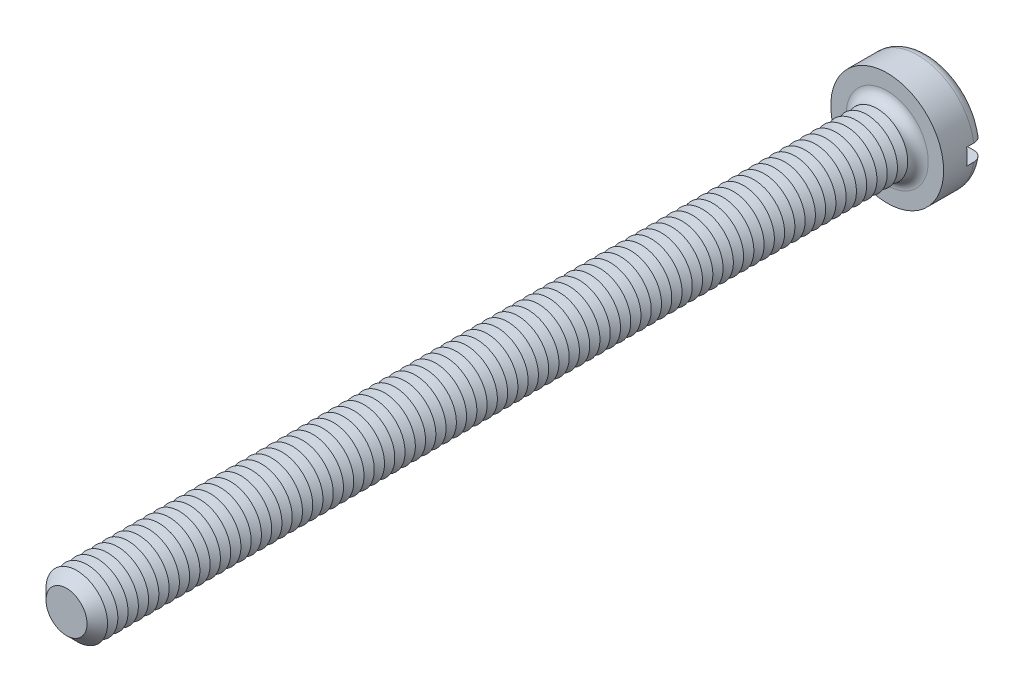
ISO-10303-21;
HEADER;
FILE_DESCRIPTION(('STEP AP214'),'2;1');
FILE_NAME('part.step','',(''),(''),'','','');
FILE_SCHEMA(('AUTOMOTIVE_DESIGN { 1 0 10303 214 1 1 1 1 }'));
ENDSEC;
DATA;
#1=APPLICATION_CONTEXT('core data for automotive mechanical design processes');
#2=APPLICATION_PROTOCOL_DEFINITION('international standard','automotive_design',2000,#1);
#3=PRODUCT_CONTEXT('',#1,'mechanical');
#4=PRODUCT('Part','Part','',(#3));
#5=PRODUCT_RELATED_PRODUCT_CATEGORY('part','',(#4));
#6=PRODUCT_DEFINITION_FORMATION('','',#4);
#7=PRODUCT_DEFINITION_CONTEXT('part definition',#1,'design');
#8=PRODUCT_DEFINITION('design','',#6,#7);
#9=PRODUCT_DEFINITION_SHAPE('','',#8);
#10=(LENGTH_UNIT() NAMED_UNIT(*) SI_UNIT(.MILLI.,.METRE.));
#11=(NAMED_UNIT(*) PLANE_ANGLE_UNIT() SI_UNIT($,.RADIAN.));
#12=(NAMED_UNIT(*) SI_UNIT($,.STERADIAN.) SOLID_ANGLE_UNIT());
#13=UNCERTAINTY_MEASURE_WITH_UNIT(LENGTH_MEASURE(1.E-05),#10,'distance_accuracy_value','');
#14=(GEOMETRIC_REPRESENTATION_CONTEXT(3) GLOBAL_UNCERTAINTY_ASSIGNED_CONTEXT((#13)) GLOBAL_UNIT_ASSIGNED_CONTEXT((#10,
#11,#12)) REPRESENTATION_CONTEXT('',''));
#15=CARTESIAN_POINT('',(0.,0.,0.));
#16=DIRECTION('',(0.,0.,1.));
#17=DIRECTION('',(1.,0.,0.));
#18=AXIS2_PLACEMENT_3D('',#15,#16,#17);
#19=CARTESIAN_POINT('',(0.,0.,-2.));
#20=DIRECTION('',(0.,0.,1.));
#21=DIRECTION('',(1.,0.,0.));
#22=AXIS2_PLACEMENT_3D('',#19,#20,#21);
#23=PLANE('',#22);
#24=CARTESIAN_POINT('',(0.,0.,-2.));
#25=DIRECTION('',(0.,0.,1.));
#26=DIRECTION('',(1.,0.,0.));
#27=AXIS2_PLACEMENT_3D('',#24,#25,#26);
#28=CIRCLE('',#27,2.25);
#29=CARTESIAN_POINT('',(-2.21415898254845,0.4,-2.));
#30=VERTEX_POINT('',#29);
#31=CARTESIAN_POINT('',(2.21415898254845,0.4,-2.));
#32=VERTEX_POINT('',#31);
#33=EDGE_CURVE('E116',#30,#32,#28,.F.);
#34=ORIENTED_EDGE('',*,*,#33,.T.);
#35=DIRECTION('',(1.,0.,0.));
#36=VECTOR('',#35,1.);
#37=CARTESIAN_POINT('',(-2.75,0.400000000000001,-2.));
#38=LINE('',#37,#36);
#39=EDGE_CURVE('E111',#30,#32,#38,.T.);
#40=ORIENTED_EDGE('',*,*,#39,.F.);
#41=EDGE_LOOP('',(#34,#40));
#42=FACE_BOUND('',#41,.T.);
#43=ADVANCED_FACE('F39',(#42),#23,.F.);
#44=CARTESIAN_POINT('',(0.,0.,-1.5));
#45=DIRECTION('',(0.,0.,1.));
#46=DIRECTION('',(1.,0.,0.));
#47=AXIS2_PLACEMENT_3D('',#44,#45,#46);
#48=TOROIDAL_SURFACE('',#47,2.25,0.5);
#49=CARTESIAN_POINT('',(-2.6296588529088,0.400000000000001,-1.78631483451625));
#50=CARTESIAN_POINT('',(-2.61332846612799,0.400000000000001,-1.80942627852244));
#51=CARTESIAN_POINT('',(-2.59501593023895,0.400000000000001,-1.83116426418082));
#52=CARTESIAN_POINT('',(-2.55497423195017,0.400000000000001,-1.87126271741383));
#53=CARTESIAN_POINT('',(-2.53324055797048,0.4,-1.88961865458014));
#54=CARTESIAN_POINT('',(-2.48702796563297,0.4,-1.92241505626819));
#55=CARTESIAN_POINT('',(-2.46255183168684,0.4,-1.93685944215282));
#56=CARTESIAN_POINT('',(-2.41154731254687,0.4,-1.96147315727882));
#57=CARTESIAN_POINT('',(-2.38501943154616,0.4,-1.97164353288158));
#58=CARTESIAN_POINT('',(-2.3303912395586,0.4,-1.98753780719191));
#59=CARTESIAN_POINT('',(-2.30227842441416,0.4,-1.99321871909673));
#60=CARTESIAN_POINT('',(-2.24549884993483,0.4,-1.99984170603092));
#61=CARTESIAN_POINT('',(-2.21683202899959,0.4,-2.00078325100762));
#62=CARTESIAN_POINT('',(-2.15939326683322,0.4,-1.99790249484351));
#63=CARTESIAN_POINT('',(-2.13062419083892,0.4,-1.99402290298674));
#64=CARTESIAN_POINT('',(-2.07413526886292,0.4,-1.98151915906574));
#65=CARTESIAN_POINT('',(-2.04641547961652,0.4,-1.97289475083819));
#66=CARTESIAN_POINT('',(-1.99264697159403,0.4,-1.95107177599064));
#67=CARTESIAN_POINT('',(-1.96660904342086,0.4,-1.93784659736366));
#68=CARTESIAN_POINT('',(-1.91713954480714,0.4,-1.90718730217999));
#69=CARTESIAN_POINT('',(-1.89370795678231,0.4,-1.88975321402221));
#70=CARTESIAN_POINT('',(-1.85029144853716,0.4,-1.85126548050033));
#71=CARTESIAN_POINT('',(-1.83028607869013,0.4,-1.83023492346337));
#72=CARTESIAN_POINT('',(-1.79417432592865,0.4,-1.78505552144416));
#73=CARTESIAN_POINT('',(-1.77806752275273,0.4,-1.76090701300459));
#74=CARTESIAN_POINT('',(-1.75056079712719,0.4,-1.71067721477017));
#75=CARTESIAN_POINT('',(-1.7390748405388,0.4,-1.68464306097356));
#76=CARTESIAN_POINT('',(-1.72075680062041,0.4,-1.63098625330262));
#77=CARTESIAN_POINT('',(-1.71392397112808,0.4,-1.60336385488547));
#78=CARTESIAN_POINT('',(-1.70525661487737,0.4,-1.54801066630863));
#79=CARTESIAN_POINT('',(-1.70330866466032,0.4,-1.52029759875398));
#80=CARTESIAN_POINT('',(-1.70414820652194,0.4,-1.46494458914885));
#81=CARTESIAN_POINT('',(-1.70693532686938,0.4,-1.43730464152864));
#82=CARTESIAN_POINT('',(-1.71709335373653,0.4,-1.38318389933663));
#83=CARTESIAN_POINT('',(-1.72441580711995,0.4,-1.35669397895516));
#84=CARTESIAN_POINT('',(-1.74335830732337,0.4,-1.30529964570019));
#85=CARTESIAN_POINT('',(-1.75497853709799,0.4,-1.2803953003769));
#86=CARTESIAN_POINT('',(-1.78229453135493,0.4,-1.23258298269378));
#87=CARTESIAN_POINT('',(-1.79803217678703,0.4,-1.20969896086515));
#88=CARTESIAN_POINT('',(-1.83304498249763,0.4,-1.16682064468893));
#89=CARTESIAN_POINT('',(-1.85232054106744,0.4,-1.1468266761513));
#90=CARTESIAN_POINT('',(-1.89433695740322,0.4,-1.10980713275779));
#91=CARTESIAN_POINT('',(-1.91714740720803,0.4,-1.09286053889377));
#92=CARTESIAN_POINT('',(-1.96524407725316,0.4,-1.06294809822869));
#93=CARTESIAN_POINT('',(-1.99053056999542,0.4,-1.04998269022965));
#94=CARTESIAN_POINT('',(-2.04340612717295,0.4,-1.02814800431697));
#95=CARTESIAN_POINT('',(-2.07103098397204,0.4,-1.01936532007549));
#96=CARTESIAN_POINT('',(-2.12735840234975,0.4,-1.00652373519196));
#97=CARTESIAN_POINT('',(-2.15606102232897,0.4,-1.00246509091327));
#98=CARTESIAN_POINT('',(-2.21395379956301,0.4,-0.999181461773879));
#99=CARTESIAN_POINT('',(-2.24314598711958,0.4,-0.999992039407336));
#100=CARTESIAN_POINT('',(-2.30097585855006,0.4,-1.00652779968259));
#101=CARTESIAN_POINT('',(-2.32961355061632,0.4,-1.01225290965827));
#102=CARTESIAN_POINT('',(-2.38536238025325,0.4,-1.02843951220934));
#103=CARTESIAN_POINT('',(-2.41248047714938,0.4,-1.03887701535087));
#104=CARTESIAN_POINT('',(-2.46454860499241,0.4,-1.06421009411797));
#105=CARTESIAN_POINT('',(-2.48949875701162,0.4,-1.0791054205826));
#106=CARTESIAN_POINT('',(-2.53620471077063,0.4,-1.11274531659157));
#107=CARTESIAN_POINT('',(-2.55799482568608,0.400000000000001,-1.1314422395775));
#108=CARTESIAN_POINT('',(-2.59807595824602,0.400000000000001,-1.17227176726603));
#109=CARTESIAN_POINT('',(-2.6163672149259,0.400000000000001,-1.19440413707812));
#110=CARTESIAN_POINT('',(-2.64868581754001,0.400000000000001,-1.24117072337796));
#111=CARTESIAN_POINT('',(-2.66276466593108,0.400000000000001,-1.26576935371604));
#112=CARTESIAN_POINT('',(-2.68654482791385,0.400000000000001,-1.31699754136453));
#113=CARTESIAN_POINT('',(-2.69624657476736,0.400000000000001,-1.34362689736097));
#114=CARTESIAN_POINT('',(-2.71090527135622,0.400000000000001,-1.39787706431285));
#115=CARTESIAN_POINT('',(-2.71590826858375,0.400000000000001,-1.4254854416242));
#116=CARTESIAN_POINT('',(-2.72118463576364,0.400000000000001,-1.48115803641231));
#117=CARTESIAN_POINT('',(-2.72145696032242,0.400000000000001,-1.50922235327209));
#118=CARTESIAN_POINT('',(-2.71727180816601,0.400000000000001,-1.56487271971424));
#119=CARTESIAN_POINT('',(-2.71283440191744,0.400000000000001,-1.59246029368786));
#120=CARTESIAN_POINT('',(-2.69939521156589,0.400000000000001,-1.64647499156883));
#121=CARTESIAN_POINT('',(-2.69039909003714,0.400000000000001,-1.67290351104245));
#122=CARTESIAN_POINT('',(-2.67251693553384,0.400000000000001,-1.71382731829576));
#123=CARTESIAN_POINT('',(-2.66497994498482,0.400000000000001,-1.72892686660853));
#124=CARTESIAN_POINT('',(-2.64841616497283,0.400000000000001,-1.75828509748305));
#125=CARTESIAN_POINT('',(-2.63938938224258,0.400000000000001,-1.77254378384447));
#126=CARTESIAN_POINT('',(-2.6296588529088,0.400000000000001,-1.78631483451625));
#127=B_SPLINE_CURVE_WITH_KNOTS('',3,(#49,#50,#51,#52,#53,#54,#55,#56,#57,#58,#59,#60,#61,#62,
#63,#64,#65,#66,#67,#68,#69,#70,#71,#72,#73,#74,#75,#76,#77,#78,#79,#80,#81,#82,#83,#84,#85,#86,
#87,#88,#89,#90,#91,#92,#93,#94,#95,#96,#97,#98,#99,#100,#101,#102,#103,#104,#105,#106,#107,
#108,#109,#110,#111,#112,#113,#114,#115,#116,#117,#118,#119,#120,#121,#122,#123,#124,#125,#126),
.UNSPECIFIED.,.T.,.F.,(4,2,2,2,2,2,2,2,2,2,2,2,2,2,2,2,2,2,2,2,2,2,2,2,2,2,2,2,2,2,2,2,2,2,2,2,
2,2,4),(0.,0.0848338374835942,0.16978050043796,0.254641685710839,0.339482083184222,
0.42512530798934,0.510778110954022,0.597458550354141,0.684143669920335,0.771338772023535,
0.858533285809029,0.945187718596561,1.03183280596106,1.11678035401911,1.20171427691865,
1.28465703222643,1.36759327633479,1.4496584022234,1.53172702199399,1.61466526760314,
1.69761285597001,1.78247103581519,1.86733856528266,1.95389396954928,2.0404540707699,
2.12764713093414,2.21483890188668,2.30159172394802,2.38833969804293,2.4740609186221,
2.55977628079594,2.6443962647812,2.72900787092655,2.81278135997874,2.89657336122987,
2.98000971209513,3.06334267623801,3.113891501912,3.16444009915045),.UNSPECIFIED.);
#128=CARTESIAN_POINT('',(-2.72075357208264,0.400000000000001,-1.50000000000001));
#129=VERTEX_POINT('',#128);
#130=EDGE_CURVE('E803',#129,#30,#127,.T.);
#131=ORIENTED_EDGE('',*,*,#130,.F.);
#132=CARTESIAN_POINT('',(0.,0.,-1.5));
#133=DIRECTION('',(0.,0.,1.));
#134=DIRECTION('',(1.,0.,0.));
#135=AXIS2_PLACEMENT_3D('',#132,#133,#134);
#136=CIRCLE('',#135,2.75);
#137=CARTESIAN_POINT('',(2.7207535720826,0.4,-1.5));
#138=VERTEX_POINT('',#137);
#139=EDGE_CURVE('E125',#138,#129,#136,.T.);
#140=ORIENTED_EDGE('',*,*,#139,.F.);
#141=CARTESIAN_POINT('',(1.7362507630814,0.4,-1.6752840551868));
#142=CARTESIAN_POINT('',(1.74636083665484,0.4,-1.70159961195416));
#143=CARTESIAN_POINT('',(1.7587429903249,0.4,-1.72706707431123));
#144=CARTESIAN_POINT('',(1.78764414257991,0.4,-1.77556609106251));
#145=CARTESIAN_POINT('',(1.80416918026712,0.4,-1.79859401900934));
#146=CARTESIAN_POINT('',(1.84080454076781,0.4,-1.84153587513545));
#147=CARTESIAN_POINT('',(1.86090949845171,0.4,-1.86145438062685));
#148=CARTESIAN_POINT('',(1.9041208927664,0.4,-1.89769607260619));
#149=CARTESIAN_POINT('',(1.92722659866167,0.4,-1.91402013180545));
#150=CARTESIAN_POINT('',(1.97620958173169,0.4,-1.94291288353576));
#151=CARTESIAN_POINT('',(2.00212726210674,0.4,-1.95541309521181));
#152=CARTESIAN_POINT('',(2.05567603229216,0.4,-1.97595143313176));
#153=CARTESIAN_POINT('',(2.08330733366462,0.4,-1.98398900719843));
#154=CARTESIAN_POINT('',(2.13989163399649,0.4,-1.99545904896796));
#155=CARTESIAN_POINT('',(2.16885726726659,0.4,-1.99882930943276));
#156=CARTESIAN_POINT('',(2.22694412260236,0.4,-2.00065872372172));
#157=CARTESIAN_POINT('',(2.25606534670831,0.4,-1.99911781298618));
#158=CARTESIAN_POINT('',(2.31362436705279,0.4,-1.99114818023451));
#159=CARTESIAN_POINT('',(2.34206235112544,0.4,-1.98472081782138));
#160=CARTESIAN_POINT('',(2.39743709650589,0.4,-1.96713601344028));
#161=CARTESIAN_POINT('',(2.42437392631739,0.4,-1.95597878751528));
#162=CARTESIAN_POINT('',(2.47569769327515,0.4,-1.92935960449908));
#163=CARTESIAN_POINT('',(2.50010686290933,0.4,-1.91394052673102));
#164=CARTESIAN_POINT('',(2.54594525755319,0.4,-1.8791725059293));
#165=CARTESIAN_POINT('',(2.56737468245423,0.4,-1.85982382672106));
#166=CARTESIAN_POINT('',(2.60634898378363,0.4,-1.81801641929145));
#167=CARTESIAN_POINT('',(2.6239407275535,0.4,-1.79560138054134));
#168=CARTESIAN_POINT('',(2.65505953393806,0.4,-1.7481077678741));
#169=CARTESIAN_POINT('',(2.66858686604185,0.4,-1.72302937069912));
#170=CARTESIAN_POINT('',(2.69103536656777,0.4,-1.67123055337));
#171=CARTESIAN_POINT('',(2.70000740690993,0.4,-1.64453217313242));
#172=CARTESIAN_POINT('',(2.71330608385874,0.4,-1.59000262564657));
#173=CARTESIAN_POINT('',(2.71763293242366,0.4,-1.5621715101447));
#174=CARTESIAN_POINT('',(2.72149675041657,0.4,-1.50637655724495));
#175=CARTESIAN_POINT('',(2.72106725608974,0.4,-1.47841503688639));
#176=CARTESIAN_POINT('',(2.7155123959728,0.4,-1.42296287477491));
#177=CARTESIAN_POINT('',(2.71038711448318,0.4,-1.39547222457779));
#178=CARTESIAN_POINT('',(2.69560462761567,0.4,-1.34178071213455));
#179=CARTESIAN_POINT('',(2.68595389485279,0.4,-1.31557806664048));
#180=CARTESIAN_POINT('',(2.66240876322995,0.4,-1.26515516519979));
#181=CARTESIAN_POINT('',(2.64851431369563,0.4,-1.24093493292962));
#182=CARTESIAN_POINT('',(2.61681930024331,0.4,-1.19504594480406));
#183=CARTESIAN_POINT('',(2.59900198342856,0.4,-1.17338876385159));
#184=CARTESIAN_POINT('',(2.56001495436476,0.4,-1.13333899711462));
#185=CARTESIAN_POINT('',(2.53884510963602,0.4,-1.11494654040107));
#186=CARTESIAN_POINT('',(2.49354554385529,0.4,-1.08175888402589));
#187=CARTESIAN_POINT('',(2.46938991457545,0.4,-1.06699905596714));
#188=CARTESIAN_POINT('',(2.41896725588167,0.4,-1.04168682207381));
#189=CARTESIAN_POINT('',(2.39270009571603,0.4,-1.03113467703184));
#190=CARTESIAN_POINT('',(2.33844927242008,0.4,-1.01439607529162));
#191=CARTESIAN_POINT('',(2.31044823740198,0.4,-1.00826592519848));
#192=CARTESIAN_POINT('',(2.25381752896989,0.4,-1.00073183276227));
#193=CARTESIAN_POINT('',(2.22518781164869,0.4,-0.999328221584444));
#194=CARTESIAN_POINT('',(2.16774231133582,0.4,-1.00127811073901));
#195=CARTESIAN_POINT('',(2.13892848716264,0.4,-1.00468955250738));
#196=CARTESIAN_POINT('',(2.08227193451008,0.4,-1.01626887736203));
#197=CARTESIAN_POINT('',(2.05442926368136,0.4,-1.02443704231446));
#198=CARTESIAN_POINT('',(2.00032604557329,0.4,-1.04537295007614));
#199=CARTESIAN_POINT('',(1.97407661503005,0.4,-1.05816944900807));
#200=CARTESIAN_POINT('',(1.92411255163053,0.4,-1.08801035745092));
#201=CARTESIAN_POINT('',(1.90039792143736,0.4,-1.10505477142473));
#202=CARTESIAN_POINT('',(1.85633574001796,0.4,-1.14282887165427));
#203=CARTESIAN_POINT('',(1.83597040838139,0.4,-1.16353779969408));
#204=CARTESIAN_POINT('',(1.79908731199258,0.4,-1.20813793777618));
#205=CARTESIAN_POINT('',(1.78256899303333,0.4,-1.23202868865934));
#206=CARTESIAN_POINT('',(1.75420022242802,0.4,-1.28183173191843));
#207=CARTESIAN_POINT('',(1.74226635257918,0.4,-1.30769648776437));
#208=CARTESIAN_POINT('',(1.72302798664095,0.4,-1.36110211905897));
#209=CARTESIAN_POINT('',(1.71572395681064,0.4,-1.38864316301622));
#210=CARTESIAN_POINT('',(1.70611974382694,0.4,-1.44392326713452));
#211=CARTESIAN_POINT('',(1.70370764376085,0.4,-1.47164298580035));
#212=CARTESIAN_POINT('',(1.70363822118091,0.4,-1.52706336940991));
#213=CARTESIAN_POINT('',(1.70597448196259,0.4,-1.55476400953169));
#214=CARTESIAN_POINT('',(1.71335146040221,0.4,-1.59796127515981));
#215=CARTESIAN_POINT('',(1.71686033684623,0.4,-1.61373520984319));
#216=CARTESIAN_POINT('',(1.7254146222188,0.4,-1.64486018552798));
#217=CARTESIAN_POINT('',(1.73045999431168,0.4,-1.66021123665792));
#218=CARTESIAN_POINT('',(1.7362507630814,0.4,-1.6752840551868));
#219=B_SPLINE_CURVE_WITH_KNOTS('',3,(#141,#142,#143,#144,#145,#146,#147,#148,#149,#150,#151,
#152,#153,#154,#155,#156,#157,#158,#159,#160,#161,#162,#163,#164,#165,#166,#167,#168,#169,#170,
#171,#172,#173,#174,#175,#176,#177,#178,#179,#180,#181,#182,#183,#184,#185,#186,#187,#188,#189,
#190,#191,#192,#193,#194,#195,#196,#197,#198,#199,#200,#201,#202,#203,#204,#205,#206,#207,#208,
#209,#210,#211,#212,#213,#214,#215,#216,#217,#218),.UNSPECIFIED.,.T.,.F.,(4,2,2,2,2,2,2,2,2,2,2,
2,2,2,2,2,2,2,2,2,2,2,2,2,2,2,2,2,2,2,2,2,2,2,2,2,2,2,4),(0.,0.0845117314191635,
0.169147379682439,0.253657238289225,0.338146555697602,0.424070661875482,0.510005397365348,
0.597074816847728,0.684145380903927,0.771191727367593,0.858234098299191,0.94443074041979,
1.03062159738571,1.11569223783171,1.20075723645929,1.28485012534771,1.36893917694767,
1.45243570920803,1.53593074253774,1.61930671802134,1.70268368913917,1.7864238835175,
1.87016738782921,1.95469664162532,2.03923113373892,2.12482389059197,2.21042264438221,
2.29706026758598,2.38370302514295,2.47089361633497,2.55808429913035,2.64479602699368,
2.73149525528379,2.81653234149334,2.9015779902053,2.98465497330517,3.06761976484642,
3.11602689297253,3.164432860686),.UNSPECIFIED.);
#220=EDGE_CURVE('E805',#32,#138,#219,.T.);
#221=ORIENTED_EDGE('',*,*,#220,.F.);
#222=ORIENTED_EDGE('',*,*,#33,.F.);
#223=EDGE_LOOP('',(#131,#140,#221,#222));
#224=FACE_BOUND('',#223,.T.);
#225=ADVANCED_FACE('F787',(#224),#48,.T.);
#226=CARTESIAN_POINT('',(0.,0.,-2.));
#227=DIRECTION('',(0.,0.,1.));
#228=DIRECTION('',(1.,0.,0.));
#229=AXIS2_PLACEMENT_3D('',#226,#227,#228);
#230=CYLINDRICAL_SURFACE('',#229,2.75);
#231=DIRECTION('',(0.,0.,1.));
#232=VECTOR('',#231,1.);
#233=CARTESIAN_POINT('',(2.72075357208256,0.4,-2.));
#234=LINE('',#233,#232);
#235=CARTESIAN_POINT('',(2.72075357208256,0.4,-1.15));
#236=VERTEX_POINT('',#235);
#237=EDGE_CURVE('E820',#138,#236,#234,.T.);
#238=ORIENTED_EDGE('',*,*,#237,.F.);
#239=ORIENTED_EDGE('',*,*,#139,.T.);
#240=DIRECTION('',(0.,0.,1.));
#241=VECTOR('',#240,1.);
#242=CARTESIAN_POINT('',(-2.72075357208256,0.4,-2.));
#243=LINE('',#242,#241);
#244=CARTESIAN_POINT('',(-2.72075357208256,0.4,-1.15));
#245=VERTEX_POINT('',#244);
#246=EDGE_CURVE('E63',#245,#129,#243,.F.);
#247=ORIENTED_EDGE('',*,*,#246,.F.);
#248=CARTESIAN_POINT('',(0.,0.,-1.15));
#249=DIRECTION('',(0.,0.,-1.));
#250=DIRECTION('',(-1.,0.,0.));
#251=AXIS2_PLACEMENT_3D('',#248,#249,#250);
#252=CIRCLE('',#251,2.75);
#253=CARTESIAN_POINT('',(-2.72075357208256,-0.4,-1.15));
#254=VERTEX_POINT('',#253);
#255=EDGE_CURVE('E43',#245,#254,#252,.F.);
#256=ORIENTED_EDGE('',*,*,#255,.T.);
#257=DIRECTION('',(0.,0.,1.));
#258=VECTOR('',#257,1.);
#259=CARTESIAN_POINT('',(-2.72075357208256,-0.4,-2.));
#260=LINE('',#259,#258);
#261=CARTESIAN_POINT('',(-2.72075357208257,-0.4,-1.5));
#262=VERTEX_POINT('',#261);
#263=EDGE_CURVE('E817',#262,#254,#260,.T.);
#264=ORIENTED_EDGE('',*,*,#263,.F.);
#265=CARTESIAN_POINT('',(2.72075357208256,-0.4,-1.5));
#266=VERTEX_POINT('',#265);
#267=EDGE_CURVE('E127',#262,#266,#136,.T.);
#268=ORIENTED_EDGE('',*,*,#267,.T.);
#269=DIRECTION('',(0.,0.,1.));
#270=VECTOR('',#269,1.);
#271=CARTESIAN_POINT('',(2.72075357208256,-0.4,-2.));
#272=LINE('',#271,#270);
#273=CARTESIAN_POINT('',(2.72075357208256,-0.4,-1.15));
#274=VERTEX_POINT('',#273);
#275=EDGE_CURVE('E55',#274,#266,#272,.F.);
#276=ORIENTED_EDGE('',*,*,#275,.F.);
#277=EDGE_CURVE('E11',#274,#236,#252,.F.);
#278=ORIENTED_EDGE('',*,*,#277,.T.);
#279=EDGE_LOOP('',(#238,#239,#247,#256,#264,#268,#276,#278));
#280=FACE_BOUND('',#279,.T.);
#281=CARTESIAN_POINT('',(0.,0.,0.));
#282=DIRECTION('',(0.,0.,1.));
#283=DIRECTION('',(1.,0.,0.));
#284=AXIS2_PLACEMENT_3D('',#281,#282,#283);
#285=CIRCLE('',#284,2.75);
#286=CARTESIAN_POINT('',(2.75,0.,0.));
#287=VERTEX_POINT('',#286);
#288=EDGE_CURVE('E823',#287,#287,#285,.T.);
#289=ORIENTED_EDGE('',*,*,#288,.F.);
#290=EDGE_LOOP('',(#289));
#291=FACE_BOUND('',#290,.T.);
#292=ADVANCED_FACE('F783',(#280,#291),#230,.T.);
#293=CARTESIAN_POINT('',(2.21415898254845,-0.4,-2.));
#294=VERTEX_POINT('',#293);
#295=CARTESIAN_POINT('',(-2.21415898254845,-0.4,-2.));
#296=VERTEX_POINT('',#295);
#297=EDGE_CURVE('E109',#294,#296,#28,.F.);
#298=ORIENTED_EDGE('',*,*,#297,.T.);
#299=DIRECTION('',(-1.,0.,0.));
#300=VECTOR('',#299,1.);
#301=CARTESIAN_POINT('',(-2.75,-0.4,-2.));
#302=LINE('',#301,#300);
#303=EDGE_CURVE('E96',#294,#296,#302,.T.);
#304=ORIENTED_EDGE('',*,*,#303,.F.);
#305=EDGE_LOOP('',(#298,#304));
#306=FACE_BOUND('',#305,.T.);
#307=ADVANCED_FACE('F108',(#306),#23,.F.);
#308=CARTESIAN_POINT('',(0.,0.,0.));
#309=DIRECTION('',(0.,0.,1.));
#310=DIRECTION('',(1.,0.,0.));
#311=AXIS2_PLACEMENT_3D('',#308,#309,#310);
#312=PLANE('',#311);
#313=CARTESIAN_POINT('',(0.,0.,0.));
#314=DIRECTION('',(0.,0.,1.));
#315=DIRECTION('',(1.,0.,0.));
#316=AXIS2_PLACEMENT_3D('',#313,#314,#315);
#317=CIRCLE('',#316,2.);
#318=CARTESIAN_POINT('',(2.,0.,0.));
#319=VERTEX_POINT('',#318);
#320=EDGE_CURVE('E115',#319,#319,#317,.F.);
#321=ORIENTED_EDGE('',*,*,#320,.T.);
#322=EDGE_LOOP('',(#321));
#323=FACE_BOUND('',#322,.T.);
#324=ORIENTED_EDGE('',*,*,#288,.T.);
#325=EDGE_LOOP('',(#324));
#326=FACE_BOUND('',#325,.T.);
#327=ADVANCED_FACE('F782',(#323,#326),#312,.T.);
#328=CARTESIAN_POINT('',(-2.6296588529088,-0.4,-1.78631483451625));
#329=CARTESIAN_POINT('',(-2.64575286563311,-0.4,-1.76353353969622));
#330=CARTESIAN_POINT('',(-2.65994473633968,-0.4,-1.73938506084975));
#331=CARTESIAN_POINT('',(-2.68408879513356,-0.4,-1.68903091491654));
#332=CARTESIAN_POINT('',(-2.69403633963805,-0.4,-1.6628230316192));
#333=CARTESIAN_POINT('',(-2.70937899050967,-0.4,-1.60911025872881));
#334=CARTESIAN_POINT('',(-2.71477511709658,-0.4,-1.5816056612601));
#335=CARTESIAN_POINT('',(-2.72085365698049,-0.4,-1.52608718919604));
#336=CARTESIAN_POINT('',(-2.7215371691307,-0.4,-1.49807343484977));
#337=CARTESIAN_POINT('',(-2.71817903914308,-0.4,-1.44242333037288));
#338=CARTESIAN_POINT('',(-2.71415291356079,-0.4,-1.41478604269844));
#339=CARTESIAN_POINT('',(-2.70152104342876,-0.4,-1.36057835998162));
#340=CARTESIAN_POINT('',(-2.69291517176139,-0.4,-1.33400799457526));
#341=CARTESIAN_POINT('',(-2.67137052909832,-0.4,-1.28266198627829));
#342=CARTESIAN_POINT('',(-2.65842829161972,-0.4,-1.25788779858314));
#343=CARTESIAN_POINT('',(-2.62859348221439,-0.4,-1.21084577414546));
#344=CARTESIAN_POINT('',(-2.61170082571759,-0.4,-1.18857799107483));
#345=CARTESIAN_POINT('',(-2.5743351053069,-0.4,-1.1470221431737));
#346=CARTESIAN_POINT('',(-2.55383974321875,-0.4,-1.12775413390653));
#347=CARTESIAN_POINT('',(-2.5099353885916,-0.4,-1.09288845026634));
#348=CARTESIAN_POINT('',(-2.48652625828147,-0.4,-1.07729094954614));
#349=CARTESIAN_POINT('',(-2.43718903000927,-0.4,-1.0500239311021));
#350=CARTESIAN_POINT('',(-2.41123629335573,-0.4,-1.0383990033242));
#351=CARTESIAN_POINT('',(-2.35776417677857,-0.4,-1.01960886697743));
#352=CARTESIAN_POINT('',(-2.33024469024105,-0.4,-1.01244396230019));
#353=CARTESIAN_POINT('',(-2.27404134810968,-0.4,-1.00268156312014));
#354=CARTESIAN_POINT('',(-2.24534705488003,-0.4,-1.00014414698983));
#355=CARTESIAN_POINT('',(-2.18793513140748,-0.4,-0.999867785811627));
#356=CARTESIAN_POINT('',(-2.15921749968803,-0.4,-1.00212917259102));
#357=CARTESIAN_POINT('',(-2.10225052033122,-0.4,-1.01142552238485));
#358=CARTESIAN_POINT('',(-2.07400941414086,-0.4,-1.01851105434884));
#359=CARTESIAN_POINT('',(-2.01911044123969,-0.4,-1.03730994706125));
#360=CARTESIAN_POINT('',(-1.99245264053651,-0.4,-1.04902350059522));
#361=CARTESIAN_POINT('',(-1.94142108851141,-0.4,-1.07679847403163));
#362=CARTESIAN_POINT('',(-1.91705303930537,-0.4,-1.09287038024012));
#363=CARTESIAN_POINT('',(-1.87139758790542,-0.4,-1.12891897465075));
#364=CARTESIAN_POINT('',(-1.85011007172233,-0.4,-1.14889551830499));
#365=CARTESIAN_POINT('',(-1.81149058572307,-0.4,-1.19196940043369));
#366=CARTESIAN_POINT('',(-1.79411779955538,-0.4,-1.21503011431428));
#367=CARTESIAN_POINT('',(-1.76359546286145,-0.4,-1.26379588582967));
#368=CARTESIAN_POINT('',(-1.75044532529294,-0.4,-1.28950057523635));
#369=CARTESIAN_POINT('',(-1.72906221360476,-0.4,-1.3422057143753));
#370=CARTESIAN_POINT('',(-1.72072512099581,-0.4,-1.3691639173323));
#371=CARTESIAN_POINT('',(-1.70880448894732,-0.4,-1.42411084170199));
#372=CARTESIAN_POINT('',(-1.7052202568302,-0.4,-1.45209941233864));
#373=CARTESIAN_POINT('',(-1.70295553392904,-0.4,-1.50768522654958));
#374=CARTESIAN_POINT('',(-1.70417398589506,-0.4,-1.53527840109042));
#375=CARTESIAN_POINT('',(-1.71124536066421,-0.4,-1.58986292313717));
#376=CARTESIAN_POINT('',(-1.71709811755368,-0.4,-1.61685429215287));
#377=CARTESIAN_POINT('',(-1.73321132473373,-0.4,-1.66938107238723));
#378=CARTESIAN_POINT('',(-1.74345625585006,-0.4,-1.69492125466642));
#379=CARTESIAN_POINT('',(-1.76802111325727,-0.4,-1.74395877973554));
#380=CARTESIAN_POINT('',(-1.78234133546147,-0.4,-1.76745597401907));
#381=CARTESIAN_POINT('',(-1.81488631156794,-0.4,-1.81216193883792));
#382=CARTESIAN_POINT('',(-1.83317116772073,-0.4,-1.83332693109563));
#383=CARTESIAN_POINT('',(-1.87296030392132,-0.4,-1.872375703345));
#384=CARTESIAN_POINT('',(-1.89446497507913,-0.4,-1.89025908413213));
#385=CARTESIAN_POINT('',(-1.94063077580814,-0.4,-1.92267732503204));
#386=CARTESIAN_POINT('',(-1.96535444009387,-0.4,-1.93712316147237));
#387=CARTESIAN_POINT('',(-2.01684705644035,-0.4,-1.96173690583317));
#388=CARTESIAN_POINT('',(-2.04361620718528,-0.4,-1.97190439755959));
#389=CARTESIAN_POINT('',(-2.09891021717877,-0.4,-1.9878230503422));
#390=CARTESIAN_POINT('',(-2.12745653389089,-0.4,-1.99349978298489));
#391=CARTESIAN_POINT('',(-2.18509639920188,-0.4,-1.99999556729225));
#392=CARTESIAN_POINT('',(-2.21418994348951,-0.4,-2.00081465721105));
#393=CARTESIAN_POINT('',(-2.27218032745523,-0.4,-1.99755156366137));
#394=CARTESIAN_POINT('',(-2.30107643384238,-0.4,-1.99345627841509));
#395=CARTESIAN_POINT('',(-2.35776697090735,-0.4,-1.98043125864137));
#396=CARTESIAN_POINT('',(-2.38556116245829,-0.4,-1.97150048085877));
#397=CARTESIAN_POINT('',(-2.43901832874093,-0.4,-1.94912081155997));
#398=CARTESIAN_POINT('',(-2.46469578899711,-0.4,-1.93570648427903));
#399=CARTESIAN_POINT('',(-2.51337022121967,-0.4,-1.90471183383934));
#400=CARTESIAN_POINT('',(-2.53637056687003,-0.4,-1.88713684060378));
#401=CARTESIAN_POINT('',(-2.57111030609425,-0.4,-1.85552084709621));
#402=CARTESIAN_POINT('',(-2.58386709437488,-0.4,-1.84257896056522));
#403=CARTESIAN_POINT('',(-2.60790410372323,-0.4,-1.81538935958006));
#404=CARTESIAN_POINT('',(-2.61918433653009,-0.4,-1.80114165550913));
#405=CARTESIAN_POINT('',(-2.6296588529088,-0.4,-1.78631483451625));
#406=B_SPLINE_CURVE_WITH_KNOTS('',3,(#328,#329,#330,#331,#332,#333,#334,#335,#336,#337,#338,
#339,#340,#341,#342,#343,#344,#345,#346,#347,#348,#349,#350,#351,#352,#353,#354,#355,#356,#357,
#358,#359,#360,#361,#362,#363,#364,#365,#366,#367,#368,#369,#370,#371,#372,#373,#374,#375,#376,
#377,#378,#379,#380,#381,#382,#383,#384,#385,#386,#387,#388,#389,#390,#391,#392,#393,#394,#395,
#396,#397,#398,#399,#400,#401,#402,#403,#404,#405),.UNSPECIFIED.,.T.,.F.,(4,2,2,2,2,2,2,2,2,2,2,
2,2,2,2,2,2,2,2,2,2,2,2,2,2,2,2,2,2,2,2,2,2,2,2,2,2,2,4),(0.,0.0836125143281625,
0.167316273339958,0.251001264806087,0.334666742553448,0.418057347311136,0.501450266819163,
0.584910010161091,0.668371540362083,0.752369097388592,0.836370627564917,0.921286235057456,
1.00620762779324,1.09222390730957,1.17824613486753,1.26518425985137,1.35212600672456,
1.43927882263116,1.52642841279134,1.61262232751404,1.69880425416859,1.7830443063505,
1.86727208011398,1.9497371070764,2.03219918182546,2.1143722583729,2.19655130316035,
2.28007615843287,2.36361116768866,2.44911836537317,2.53463387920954,2.62153862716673,
2.70844269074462,2.79557895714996,2.88273403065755,2.96923214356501,3.05562004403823,
3.11003826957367,3.16445606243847),.UNSPECIFIED.);
#407=EDGE_CURVE('E103',#296,#262,#406,.T.);
#408=ORIENTED_EDGE('',*,*,#407,.F.);
#409=ORIENTED_EDGE('',*,*,#297,.F.);
#410=CARTESIAN_POINT('',(1.7362507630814,-0.4,-1.6752840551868));
#411=CARTESIAN_POINT('',(1.72641416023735,-0.4,-1.64967314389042));
#412=CARTESIAN_POINT('',(1.71871480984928,-0.4,-1.62322216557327));
#413=CARTESIAN_POINT('',(1.70786038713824,-0.4,-1.56938399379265));
#414=CARTESIAN_POINT('',(1.70470970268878,-0.4,-1.54199592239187));
#415=CARTESIAN_POINT('',(1.70306971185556,-0.4,-1.48708393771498));
#416=CARTESIAN_POINT('',(1.70457942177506,-0.4,-1.45956005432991));
#417=CARTESIAN_POINT('',(1.71220670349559,-0.4,-1.40516538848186));
#418=CARTESIAN_POINT('',(1.71832341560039,-0.4,-1.3782944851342));
#419=CARTESIAN_POINT('',(1.73494792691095,-0.4,-1.32598312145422));
#420=CARTESIAN_POINT('',(1.74545076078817,-0.4,-1.30054108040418));
#421=CARTESIAN_POINT('',(1.77051013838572,-0.4,-1.25173932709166));
#422=CARTESIAN_POINT('',(1.7850670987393,-0.4,-1.22837982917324));
#423=CARTESIAN_POINT('',(1.81806903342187,-0.4,-1.1839775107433));
#424=CARTESIAN_POINT('',(1.8365752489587,-0.4,-1.16298023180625));
#425=CARTESIAN_POINT('',(1.87677669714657,-0.4,-1.1243010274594));
#426=CARTESIAN_POINT('',(1.89847230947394,-0.4,-1.10661949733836));
#427=CARTESIAN_POINT('',(1.94498854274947,-0.4,-1.07463966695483));
#428=CARTESIAN_POINT('',(1.96987078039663,-0.4,-1.06043095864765));
#429=CARTESIAN_POINT('',(2.02163980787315,-0.4,-1.0363161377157));
#430=CARTESIAN_POINT('',(2.04852678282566,-0.4,-1.02641042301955));
#431=CARTESIAN_POINT('',(2.10400319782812,-0.4,-1.01104128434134));
#432=CARTESIAN_POINT('',(2.13261287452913,-0.4,-1.00565079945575));
#433=CARTESIAN_POINT('',(2.19033179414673,-0.4,-0.999735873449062));
#434=CARTESIAN_POINT('',(2.2194410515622,-0.4,-0.999211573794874));
#435=CARTESIAN_POINT('',(2.27740442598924,-0.4,-1.00306591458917));
#436=CARTESIAN_POINT('',(2.30625777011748,-0.4,-1.00745623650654));
#437=CARTESIAN_POINT('',(2.36280530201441,-0.4,-1.02105937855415));
#438=CARTESIAN_POINT('',(2.39049952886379,-0.4,-1.03027203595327));
#439=CARTESIAN_POINT('',(2.44369359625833,-0.4,-1.05318710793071));
#440=CARTESIAN_POINT('',(2.46920965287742,-0.4,-1.0668518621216));
#441=CARTESIAN_POINT('',(2.51754507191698,-0.4,-1.09832423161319));
#442=CARTESIAN_POINT('',(2.54036461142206,-0.4,-1.11613157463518));
#443=CARTESIAN_POINT('',(2.58234752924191,-0.4,-1.15513986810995));
#444=CARTESIAN_POINT('',(2.601553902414,-0.4,-1.1762945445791));
#445=CARTESIAN_POINT('',(2.63609001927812,-0.4,-1.22156192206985));
#446=CARTESIAN_POINT('',(2.65142002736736,-0.4,-1.24567442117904));
#447=CARTESIAN_POINT('',(2.67757733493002,-0.4,-1.29585881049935));
#448=CARTESIAN_POINT('',(2.68845668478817,-0.4,-1.32190357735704));
#449=CARTESIAN_POINT('',(2.7056478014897,-0.4,-1.375459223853));
#450=CARTESIAN_POINT('',(2.71195980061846,-0.4,-1.40297002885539));
#451=CARTESIAN_POINT('',(2.71979288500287,-0.4,-1.45843707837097));
#452=CARTESIAN_POINT('',(2.72135241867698,-0.4,-1.48638789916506));
#453=CARTESIAN_POINT('',(2.71974298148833,-0.4,-1.54215266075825));
#454=CARTESIAN_POINT('',(2.71657412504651,-0.4,-1.56996660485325));
#455=CARTESIAN_POINT('',(2.70561779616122,-0.4,-1.62459191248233));
#456=CARTESIAN_POINT('',(2.69784258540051,-0.4,-1.65140573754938));
#457=CARTESIAN_POINT('',(2.6779146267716,-0.4,-1.70335337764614));
#458=CARTESIAN_POINT('',(2.66576185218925,-0.4,-1.72848718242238));
#459=CARTESIAN_POINT('',(2.63739107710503,-0.4,-1.77645196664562));
#460=CARTESIAN_POINT('',(2.62116029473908,-0.4,-1.79927538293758));
#461=CARTESIAN_POINT('',(2.58512700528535,-0.4,-1.84190182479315));
#462=CARTESIAN_POINT('',(2.56532438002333,-0.4,-1.86170475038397));
#463=CARTESIAN_POINT('',(2.522535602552,-0.4,-1.89791219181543));
#464=CARTESIAN_POINT('',(2.49952399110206,-0.4,-1.91428661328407));
#465=CARTESIAN_POINT('',(2.45110500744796,-0.4,-1.94299324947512));
#466=CARTESIAN_POINT('',(2.4256974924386,-0.4,-1.95532522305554));
#467=CARTESIAN_POINT('',(2.37288090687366,-0.4,-1.97575769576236));
#468=CARTESIAN_POINT('',(2.34545135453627,-0.4,-1.98380524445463));
#469=CARTESIAN_POINT('',(2.28963821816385,-0.4,-1.99524443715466));
#470=CARTESIAN_POINT('',(2.26125456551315,-0.4,-1.99863574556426));
#471=CARTESIAN_POINT('',(2.20395671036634,-0.4,-2.00070487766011));
#472=CARTESIAN_POINT('',(2.17504033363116,-0.4,-1.99932265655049));
#473=CARTESIAN_POINT('',(2.11784130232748,-0.4,-1.9917648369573));
#474=CARTESIAN_POINT('',(2.08955866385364,-0.4,-1.98558911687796));
#475=CARTESIAN_POINT('',(2.03419451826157,-0.4,-1.96854979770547));
#476=CARTESIAN_POINT('',(2.00712437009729,-0.4,-1.95764925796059));
#477=CARTESIAN_POINT('',(1.95519572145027,-0.4,-1.93144413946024));
#478=CARTESIAN_POINT('',(1.93033780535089,-0.4,-1.91613840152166));
#479=CARTESIAN_POINT('',(1.88362525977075,-0.4,-1.88157419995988));
#480=CARTESIAN_POINT('',(1.86176428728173,-0.4,-1.86232430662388));
#481=CARTESIAN_POINT('',(1.82167218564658,-0.4,-1.82038600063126));
#482=CARTESIAN_POINT('',(1.803436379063,-0.4,-1.7977020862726));
#483=CARTESIAN_POINT('',(1.77700088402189,-0.4,-1.7582526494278));
#484=CARTESIAN_POINT('',(1.7675549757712,-0.4,-1.74230781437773));
#485=CARTESIAN_POINT('',(1.75049861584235,-0.4,-1.70946415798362));
#486=CARTESIAN_POINT('',(1.7428881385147,-0.4,-1.69256534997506));
#487=CARTESIAN_POINT('',(1.7362507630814,-0.4,-1.6752840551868));
#488=B_SPLINE_CURVE_WITH_KNOTS('',3,(#410,#411,#412,#413,#414,#415,#416,#417,#418,#419,#420,
#421,#422,#423,#424,#425,#426,#427,#428,#429,#430,#431,#432,#433,#434,#435,#436,#437,#438,#439,
#440,#441,#442,#443,#444,#445,#446,#447,#448,#449,#450,#451,#452,#453,#454,#455,#456,#457,#458,
#459,#460,#461,#462,#463,#464,#465,#466,#467,#468,#469,#470,#471,#472,#473,#474,#475,#476,#477,
#478,#479,#480,#481,#482,#483,#484,#485,#486,#487),.UNSPECIFIED.,.T.,.F.,(4,2,2,2,2,2,2,2,2,2,2,
2,2,2,2,2,2,2,2,2,2,2,2,2,2,2,2,2,2,2,2,2,2,2,2,2,2,2,4),(0.,0.0822382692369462,
0.164555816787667,0.246855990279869,0.329140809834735,0.411332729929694,0.493533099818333,
0.577115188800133,0.660707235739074,0.746270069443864,0.831840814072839,0.918768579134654,
1.00569887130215,1.09283622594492,1.17997064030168,1.26638632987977,1.35279634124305,
1.43810213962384,1.52340211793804,1.60767384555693,1.69194128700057,1.77552515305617,
1.85910699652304,1.94246734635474,2.02582820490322,2.10945367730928,2.19308191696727,
2.2774160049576,2.36175512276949,2.4471137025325,2.53247843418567,2.61892083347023,
2.70536542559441,2.79249842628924,2.87965437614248,2.96662291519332,3.05347850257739,
3.10897061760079,3.16446195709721),.UNSPECIFIED.);
#489=EDGE_CURVE('E92',#266,#294,#488,.T.);
#490=ORIENTED_EDGE('',*,*,#489,.F.);
#491=ORIENTED_EDGE('',*,*,#267,.F.);
#492=EDGE_LOOP('',(#408,#409,#490,#491));
#493=FACE_BOUND('',#492,.T.);
#494=ADVANCED_FACE('F113',(#493),#48,.T.);
#495=CARTESIAN_POINT('',(0.,0.,0.5));
#496=DIRECTION('',(0.,0.,1.));
#497=DIRECTION('',(1.,0.,0.));
#498=AXIS2_PLACEMENT_3D('',#495,#496,#497);
#499=TOROIDAL_SURFACE('',#498,2.,0.5);
#500=ORIENTED_EDGE('',*,*,#320,.F.);
#501=EDGE_LOOP('',(#500));
#502=FACE_BOUND('',#501,.T.);
#503=CARTESIAN_POINT('',(0.,0.,0.5));
#504=DIRECTION('',(0.,0.,-1.));
#505=DIRECTION('',(-1.,0.,0.));
#506=AXIS2_PLACEMENT_3D('',#503,#504,#505);
#507=CIRCLE('',#506,1.5);
#508=CARTESIAN_POINT('',(-1.5,0.,0.5));
#509=VERTEX_POINT('',#508);
#510=EDGE_CURVE('E827',#509,#509,#507,.T.);
#511=ORIENTED_EDGE('',*,*,#510,.T.);
#512=EDGE_LOOP('',(#511));
#513=FACE_BOUND('',#512,.T.);
#514=ADVANCED_FACE('F775',(#502,#513),#499,.F.);
#515=CARTESIAN_POINT('',(0.,0.,0.750000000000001));
#516=DIRECTION('',(0.,0.,-1.));
#517=DIRECTION('',(-1.,0.,0.));
#518=AXIS2_PLACEMENT_3D('',#515,#516,#517);
#519=CONICAL_SURFACE('',#518,1.06698729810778,1.0471975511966);
#520=ORIENTED_EDGE('',*,*,#510,.F.);
#521=EDGE_LOOP('',(#520));
#522=FACE_BOUND('',#521,.T.);
#523=CARTESIAN_POINT('',(0.,0.,0.750000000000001));
#524=DIRECTION('',(0.,0.,-1.));
#525=DIRECTION('',(-1.,0.,0.));
#526=AXIS2_PLACEMENT_3D('',#523,#524,#525);
#527=CIRCLE('',#526,1.06698729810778);
#528=CARTESIAN_POINT('',(-1.06698729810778,0.,0.750000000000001));
#529=VERTEX_POINT('',#528);
#530=EDGE_CURVE('E834',#529,#529,#527,.T.);
#531=ORIENTED_EDGE('',*,*,#530,.T.);
#532=EDGE_LOOP('',(#531));
#533=FACE_BOUND('',#532,.T.);
#534=ADVANCED_FACE('F771',(#522,#533),#519,.T.);
#535=CARTESIAN_POINT('',(0.,0.,1.));
#536=DIRECTION('',(0.,0.,1.));
#537=DIRECTION('',(1.,0.,0.));
#538=AXIS2_PLACEMENT_3D('',#535,#536,#537);
#539=CONICAL_SURFACE('',#538,1.5,1.0471975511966);
#540=ORIENTED_EDGE('',*,*,#530,.F.);
#541=EDGE_LOOP('',(#540));
#542=FACE_BOUND('',#541,.T.);
#543=CARTESIAN_POINT('',(0.,0.,1.));
#544=DIRECTION('',(0.,0.,-1.));
#545=DIRECTION('',(-1.,0.,0.));
#546=AXIS2_PLACEMENT_3D('',#543,#544,#545);
#547=CIRCLE('',#546,1.5);
#548=CARTESIAN_POINT('',(-1.5,0.,1.));
#549=VERTEX_POINT('',#548);
#550=EDGE_CURVE('E840',#549,#549,#547,.T.);
#551=ORIENTED_EDGE('',*,*,#550,.T.);
#552=EDGE_LOOP('',(#551));
#553=FACE_BOUND('',#552,.T.);
#554=ADVANCED_FACE('F767',(#542,#553),#539,.T.);
#555=CARTESIAN_POINT('',(0.,0.,1.25));
#556=DIRECTION('',(0.,0.,-1.));
#557=DIRECTION('',(-1.,0.,0.));
#558=AXIS2_PLACEMENT_3D('',#555,#556,#557);
#559=CONICAL_SURFACE('',#558,1.06698729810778,1.0471975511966);
#560=ORIENTED_EDGE('',*,*,#550,.F.);
#561=EDGE_LOOP('',(#560));
#562=FACE_BOUND('',#561,.T.);
#563=CARTESIAN_POINT('',(0.,0.,1.25));
#564=DIRECTION('',(0.,0.,-1.));
#565=DIRECTION('',(-1.,0.,0.));
#566=AXIS2_PLACEMENT_3D('',#563,#564,#565);
#567=CIRCLE('',#566,1.06698729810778);
#568=CARTESIAN_POINT('',(-1.06698729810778,0.,1.25));
#569=VERTEX_POINT('',#568);
#570=EDGE_CURVE('E843',#569,#569,#567,.T.);
#571=ORIENTED_EDGE('',*,*,#570,.T.);
#572=EDGE_LOOP('',(#571));
#573=FACE_BOUND('',#572,.T.);
#574=ADVANCED_FACE('F763',(#562,#573),#559,.T.);
#575=CARTESIAN_POINT('',(0.,0.,1.5));
#576=DIRECTION('',(0.,0.,1.));
#577=DIRECTION('',(1.,0.,0.));
#578=AXIS2_PLACEMENT_3D('',#575,#576,#577);
#579=CONICAL_SURFACE('',#578,1.5,1.0471975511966);
#580=ORIENTED_EDGE('',*,*,#570,.F.);
#581=EDGE_LOOP('',(#580));
#582=FACE_BOUND('',#581,.T.);
#583=CARTESIAN_POINT('',(0.,0.,1.5));
#584=DIRECTION('',(0.,0.,-1.));
#585=DIRECTION('',(-1.,0.,0.));
#586=AXIS2_PLACEMENT_3D('',#583,#584,#585);
#587=CIRCLE('',#586,1.5);
#588=CARTESIAN_POINT('',(-1.5,0.,1.5));
#589=VERTEX_POINT('',#588);
#590=EDGE_CURVE('E847',#589,#589,#587,.T.);
#591=ORIENTED_EDGE('',*,*,#590,.T.);
#592=EDGE_LOOP('',(#591));
#593=FACE_BOUND('',#592,.T.);
#594=ADVANCED_FACE('F759',(#582,#593),#579,.T.);
#595=CARTESIAN_POINT('',(0.,0.,1.75));
#596=DIRECTION('',(0.,0.,-1.));
#597=DIRECTION('',(-1.,0.,0.));
#598=AXIS2_PLACEMENT_3D('',#595,#596,#597);
#599=CONICAL_SURFACE('',#598,1.06698729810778,1.0471975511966);
#600=ORIENTED_EDGE('',*,*,#590,.F.);
#601=EDGE_LOOP('',(#600));
#602=FACE_BOUND('',#601,.T.);
#603=CARTESIAN_POINT('',(0.,0.,1.75));
#604=DIRECTION('',(0.,0.,-1.));
#605=DIRECTION('',(-1.,0.,0.));
#606=AXIS2_PLACEMENT_3D('',#603,#604,#605);
#607=CIRCLE('',#606,1.06698729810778);
#608=CARTESIAN_POINT('',(-1.06698729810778,0.,1.75));
#609=VERTEX_POINT('',#608);
#610=EDGE_CURVE('E851',#609,#609,#607,.T.);
#611=ORIENTED_EDGE('',*,*,#610,.T.);
#612=EDGE_LOOP('',(#611));
#613=FACE_BOUND('',#612,.T.);
#614=ADVANCED_FACE('F755',(#602,#613),#599,.T.);
#615=CARTESIAN_POINT('',(0.,0.,2.));
#616=DIRECTION('',(0.,0.,1.));
#617=DIRECTION('',(1.,0.,0.));
#618=AXIS2_PLACEMENT_3D('',#615,#616,#617);
#619=CONICAL_SURFACE('',#618,1.5,1.0471975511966);
#620=ORIENTED_EDGE('',*,*,#610,.F.);
#621=EDGE_LOOP('',(#620));
#622=FACE_BOUND('',#621,.T.);
#623=CARTESIAN_POINT('',(0.,0.,2.));
#624=DIRECTION('',(0.,0.,-1.));
#625=DIRECTION('',(-1.,0.,0.));
#626=AXIS2_PLACEMENT_3D('',#623,#624,#625);
#627=CIRCLE('',#626,1.5);
#628=CARTESIAN_POINT('',(-1.5,0.,2.));
#629=VERTEX_POINT('',#628);
#630=EDGE_CURVE('E855',#629,#629,#627,.T.);
#631=ORIENTED_EDGE('',*,*,#630,.T.);
#632=EDGE_LOOP('',(#631));
#633=FACE_BOUND('',#632,.T.);
#634=ADVANCED_FACE('F751',(#622,#633),#619,.T.);
#635=CARTESIAN_POINT('',(0.,0.,2.25));
#636=DIRECTION('',(0.,0.,-1.));
#637=DIRECTION('',(-1.,0.,0.));
#638=AXIS2_PLACEMENT_3D('',#635,#636,#637);
#639=CONICAL_SURFACE('',#638,1.06698729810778,1.0471975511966);
#640=ORIENTED_EDGE('',*,*,#630,.F.);
#641=EDGE_LOOP('',(#640));
#642=FACE_BOUND('',#641,.T.);
#643=CARTESIAN_POINT('',(0.,0.,2.25));
#644=DIRECTION('',(0.,0.,-1.));
#645=DIRECTION('',(-1.,0.,0.));
#646=AXIS2_PLACEMENT_3D('',#643,#644,#645);
#647=CIRCLE('',#646,1.06698729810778);
#648=CARTESIAN_POINT('',(-1.06698729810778,0.,2.25));
#649=VERTEX_POINT('',#648);
#650=EDGE_CURVE('E859',#649,#649,#647,.T.);
#651=ORIENTED_EDGE('',*,*,#650,.T.);
#652=EDGE_LOOP('',(#651));
#653=FACE_BOUND('',#652,.T.);
#654=ADVANCED_FACE('F747',(#642,#653),#639,.T.);
#655=CARTESIAN_POINT('',(0.,0.,2.5));
#656=DIRECTION('',(0.,0.,1.));
#657=DIRECTION('',(1.,0.,0.));
#658=AXIS2_PLACEMENT_3D('',#655,#656,#657);
#659=CONICAL_SURFACE('',#658,1.5,1.0471975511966);
#660=ORIENTED_EDGE('',*,*,#650,.F.);
#661=EDGE_LOOP('',(#660));
#662=FACE_BOUND('',#661,.T.);
#663=CARTESIAN_POINT('',(0.,0.,2.5));
#664=DIRECTION('',(0.,0.,-1.));
#665=DIRECTION('',(-1.,0.,0.));
#666=AXIS2_PLACEMENT_3D('',#663,#664,#665);
#667=CIRCLE('',#666,1.5);
#668=CARTESIAN_POINT('',(-1.5,0.,2.5));
#669=VERTEX_POINT('',#668);
#670=EDGE_CURVE('E863',#669,#669,#667,.T.);
#671=ORIENTED_EDGE('',*,*,#670,.T.);
#672=EDGE_LOOP('',(#671));
#673=FACE_BOUND('',#672,.T.);
#674=ADVANCED_FACE('F743',(#662,#673),#659,.T.);
#675=CARTESIAN_POINT('',(0.,0.,2.75));
#676=DIRECTION('',(0.,0.,-1.));
#677=DIRECTION('',(-1.,0.,0.));
#678=AXIS2_PLACEMENT_3D('',#675,#676,#677);
#679=CONICAL_SURFACE('',#678,1.06698729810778,1.0471975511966);
#680=ORIENTED_EDGE('',*,*,#670,.F.);
#681=EDGE_LOOP('',(#680));
#682=FACE_BOUND('',#681,.T.);
#683=CARTESIAN_POINT('',(0.,0.,2.75));
#684=DIRECTION('',(0.,0.,-1.));
#685=DIRECTION('',(-1.,0.,0.));
#686=AXIS2_PLACEMENT_3D('',#683,#684,#685);
#687=CIRCLE('',#686,1.06698729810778);
#688=CARTESIAN_POINT('',(-1.06698729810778,0.,2.75));
#689=VERTEX_POINT('',#688);
#690=EDGE_CURVE('E867',#689,#689,#687,.T.);
#691=ORIENTED_EDGE('',*,*,#690,.T.);
#692=EDGE_LOOP('',(#691));
#693=FACE_BOUND('',#692,.T.);
#694=ADVANCED_FACE('F739',(#682,#693),#679,.T.);
#695=CARTESIAN_POINT('',(0.,0.,3.));
#696=DIRECTION('',(0.,0.,1.));
#697=DIRECTION('',(1.,0.,0.));
#698=AXIS2_PLACEMENT_3D('',#695,#696,#697);
#699=CONICAL_SURFACE('',#698,1.5,1.0471975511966);
#700=ORIENTED_EDGE('',*,*,#690,.F.);
#701=EDGE_LOOP('',(#700));
#702=FACE_BOUND('',#701,.T.);
#703=CARTESIAN_POINT('',(0.,0.,3.));
#704=DIRECTION('',(0.,0.,-1.));
#705=DIRECTION('',(-1.,0.,0.));
#706=AXIS2_PLACEMENT_3D('',#703,#704,#705);
#707=CIRCLE('',#706,1.5);
#708=CARTESIAN_POINT('',(-1.5,0.,3.));
#709=VERTEX_POINT('',#708);
#710=EDGE_CURVE('E871',#709,#709,#707,.T.);
#711=ORIENTED_EDGE('',*,*,#710,.T.);
#712=EDGE_LOOP('',(#711));
#713=FACE_BOUND('',#712,.T.);
#714=ADVANCED_FACE('F735',(#702,#713),#699,.T.);
#715=CARTESIAN_POINT('',(0.,0.,3.25));
#716=DIRECTION('',(0.,0.,-1.));
#717=DIRECTION('',(-1.,0.,0.));
#718=AXIS2_PLACEMENT_3D('',#715,#716,#717);
#719=CONICAL_SURFACE('',#718,1.06698729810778,1.0471975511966);
#720=ORIENTED_EDGE('',*,*,#710,.F.);
#721=EDGE_LOOP('',(#720));
#722=FACE_BOUND('',#721,.T.);
#723=CARTESIAN_POINT('',(0.,0.,3.25));
#724=DIRECTION('',(0.,0.,-1.));
#725=DIRECTION('',(-1.,0.,0.));
#726=AXIS2_PLACEMENT_3D('',#723,#724,#725);
#727=CIRCLE('',#726,1.06698729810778);
#728=CARTESIAN_POINT('',(-1.06698729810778,0.,3.25));
#729=VERTEX_POINT('',#728);
#730=EDGE_CURVE('E874',#729,#729,#727,.T.);
#731=ORIENTED_EDGE('',*,*,#730,.T.);
#732=EDGE_LOOP('',(#731));
#733=FACE_BOUND('',#732,.T.);
#734=ADVANCED_FACE('F731',(#722,#733),#719,.T.);
#735=CARTESIAN_POINT('',(0.,0.,3.5));
#736=DIRECTION('',(0.,0.,1.));
#737=DIRECTION('',(1.,0.,0.));
#738=AXIS2_PLACEMENT_3D('',#735,#736,#737);
#739=CONICAL_SURFACE('',#738,1.5,1.0471975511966);
#740=ORIENTED_EDGE('',*,*,#730,.F.);
#741=EDGE_LOOP('',(#740));
#742=FACE_BOUND('',#741,.T.);
#743=CARTESIAN_POINT('',(0.,0.,3.5));
#744=DIRECTION('',(0.,0.,-1.));
#745=DIRECTION('',(-1.,0.,0.));
#746=AXIS2_PLACEMENT_3D('',#743,#744,#745);
#747=CIRCLE('',#746,1.5);
#748=CARTESIAN_POINT('',(-1.5,0.,3.5));
#749=VERTEX_POINT('',#748);
#750=EDGE_CURVE('E878',#749,#749,#747,.T.);
#751=ORIENTED_EDGE('',*,*,#750,.T.);
#752=EDGE_LOOP('',(#751));
#753=FACE_BOUND('',#752,.T.);
#754=ADVANCED_FACE('F727',(#742,#753),#739,.T.);
#755=CARTESIAN_POINT('',(0.,0.,3.75));
#756=DIRECTION('',(0.,0.,-1.));
#757=DIRECTION('',(-1.,0.,0.));
#758=AXIS2_PLACEMENT_3D('',#755,#756,#757);
#759=CONICAL_SURFACE('',#758,1.06698729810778,1.0471975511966);
#760=ORIENTED_EDGE('',*,*,#750,.F.);
#761=EDGE_LOOP('',(#760));
#762=FACE_BOUND('',#761,.T.);
#763=CARTESIAN_POINT('',(0.,0.,3.75));
#764=DIRECTION('',(0.,0.,-1.));
#765=DIRECTION('',(-1.,0.,0.));
#766=AXIS2_PLACEMENT_3D('',#763,#764,#765);
#767=CIRCLE('',#766,1.06698729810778);
#768=CARTESIAN_POINT('',(-1.06698729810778,0.,3.75));
#769=VERTEX_POINT('',#768);
#770=EDGE_CURVE('E881',#769,#769,#767,.T.);
#771=ORIENTED_EDGE('',*,*,#770,.T.);
#772=EDGE_LOOP('',(#771));
#773=FACE_BOUND('',#772,.T.);
#774=ADVANCED_FACE('F723',(#762,#773),#759,.T.);
#775=CARTESIAN_POINT('',(0.,0.,4.));
#776=DIRECTION('',(0.,0.,1.));
#777=DIRECTION('',(1.,0.,0.));
#778=AXIS2_PLACEMENT_3D('',#775,#776,#777);
#779=CONICAL_SURFACE('',#778,1.5,1.0471975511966);
#780=ORIENTED_EDGE('',*,*,#770,.F.);
#781=EDGE_LOOP('',(#780));
#782=FACE_BOUND('',#781,.T.);
#783=CARTESIAN_POINT('',(0.,0.,4.));
#784=DIRECTION('',(0.,0.,-1.));
#785=DIRECTION('',(-1.,0.,0.));
#786=AXIS2_PLACEMENT_3D('',#783,#784,#785);
#787=CIRCLE('',#786,1.5);
#788=CARTESIAN_POINT('',(-1.5,0.,4.));
#789=VERTEX_POINT('',#788);
#790=EDGE_CURVE('E885',#789,#789,#787,.T.);
#791=ORIENTED_EDGE('',*,*,#790,.T.);
#792=EDGE_LOOP('',(#791));
#793=FACE_BOUND('',#792,.T.);
#794=ADVANCED_FACE('F719',(#782,#793),#779,.T.);
#795=CARTESIAN_POINT('',(0.,0.,4.25));
#796=DIRECTION('',(0.,0.,-1.));
#797=DIRECTION('',(-1.,0.,0.));
#798=AXIS2_PLACEMENT_3D('',#795,#796,#797);
#799=CONICAL_SURFACE('',#798,1.06698729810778,1.0471975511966);
#800=ORIENTED_EDGE('',*,*,#790,.F.);
#801=EDGE_LOOP('',(#800));
#802=FACE_BOUND('',#801,.T.);
#803=CARTESIAN_POINT('',(0.,0.,4.25));
#804=DIRECTION('',(0.,0.,-1.));
#805=DIRECTION('',(-1.,0.,0.));
#806=AXIS2_PLACEMENT_3D('',#803,#804,#805);
#807=CIRCLE('',#806,1.06698729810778);
#808=CARTESIAN_POINT('',(-1.06698729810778,0.,4.25));
#809=VERTEX_POINT('',#808);
#810=EDGE_CURVE('E889',#809,#809,#807,.T.);
#811=ORIENTED_EDGE('',*,*,#810,.T.);
#812=EDGE_LOOP('',(#811));
#813=FACE_BOUND('',#812,.T.);
#814=ADVANCED_FACE('F715',(#802,#813),#799,.T.);
#815=CARTESIAN_POINT('',(0.,0.,4.5));
#816=DIRECTION('',(0.,0.,1.));
#817=DIRECTION('',(1.,0.,0.));
#818=AXIS2_PLACEMENT_3D('',#815,#816,#817);
#819=CONICAL_SURFACE('',#818,1.5,1.0471975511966);
#820=ORIENTED_EDGE('',*,*,#810,.F.);
#821=EDGE_LOOP('',(#820));
#822=FACE_BOUND('',#821,.T.);
#823=CARTESIAN_POINT('',(0.,0.,4.5));
#824=DIRECTION('',(0.,0.,-1.));
#825=DIRECTION('',(-1.,0.,0.));
#826=AXIS2_PLACEMENT_3D('',#823,#824,#825);
#827=CIRCLE('',#826,1.5);
#828=CARTESIAN_POINT('',(-1.5,0.,4.5));
#829=VERTEX_POINT('',#828);
#830=EDGE_CURVE('E893',#829,#829,#827,.T.);
#831=ORIENTED_EDGE('',*,*,#830,.T.);
#832=EDGE_LOOP('',(#831));
#833=FACE_BOUND('',#832,.T.);
#834=ADVANCED_FACE('F711',(#822,#833),#819,.T.);
#835=CARTESIAN_POINT('',(0.,0.,4.75));
#836=DIRECTION('',(0.,0.,-1.));
#837=DIRECTION('',(-1.,0.,0.));
#838=AXIS2_PLACEMENT_3D('',#835,#836,#837);
#839=CONICAL_SURFACE('',#838,1.06698729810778,1.0471975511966);
#840=ORIENTED_EDGE('',*,*,#830,.F.);
#841=EDGE_LOOP('',(#840));
#842=FACE_BOUND('',#841,.T.);
#843=CARTESIAN_POINT('',(0.,0.,4.75));
#844=DIRECTION('',(0.,0.,-1.));
#845=DIRECTION('',(-1.,0.,0.));
#846=AXIS2_PLACEMENT_3D('',#843,#844,#845);
#847=CIRCLE('',#846,1.06698729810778);
#848=CARTESIAN_POINT('',(-1.06698729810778,0.,4.75));
#849=VERTEX_POINT('',#848);
#850=EDGE_CURVE('E897',#849,#849,#847,.T.);
#851=ORIENTED_EDGE('',*,*,#850,.T.);
#852=EDGE_LOOP('',(#851));
#853=FACE_BOUND('',#852,.T.);
#854=ADVANCED_FACE('F707',(#842,#853),#839,.T.);
#855=CARTESIAN_POINT('',(0.,0.,5.));
#856=DIRECTION('',(0.,0.,1.));
#857=DIRECTION('',(1.,0.,0.));
#858=AXIS2_PLACEMENT_3D('',#855,#856,#857);
#859=CONICAL_SURFACE('',#858,1.5,1.0471975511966);
#860=ORIENTED_EDGE('',*,*,#850,.F.);
#861=EDGE_LOOP('',(#860));
#862=FACE_BOUND('',#861,.T.);
#863=CARTESIAN_POINT('',(0.,0.,5.));
#864=DIRECTION('',(0.,0.,-1.));
#865=DIRECTION('',(-1.,0.,0.));
#866=AXIS2_PLACEMENT_3D('',#863,#864,#865);
#867=CIRCLE('',#866,1.5);
#868=CARTESIAN_POINT('',(-1.5,0.,5.));
#869=VERTEX_POINT('',#868);
#870=EDGE_CURVE('E901',#869,#869,#867,.T.);
#871=ORIENTED_EDGE('',*,*,#870,.T.);
#872=EDGE_LOOP('',(#871));
#873=FACE_BOUND('',#872,.T.);
#874=ADVANCED_FACE('F703',(#862,#873),#859,.T.);
#875=CARTESIAN_POINT('',(0.,0.,5.25));
#876=DIRECTION('',(0.,0.,-1.));
#877=DIRECTION('',(-1.,0.,0.));
#878=AXIS2_PLACEMENT_3D('',#875,#876,#877);
#879=CONICAL_SURFACE('',#878,1.06698729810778,1.0471975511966);
#880=ORIENTED_EDGE('',*,*,#870,.F.);
#881=EDGE_LOOP('',(#880));
#882=FACE_BOUND('',#881,.T.);
#883=CARTESIAN_POINT('',(0.,0.,5.25));
#884=DIRECTION('',(0.,0.,-1.));
#885=DIRECTION('',(-1.,0.,0.));
#886=AXIS2_PLACEMENT_3D('',#883,#884,#885);
#887=CIRCLE('',#886,1.06698729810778);
#888=CARTESIAN_POINT('',(-1.06698729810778,0.,5.25));
#889=VERTEX_POINT('',#888);
#890=EDGE_CURVE('E905',#889,#889,#887,.T.);
#891=ORIENTED_EDGE('',*,*,#890,.T.);
#892=EDGE_LOOP('',(#891));
#893=FACE_BOUND('',#892,.T.);
#894=ADVANCED_FACE('F699',(#882,#893),#879,.T.);
#895=CARTESIAN_POINT('',(0.,0.,5.5));
#896=DIRECTION('',(0.,0.,1.));
#897=DIRECTION('',(1.,0.,0.));
#898=AXIS2_PLACEMENT_3D('',#895,#896,#897);
#899=CONICAL_SURFACE('',#898,1.5,1.0471975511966);
#900=ORIENTED_EDGE('',*,*,#890,.F.);
#901=EDGE_LOOP('',(#900));
#902=FACE_BOUND('',#901,.T.);
#903=CARTESIAN_POINT('',(0.,0.,5.5));
#904=DIRECTION('',(0.,0.,-1.));
#905=DIRECTION('',(-1.,0.,0.));
#906=AXIS2_PLACEMENT_3D('',#903,#904,#905);
#907=CIRCLE('',#906,1.5);
#908=CARTESIAN_POINT('',(-1.5,0.,5.5));
#909=VERTEX_POINT('',#908);
#910=EDGE_CURVE('E909',#909,#909,#907,.T.);
#911=ORIENTED_EDGE('',*,*,#910,.T.);
#912=EDGE_LOOP('',(#911));
#913=FACE_BOUND('',#912,.T.);
#914=ADVANCED_FACE('F695',(#902,#913),#899,.T.);
#915=CARTESIAN_POINT('',(0.,0.,5.75));
#916=DIRECTION('',(0.,0.,-1.));
#917=DIRECTION('',(-1.,0.,0.));
#918=AXIS2_PLACEMENT_3D('',#915,#916,#917);
#919=CONICAL_SURFACE('',#918,1.06698729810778,1.0471975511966);
#920=ORIENTED_EDGE('',*,*,#910,.F.);
#921=EDGE_LOOP('',(#920));
#922=FACE_BOUND('',#921,.T.);
#923=CARTESIAN_POINT('',(0.,0.,5.75));
#924=DIRECTION('',(0.,0.,-1.));
#925=DIRECTION('',(-1.,0.,0.));
#926=AXIS2_PLACEMENT_3D('',#923,#924,#925);
#927=CIRCLE('',#926,1.06698729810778);
#928=CARTESIAN_POINT('',(-1.06698729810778,0.,5.75));
#929=VERTEX_POINT('',#928);
#930=EDGE_CURVE('E913',#929,#929,#927,.T.);
#931=ORIENTED_EDGE('',*,*,#930,.T.);
#932=EDGE_LOOP('',(#931));
#933=FACE_BOUND('',#932,.T.);
#934=ADVANCED_FACE('F691',(#922,#933),#919,.T.);
#935=CARTESIAN_POINT('',(0.,0.,6.));
#936=DIRECTION('',(0.,0.,1.));
#937=DIRECTION('',(1.,0.,0.));
#938=AXIS2_PLACEMENT_3D('',#935,#936,#937);
#939=CONICAL_SURFACE('',#938,1.5,1.0471975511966);
#940=ORIENTED_EDGE('',*,*,#930,.F.);
#941=EDGE_LOOP('',(#940));
#942=FACE_BOUND('',#941,.T.);
#943=CARTESIAN_POINT('',(0.,0.,6.));
#944=DIRECTION('',(0.,0.,-1.));
#945=DIRECTION('',(-1.,0.,0.));
#946=AXIS2_PLACEMENT_3D('',#943,#944,#945);
#947=CIRCLE('',#946,1.5);
#948=CARTESIAN_POINT('',(-1.5,0.,6.));
#949=VERTEX_POINT('',#948);
#950=EDGE_CURVE('E917',#949,#949,#947,.T.);
#951=ORIENTED_EDGE('',*,*,#950,.T.);
#952=EDGE_LOOP('',(#951));
#953=FACE_BOUND('',#952,.T.);
#954=ADVANCED_FACE('F687',(#942,#953),#939,.T.);
#955=CARTESIAN_POINT('',(0.,0.,6.25));
#956=DIRECTION('',(0.,0.,-1.));
#957=DIRECTION('',(-1.,0.,0.));
#958=AXIS2_PLACEMENT_3D('',#955,#956,#957);
#959=CONICAL_SURFACE('',#958,1.06698729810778,1.0471975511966);
#960=ORIENTED_EDGE('',*,*,#950,.F.);
#961=EDGE_LOOP('',(#960));
#962=FACE_BOUND('',#961,.T.);
#963=CARTESIAN_POINT('',(0.,0.,6.25));
#964=DIRECTION('',(0.,0.,-1.));
#965=DIRECTION('',(-1.,0.,0.));
#966=AXIS2_PLACEMENT_3D('',#963,#964,#965);
#967=CIRCLE('',#966,1.06698729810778);
#968=CARTESIAN_POINT('',(-1.06698729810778,0.,6.25));
#969=VERTEX_POINT('',#968);
#970=EDGE_CURVE('E921',#969,#969,#967,.T.);
#971=ORIENTED_EDGE('',*,*,#970,.T.);
#972=EDGE_LOOP('',(#971));
#973=FACE_BOUND('',#972,.T.);
#974=ADVANCED_FACE('F683',(#962,#973),#959,.T.);
#975=CARTESIAN_POINT('',(0.,0.,6.5));
#976=DIRECTION('',(0.,0.,1.));
#977=DIRECTION('',(1.,0.,0.));
#978=AXIS2_PLACEMENT_3D('',#975,#976,#977);
#979=CONICAL_SURFACE('',#978,1.5,1.0471975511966);
#980=ORIENTED_EDGE('',*,*,#970,.F.);
#981=EDGE_LOOP('',(#980));
#982=FACE_BOUND('',#981,.T.);
#983=CARTESIAN_POINT('',(0.,0.,6.5));
#984=DIRECTION('',(0.,0.,-1.));
#985=DIRECTION('',(-1.,0.,0.));
#986=AXIS2_PLACEMENT_3D('',#983,#984,#985);
#987=CIRCLE('',#986,1.5);
#988=CARTESIAN_POINT('',(-1.5,0.,6.5));
#989=VERTEX_POINT('',#988);
#990=EDGE_CURVE('E925',#989,#989,#987,.T.);
#991=ORIENTED_EDGE('',*,*,#990,.T.);
#992=EDGE_LOOP('',(#991));
#993=FACE_BOUND('',#992,.T.);
#994=ADVANCED_FACE('F679',(#982,#993),#979,.T.);
#995=CARTESIAN_POINT('',(0.,0.,6.75));
#996=DIRECTION('',(0.,0.,-1.));
#997=DIRECTION('',(-1.,0.,0.));
#998=AXIS2_PLACEMENT_3D('',#995,#996,#997);
#999=CONICAL_SURFACE('',#998,1.06698729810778,1.0471975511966);
#1000=ORIENTED_EDGE('',*,*,#990,.F.);
#1001=EDGE_LOOP('',(#1000));
#1002=FACE_BOUND('',#1001,.T.);
#1003=CARTESIAN_POINT('',(0.,0.,6.75));
#1004=DIRECTION('',(0.,0.,-1.));
#1005=DIRECTION('',(-1.,0.,0.));
#1006=AXIS2_PLACEMENT_3D('',#1003,#1004,#1005);
#1007=CIRCLE('',#1006,1.06698729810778);
#1008=CARTESIAN_POINT('',(-1.06698729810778,0.,6.75));
#1009=VERTEX_POINT('',#1008);
#1010=EDGE_CURVE('E929',#1009,#1009,#1007,.T.);
#1011=ORIENTED_EDGE('',*,*,#1010,.T.);
#1012=EDGE_LOOP('',(#1011));
#1013=FACE_BOUND('',#1012,.T.);
#1014=ADVANCED_FACE('F675',(#1002,#1013),#999,.T.);
#1015=CARTESIAN_POINT('',(0.,0.,7.));
#1016=DIRECTION('',(0.,0.,1.));
#1017=DIRECTION('',(1.,0.,0.));
#1018=AXIS2_PLACEMENT_3D('',#1015,#1016,#1017);
#1019=CONICAL_SURFACE('',#1018,1.5,1.0471975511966);
#1020=ORIENTED_EDGE('',*,*,#1010,.F.);
#1021=EDGE_LOOP('',(#1020));
#1022=FACE_BOUND('',#1021,.T.);
#1023=CARTESIAN_POINT('',(0.,0.,7.));
#1024=DIRECTION('',(0.,0.,-1.));
#1025=DIRECTION('',(-1.,0.,0.));
#1026=AXIS2_PLACEMENT_3D('',#1023,#1024,#1025);
#1027=CIRCLE('',#1026,1.5);
#1028=CARTESIAN_POINT('',(-1.5,0.,7.));
#1029=VERTEX_POINT('',#1028);
#1030=EDGE_CURVE('E933',#1029,#1029,#1027,.T.);
#1031=ORIENTED_EDGE('',*,*,#1030,.T.);
#1032=EDGE_LOOP('',(#1031));
#1033=FACE_BOUND('',#1032,.T.);
#1034=ADVANCED_FACE('F671',(#1022,#1033),#1019,.T.);
#1035=CARTESIAN_POINT('',(0.,0.,7.25));
#1036=DIRECTION('',(0.,0.,-1.));
#1037=DIRECTION('',(-1.,0.,0.));
#1038=AXIS2_PLACEMENT_3D('',#1035,#1036,#1037);
#1039=CONICAL_SURFACE('',#1038,1.06698729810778,1.0471975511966);
#1040=ORIENTED_EDGE('',*,*,#1030,.F.);
#1041=EDGE_LOOP('',(#1040));
#1042=FACE_BOUND('',#1041,.T.);
#1043=CARTESIAN_POINT('',(0.,0.,7.25));
#1044=DIRECTION('',(0.,0.,-1.));
#1045=DIRECTION('',(-1.,0.,0.));
#1046=AXIS2_PLACEMENT_3D('',#1043,#1044,#1045);
#1047=CIRCLE('',#1046,1.06698729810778);
#1048=CARTESIAN_POINT('',(-1.06698729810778,0.,7.25));
#1049=VERTEX_POINT('',#1048);
#1050=EDGE_CURVE('E937',#1049,#1049,#1047,.T.);
#1051=ORIENTED_EDGE('',*,*,#1050,.T.);
#1052=EDGE_LOOP('',(#1051));
#1053=FACE_BOUND('',#1052,.T.);
#1054=ADVANCED_FACE('F667',(#1042,#1053),#1039,.T.);
#1055=CARTESIAN_POINT('',(0.,0.,7.5));
#1056=DIRECTION('',(0.,0.,1.));
#1057=DIRECTION('',(1.,0.,0.));
#1058=AXIS2_PLACEMENT_3D('',#1055,#1056,#1057);
#1059=CONICAL_SURFACE('',#1058,1.5,1.0471975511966);
#1060=ORIENTED_EDGE('',*,*,#1050,.F.);
#1061=EDGE_LOOP('',(#1060));
#1062=FACE_BOUND('',#1061,.T.);
#1063=CARTESIAN_POINT('',(0.,0.,7.5));
#1064=DIRECTION('',(0.,0.,-1.));
#1065=DIRECTION('',(-1.,0.,0.));
#1066=AXIS2_PLACEMENT_3D('',#1063,#1064,#1065);
#1067=CIRCLE('',#1066,1.5);
#1068=CARTESIAN_POINT('',(-1.5,0.,7.5));
#1069=VERTEX_POINT('',#1068);
#1070=EDGE_CURVE('E941',#1069,#1069,#1067,.T.);
#1071=ORIENTED_EDGE('',*,*,#1070,.T.);
#1072=EDGE_LOOP('',(#1071));
#1073=FACE_BOUND('',#1072,.T.);
#1074=ADVANCED_FACE('F663',(#1062,#1073),#1059,.T.);
#1075=CARTESIAN_POINT('',(0.,0.,7.75));
#1076=DIRECTION('',(0.,0.,-1.));
#1077=DIRECTION('',(-1.,0.,0.));
#1078=AXIS2_PLACEMENT_3D('',#1075,#1076,#1077);
#1079=CONICAL_SURFACE('',#1078,1.06698729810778,1.0471975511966);
#1080=ORIENTED_EDGE('',*,*,#1070,.F.);
#1081=EDGE_LOOP('',(#1080));
#1082=FACE_BOUND('',#1081,.T.);
#1083=CARTESIAN_POINT('',(0.,0.,7.75));
#1084=DIRECTION('',(0.,0.,-1.));
#1085=DIRECTION('',(-1.,0.,0.));
#1086=AXIS2_PLACEMENT_3D('',#1083,#1084,#1085);
#1087=CIRCLE('',#1086,1.06698729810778);
#1088=CARTESIAN_POINT('',(-1.06698729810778,0.,7.75));
#1089=VERTEX_POINT('',#1088);
#1090=EDGE_CURVE('E945',#1089,#1089,#1087,.T.);
#1091=ORIENTED_EDGE('',*,*,#1090,.T.);
#1092=EDGE_LOOP('',(#1091));
#1093=FACE_BOUND('',#1092,.T.);
#1094=ADVANCED_FACE('F659',(#1082,#1093),#1079,.T.);
#1095=CARTESIAN_POINT('',(0.,0.,8.));
#1096=DIRECTION('',(0.,0.,1.));
#1097=DIRECTION('',(1.,0.,0.));
#1098=AXIS2_PLACEMENT_3D('',#1095,#1096,#1097);
#1099=CONICAL_SURFACE('',#1098,1.5,1.0471975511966);
#1100=ORIENTED_EDGE('',*,*,#1090,.F.);
#1101=EDGE_LOOP('',(#1100));
#1102=FACE_BOUND('',#1101,.T.);
#1103=CARTESIAN_POINT('',(0.,0.,8.));
#1104=DIRECTION('',(0.,0.,-1.));
#1105=DIRECTION('',(-1.,0.,0.));
#1106=AXIS2_PLACEMENT_3D('',#1103,#1104,#1105);
#1107=CIRCLE('',#1106,1.5);
#1108=CARTESIAN_POINT('',(-1.5,0.,8.));
#1109=VERTEX_POINT('',#1108);
#1110=EDGE_CURVE('E949',#1109,#1109,#1107,.T.);
#1111=ORIENTED_EDGE('',*,*,#1110,.T.);
#1112=EDGE_LOOP('',(#1111));
#1113=FACE_BOUND('',#1112,.T.);
#1114=ADVANCED_FACE('F655',(#1102,#1113),#1099,.T.);
#1115=CARTESIAN_POINT('',(0.,0.,8.25));
#1116=DIRECTION('',(0.,0.,-1.));
#1117=DIRECTION('',(-1.,0.,0.));
#1118=AXIS2_PLACEMENT_3D('',#1115,#1116,#1117);
#1119=CONICAL_SURFACE('',#1118,1.06698729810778,1.0471975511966);
#1120=ORIENTED_EDGE('',*,*,#1110,.F.);
#1121=EDGE_LOOP('',(#1120));
#1122=FACE_BOUND('',#1121,.T.);
#1123=CARTESIAN_POINT('',(0.,0.,8.25));
#1124=DIRECTION('',(0.,0.,-1.));
#1125=DIRECTION('',(-1.,0.,0.));
#1126=AXIS2_PLACEMENT_3D('',#1123,#1124,#1125);
#1127=CIRCLE('',#1126,1.06698729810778);
#1128=CARTESIAN_POINT('',(-1.06698729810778,0.,8.25));
#1129=VERTEX_POINT('',#1128);
#1130=EDGE_CURVE('E953',#1129,#1129,#1127,.T.);
#1131=ORIENTED_EDGE('',*,*,#1130,.T.);
#1132=EDGE_LOOP('',(#1131));
#1133=FACE_BOUND('',#1132,.T.);
#1134=ADVANCED_FACE('F651',(#1122,#1133),#1119,.T.);
#1135=CARTESIAN_POINT('',(0.,0.,8.5));
#1136=DIRECTION('',(0.,0.,1.));
#1137=DIRECTION('',(1.,0.,0.));
#1138=AXIS2_PLACEMENT_3D('',#1135,#1136,#1137);
#1139=CONICAL_SURFACE('',#1138,1.5,1.0471975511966);
#1140=ORIENTED_EDGE('',*,*,#1130,.F.);
#1141=EDGE_LOOP('',(#1140));
#1142=FACE_BOUND('',#1141,.T.);
#1143=CARTESIAN_POINT('',(0.,0.,8.5));
#1144=DIRECTION('',(0.,0.,-1.));
#1145=DIRECTION('',(-1.,0.,0.));
#1146=AXIS2_PLACEMENT_3D('',#1143,#1144,#1145);
#1147=CIRCLE('',#1146,1.5);
#1148=CARTESIAN_POINT('',(-1.5,0.,8.5));
#1149=VERTEX_POINT('',#1148);
#1150=EDGE_CURVE('E957',#1149,#1149,#1147,.T.);
#1151=ORIENTED_EDGE('',*,*,#1150,.T.);
#1152=EDGE_LOOP('',(#1151));
#1153=FACE_BOUND('',#1152,.T.);
#1154=ADVANCED_FACE('F647',(#1142,#1153),#1139,.T.);
#1155=CARTESIAN_POINT('',(0.,0.,8.75));
#1156=DIRECTION('',(0.,0.,-1.));
#1157=DIRECTION('',(-1.,0.,0.));
#1158=AXIS2_PLACEMENT_3D('',#1155,#1156,#1157);
#1159=CONICAL_SURFACE('',#1158,1.06698729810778,1.0471975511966);
#1160=ORIENTED_EDGE('',*,*,#1150,.F.);
#1161=EDGE_LOOP('',(#1160));
#1162=FACE_BOUND('',#1161,.T.);
#1163=CARTESIAN_POINT('',(0.,0.,8.75));
#1164=DIRECTION('',(0.,0.,-1.));
#1165=DIRECTION('',(-1.,0.,0.));
#1166=AXIS2_PLACEMENT_3D('',#1163,#1164,#1165);
#1167=CIRCLE('',#1166,1.06698729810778);
#1168=CARTESIAN_POINT('',(-1.06698729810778,0.,8.75));
#1169=VERTEX_POINT('',#1168);
#1170=EDGE_CURVE('E961',#1169,#1169,#1167,.T.);
#1171=ORIENTED_EDGE('',*,*,#1170,.T.);
#1172=EDGE_LOOP('',(#1171));
#1173=FACE_BOUND('',#1172,.T.);
#1174=ADVANCED_FACE('F643',(#1162,#1173),#1159,.T.);
#1175=CARTESIAN_POINT('',(0.,0.,9.));
#1176=DIRECTION('',(0.,0.,1.));
#1177=DIRECTION('',(1.,0.,0.));
#1178=AXIS2_PLACEMENT_3D('',#1175,#1176,#1177);
#1179=CONICAL_SURFACE('',#1178,1.5,1.0471975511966);
#1180=ORIENTED_EDGE('',*,*,#1170,.F.);
#1181=EDGE_LOOP('',(#1180));
#1182=FACE_BOUND('',#1181,.T.);
#1183=CARTESIAN_POINT('',(0.,0.,9.));
#1184=DIRECTION('',(0.,0.,-1.));
#1185=DIRECTION('',(-1.,0.,0.));
#1186=AXIS2_PLACEMENT_3D('',#1183,#1184,#1185);
#1187=CIRCLE('',#1186,1.5);
#1188=CARTESIAN_POINT('',(-1.5,0.,9.));
#1189=VERTEX_POINT('',#1188);
#1190=EDGE_CURVE('E965',#1189,#1189,#1187,.T.);
#1191=ORIENTED_EDGE('',*,*,#1190,.T.);
#1192=EDGE_LOOP('',(#1191));
#1193=FACE_BOUND('',#1192,.T.);
#1194=ADVANCED_FACE('F639',(#1182,#1193),#1179,.T.);
#1195=CARTESIAN_POINT('',(0.,0.,9.25));
#1196=DIRECTION('',(0.,0.,-1.));
#1197=DIRECTION('',(-1.,0.,0.));
#1198=AXIS2_PLACEMENT_3D('',#1195,#1196,#1197);
#1199=CONICAL_SURFACE('',#1198,1.06698729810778,1.0471975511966);
#1200=ORIENTED_EDGE('',*,*,#1190,.F.);
#1201=EDGE_LOOP('',(#1200));
#1202=FACE_BOUND('',#1201,.T.);
#1203=CARTESIAN_POINT('',(0.,0.,9.25));
#1204=DIRECTION('',(0.,0.,-1.));
#1205=DIRECTION('',(-1.,0.,0.));
#1206=AXIS2_PLACEMENT_3D('',#1203,#1204,#1205);
#1207=CIRCLE('',#1206,1.06698729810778);
#1208=CARTESIAN_POINT('',(-1.06698729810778,0.,9.25));
#1209=VERTEX_POINT('',#1208);
#1210=EDGE_CURVE('E969',#1209,#1209,#1207,.T.);
#1211=ORIENTED_EDGE('',*,*,#1210,.T.);
#1212=EDGE_LOOP('',(#1211));
#1213=FACE_BOUND('',#1212,.T.);
#1214=ADVANCED_FACE('F635',(#1202,#1213),#1199,.T.);
#1215=CARTESIAN_POINT('',(0.,0.,9.5));
#1216=DIRECTION('',(0.,0.,1.));
#1217=DIRECTION('',(1.,0.,0.));
#1218=AXIS2_PLACEMENT_3D('',#1215,#1216,#1217);
#1219=CONICAL_SURFACE('',#1218,1.5,1.0471975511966);
#1220=ORIENTED_EDGE('',*,*,#1210,.F.);
#1221=EDGE_LOOP('',(#1220));
#1222=FACE_BOUND('',#1221,.T.);
#1223=CARTESIAN_POINT('',(0.,0.,9.5));
#1224=DIRECTION('',(0.,0.,-1.));
#1225=DIRECTION('',(-1.,0.,0.));
#1226=AXIS2_PLACEMENT_3D('',#1223,#1224,#1225);
#1227=CIRCLE('',#1226,1.5);
#1228=CARTESIAN_POINT('',(-1.5,0.,9.5));
#1229=VERTEX_POINT('',#1228);
#1230=EDGE_CURVE('E973',#1229,#1229,#1227,.T.);
#1231=ORIENTED_EDGE('',*,*,#1230,.T.);
#1232=EDGE_LOOP('',(#1231));
#1233=FACE_BOUND('',#1232,.T.);
#1234=ADVANCED_FACE('F631',(#1222,#1233),#1219,.T.);
#1235=CARTESIAN_POINT('',(0.,0.,9.75));
#1236=DIRECTION('',(0.,0.,-1.));
#1237=DIRECTION('',(-1.,0.,0.));
#1238=AXIS2_PLACEMENT_3D('',#1235,#1236,#1237);
#1239=CONICAL_SURFACE('',#1238,1.06698729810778,1.0471975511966);
#1240=ORIENTED_EDGE('',*,*,#1230,.F.);
#1241=EDGE_LOOP('',(#1240));
#1242=FACE_BOUND('',#1241,.T.);
#1243=CARTESIAN_POINT('',(0.,0.,9.75));
#1244=DIRECTION('',(0.,0.,-1.));
#1245=DIRECTION('',(-1.,0.,0.));
#1246=AXIS2_PLACEMENT_3D('',#1243,#1244,#1245);
#1247=CIRCLE('',#1246,1.06698729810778);
#1248=CARTESIAN_POINT('',(-1.06698729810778,0.,9.75));
#1249=VERTEX_POINT('',#1248);
#1250=EDGE_CURVE('E977',#1249,#1249,#1247,.T.);
#1251=ORIENTED_EDGE('',*,*,#1250,.T.);
#1252=EDGE_LOOP('',(#1251));
#1253=FACE_BOUND('',#1252,.T.);
#1254=ADVANCED_FACE('F627',(#1242,#1253),#1239,.T.);
#1255=CARTESIAN_POINT('',(0.,0.,10.));
#1256=DIRECTION('',(0.,0.,1.));
#1257=DIRECTION('',(1.,0.,0.));
#1258=AXIS2_PLACEMENT_3D('',#1255,#1256,#1257);
#1259=CONICAL_SURFACE('',#1258,1.5,1.0471975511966);
#1260=ORIENTED_EDGE('',*,*,#1250,.F.);
#1261=EDGE_LOOP('',(#1260));
#1262=FACE_BOUND('',#1261,.T.);
#1263=CARTESIAN_POINT('',(0.,0.,10.));
#1264=DIRECTION('',(0.,0.,-1.));
#1265=DIRECTION('',(-1.,0.,0.));
#1266=AXIS2_PLACEMENT_3D('',#1263,#1264,#1265);
#1267=CIRCLE('',#1266,1.5);
#1268=CARTESIAN_POINT('',(-1.5,0.,10.));
#1269=VERTEX_POINT('',#1268);
#1270=EDGE_CURVE('E981',#1269,#1269,#1267,.T.);
#1271=ORIENTED_EDGE('',*,*,#1270,.T.);
#1272=EDGE_LOOP('',(#1271));
#1273=FACE_BOUND('',#1272,.T.);
#1274=ADVANCED_FACE('F623',(#1262,#1273),#1259,.T.);
#1275=CARTESIAN_POINT('',(0.,0.,10.25));
#1276=DIRECTION('',(0.,0.,-1.));
#1277=DIRECTION('',(-1.,0.,0.));
#1278=AXIS2_PLACEMENT_3D('',#1275,#1276,#1277);
#1279=CONICAL_SURFACE('',#1278,1.06698729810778,1.0471975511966);
#1280=ORIENTED_EDGE('',*,*,#1270,.F.);
#1281=EDGE_LOOP('',(#1280));
#1282=FACE_BOUND('',#1281,.T.);
#1283=CARTESIAN_POINT('',(0.,0.,10.25));
#1284=DIRECTION('',(0.,0.,-1.));
#1285=DIRECTION('',(-1.,0.,0.));
#1286=AXIS2_PLACEMENT_3D('',#1283,#1284,#1285);
#1287=CIRCLE('',#1286,1.06698729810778);
#1288=CARTESIAN_POINT('',(-1.06698729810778,0.,10.25));
#1289=VERTEX_POINT('',#1288);
#1290=EDGE_CURVE('E985',#1289,#1289,#1287,.T.);
#1291=ORIENTED_EDGE('',*,*,#1290,.T.);
#1292=EDGE_LOOP('',(#1291));
#1293=FACE_BOUND('',#1292,.T.);
#1294=ADVANCED_FACE('F619',(#1282,#1293),#1279,.T.);
#1295=CARTESIAN_POINT('',(0.,0.,10.5));
#1296=DIRECTION('',(0.,0.,1.));
#1297=DIRECTION('',(1.,0.,0.));
#1298=AXIS2_PLACEMENT_3D('',#1295,#1296,#1297);
#1299=CONICAL_SURFACE('',#1298,1.5,1.0471975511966);
#1300=ORIENTED_EDGE('',*,*,#1290,.F.);
#1301=EDGE_LOOP('',(#1300));
#1302=FACE_BOUND('',#1301,.T.);
#1303=CARTESIAN_POINT('',(0.,0.,10.5));
#1304=DIRECTION('',(0.,0.,-1.));
#1305=DIRECTION('',(-1.,0.,0.));
#1306=AXIS2_PLACEMENT_3D('',#1303,#1304,#1305);
#1307=CIRCLE('',#1306,1.5);
#1308=CARTESIAN_POINT('',(-1.5,0.,10.5));
#1309=VERTEX_POINT('',#1308);
#1310=EDGE_CURVE('E989',#1309,#1309,#1307,.T.);
#1311=ORIENTED_EDGE('',*,*,#1310,.T.);
#1312=EDGE_LOOP('',(#1311));
#1313=FACE_BOUND('',#1312,.T.);
#1314=ADVANCED_FACE('F615',(#1302,#1313),#1299,.T.);
#1315=CARTESIAN_POINT('',(0.,0.,10.75));
#1316=DIRECTION('',(0.,0.,-1.));
#1317=DIRECTION('',(-1.,0.,0.));
#1318=AXIS2_PLACEMENT_3D('',#1315,#1316,#1317);
#1319=CONICAL_SURFACE('',#1318,1.06698729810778,1.0471975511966);
#1320=ORIENTED_EDGE('',*,*,#1310,.F.);
#1321=EDGE_LOOP('',(#1320));
#1322=FACE_BOUND('',#1321,.T.);
#1323=CARTESIAN_POINT('',(0.,0.,10.75));
#1324=DIRECTION('',(0.,0.,-1.));
#1325=DIRECTION('',(-1.,0.,0.));
#1326=AXIS2_PLACEMENT_3D('',#1323,#1324,#1325);
#1327=CIRCLE('',#1326,1.06698729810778);
#1328=CARTESIAN_POINT('',(-1.06698729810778,0.,10.75));
#1329=VERTEX_POINT('',#1328);
#1330=EDGE_CURVE('E993',#1329,#1329,#1327,.T.);
#1331=ORIENTED_EDGE('',*,*,#1330,.T.);
#1332=EDGE_LOOP('',(#1331));
#1333=FACE_BOUND('',#1332,.T.);
#1334=ADVANCED_FACE('F611',(#1322,#1333),#1319,.T.);
#1335=CARTESIAN_POINT('',(0.,0.,11.));
#1336=DIRECTION('',(0.,0.,1.));
#1337=DIRECTION('',(1.,0.,0.));
#1338=AXIS2_PLACEMENT_3D('',#1335,#1336,#1337);
#1339=CONICAL_SURFACE('',#1338,1.5,1.0471975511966);
#1340=ORIENTED_EDGE('',*,*,#1330,.F.);
#1341=EDGE_LOOP('',(#1340));
#1342=FACE_BOUND('',#1341,.T.);
#1343=CARTESIAN_POINT('',(0.,0.,11.));
#1344=DIRECTION('',(0.,0.,-1.));
#1345=DIRECTION('',(-1.,0.,0.));
#1346=AXIS2_PLACEMENT_3D('',#1343,#1344,#1345);
#1347=CIRCLE('',#1346,1.5);
#1348=CARTESIAN_POINT('',(-1.5,0.,11.));
#1349=VERTEX_POINT('',#1348);
#1350=EDGE_CURVE('E997',#1349,#1349,#1347,.T.);
#1351=ORIENTED_EDGE('',*,*,#1350,.T.);
#1352=EDGE_LOOP('',(#1351));
#1353=FACE_BOUND('',#1352,.T.);
#1354=ADVANCED_FACE('F607',(#1342,#1353),#1339,.T.);
#1355=CARTESIAN_POINT('',(0.,0.,11.25));
#1356=DIRECTION('',(0.,0.,-1.));
#1357=DIRECTION('',(-1.,0.,0.));
#1358=AXIS2_PLACEMENT_3D('',#1355,#1356,#1357);
#1359=CONICAL_SURFACE('',#1358,1.06698729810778,1.0471975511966);
#1360=ORIENTED_EDGE('',*,*,#1350,.F.);
#1361=EDGE_LOOP('',(#1360));
#1362=FACE_BOUND('',#1361,.T.);
#1363=CARTESIAN_POINT('',(0.,0.,11.25));
#1364=DIRECTION('',(0.,0.,-1.));
#1365=DIRECTION('',(-1.,0.,0.));
#1366=AXIS2_PLACEMENT_3D('',#1363,#1364,#1365);
#1367=CIRCLE('',#1366,1.06698729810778);
#1368=CARTESIAN_POINT('',(-1.06698729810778,0.,11.25));
#1369=VERTEX_POINT('',#1368);
#1370=EDGE_CURVE('E1001',#1369,#1369,#1367,.T.);
#1371=ORIENTED_EDGE('',*,*,#1370,.T.);
#1372=EDGE_LOOP('',(#1371));
#1373=FACE_BOUND('',#1372,.T.);
#1374=ADVANCED_FACE('F603',(#1362,#1373),#1359,.T.);
#1375=CARTESIAN_POINT('',(0.,0.,11.5));
#1376=DIRECTION('',(0.,0.,1.));
#1377=DIRECTION('',(1.,0.,0.));
#1378=AXIS2_PLACEMENT_3D('',#1375,#1376,#1377);
#1379=CONICAL_SURFACE('',#1378,1.5,1.0471975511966);
#1380=ORIENTED_EDGE('',*,*,#1370,.F.);
#1381=EDGE_LOOP('',(#1380));
#1382=FACE_BOUND('',#1381,.T.);
#1383=CARTESIAN_POINT('',(0.,0.,11.5));
#1384=DIRECTION('',(0.,0.,-1.));
#1385=DIRECTION('',(-1.,0.,0.));
#1386=AXIS2_PLACEMENT_3D('',#1383,#1384,#1385);
#1387=CIRCLE('',#1386,1.5);
#1388=CARTESIAN_POINT('',(-1.5,0.,11.5));
#1389=VERTEX_POINT('',#1388);
#1390=EDGE_CURVE('E1005',#1389,#1389,#1387,.T.);
#1391=ORIENTED_EDGE('',*,*,#1390,.T.);
#1392=EDGE_LOOP('',(#1391));
#1393=FACE_BOUND('',#1392,.T.);
#1394=ADVANCED_FACE('F599',(#1382,#1393),#1379,.T.);
#1395=CARTESIAN_POINT('',(0.,0.,11.75));
#1396=DIRECTION('',(0.,0.,-1.));
#1397=DIRECTION('',(-1.,0.,0.));
#1398=AXIS2_PLACEMENT_3D('',#1395,#1396,#1397);
#1399=CONICAL_SURFACE('',#1398,1.06698729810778,1.0471975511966);
#1400=ORIENTED_EDGE('',*,*,#1390,.F.);
#1401=EDGE_LOOP('',(#1400));
#1402=FACE_BOUND('',#1401,.T.);
#1403=CARTESIAN_POINT('',(0.,0.,11.75));
#1404=DIRECTION('',(0.,0.,-1.));
#1405=DIRECTION('',(-1.,0.,0.));
#1406=AXIS2_PLACEMENT_3D('',#1403,#1404,#1405);
#1407=CIRCLE('',#1406,1.06698729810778);
#1408=CARTESIAN_POINT('',(-1.06698729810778,0.,11.75));
#1409=VERTEX_POINT('',#1408);
#1410=EDGE_CURVE('E1009',#1409,#1409,#1407,.T.);
#1411=ORIENTED_EDGE('',*,*,#1410,.T.);
#1412=EDGE_LOOP('',(#1411));
#1413=FACE_BOUND('',#1412,.T.);
#1414=ADVANCED_FACE('F595',(#1402,#1413),#1399,.T.);
#1415=CARTESIAN_POINT('',(0.,0.,12.));
#1416=DIRECTION('',(0.,0.,1.));
#1417=DIRECTION('',(1.,0.,0.));
#1418=AXIS2_PLACEMENT_3D('',#1415,#1416,#1417);
#1419=CONICAL_SURFACE('',#1418,1.5,1.0471975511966);
#1420=ORIENTED_EDGE('',*,*,#1410,.F.);
#1421=EDGE_LOOP('',(#1420));
#1422=FACE_BOUND('',#1421,.T.);
#1423=CARTESIAN_POINT('',(0.,0.,12.));
#1424=DIRECTION('',(0.,0.,-1.));
#1425=DIRECTION('',(-1.,0.,0.));
#1426=AXIS2_PLACEMENT_3D('',#1423,#1424,#1425);
#1427=CIRCLE('',#1426,1.5);
#1428=CARTESIAN_POINT('',(-1.5,0.,12.));
#1429=VERTEX_POINT('',#1428);
#1430=EDGE_CURVE('E1013',#1429,#1429,#1427,.T.);
#1431=ORIENTED_EDGE('',*,*,#1430,.T.);
#1432=EDGE_LOOP('',(#1431));
#1433=FACE_BOUND('',#1432,.T.);
#1434=ADVANCED_FACE('F591',(#1422,#1433),#1419,.T.);
#1435=CARTESIAN_POINT('',(0.,0.,12.25));
#1436=DIRECTION('',(0.,0.,-1.));
#1437=DIRECTION('',(-1.,0.,0.));
#1438=AXIS2_PLACEMENT_3D('',#1435,#1436,#1437);
#1439=CONICAL_SURFACE('',#1438,1.06698729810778,1.0471975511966);
#1440=ORIENTED_EDGE('',*,*,#1430,.F.);
#1441=EDGE_LOOP('',(#1440));
#1442=FACE_BOUND('',#1441,.T.);
#1443=CARTESIAN_POINT('',(0.,0.,12.25));
#1444=DIRECTION('',(0.,0.,-1.));
#1445=DIRECTION('',(-1.,0.,0.));
#1446=AXIS2_PLACEMENT_3D('',#1443,#1444,#1445);
#1447=CIRCLE('',#1446,1.06698729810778);
#1448=CARTESIAN_POINT('',(-1.06698729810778,0.,12.25));
#1449=VERTEX_POINT('',#1448);
#1450=EDGE_CURVE('E1017',#1449,#1449,#1447,.T.);
#1451=ORIENTED_EDGE('',*,*,#1450,.T.);
#1452=EDGE_LOOP('',(#1451));
#1453=FACE_BOUND('',#1452,.T.);
#1454=ADVANCED_FACE('F587',(#1442,#1453),#1439,.T.);
#1455=CARTESIAN_POINT('',(0.,0.,12.5));
#1456=DIRECTION('',(0.,0.,1.));
#1457=DIRECTION('',(1.,0.,0.));
#1458=AXIS2_PLACEMENT_3D('',#1455,#1456,#1457);
#1459=CONICAL_SURFACE('',#1458,1.5,1.0471975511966);
#1460=ORIENTED_EDGE('',*,*,#1450,.F.);
#1461=EDGE_LOOP('',(#1460));
#1462=FACE_BOUND('',#1461,.T.);
#1463=CARTESIAN_POINT('',(0.,0.,12.5));
#1464=DIRECTION('',(0.,0.,-1.));
#1465=DIRECTION('',(-1.,0.,0.));
#1466=AXIS2_PLACEMENT_3D('',#1463,#1464,#1465);
#1467=CIRCLE('',#1466,1.5);
#1468=CARTESIAN_POINT('',(-1.5,0.,12.5));
#1469=VERTEX_POINT('',#1468);
#1470=EDGE_CURVE('E1021',#1469,#1469,#1467,.T.);
#1471=ORIENTED_EDGE('',*,*,#1470,.T.);
#1472=EDGE_LOOP('',(#1471));
#1473=FACE_BOUND('',#1472,.T.);
#1474=ADVANCED_FACE('F583',(#1462,#1473),#1459,.T.);
#1475=CARTESIAN_POINT('',(0.,0.,12.75));
#1476=DIRECTION('',(0.,0.,-1.));
#1477=DIRECTION('',(-1.,0.,0.));
#1478=AXIS2_PLACEMENT_3D('',#1475,#1476,#1477);
#1479=CONICAL_SURFACE('',#1478,1.06698729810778,1.0471975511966);
#1480=ORIENTED_EDGE('',*,*,#1470,.F.);
#1481=EDGE_LOOP('',(#1480));
#1482=FACE_BOUND('',#1481,.T.);
#1483=CARTESIAN_POINT('',(0.,0.,12.75));
#1484=DIRECTION('',(0.,0.,-1.));
#1485=DIRECTION('',(-1.,0.,0.));
#1486=AXIS2_PLACEMENT_3D('',#1483,#1484,#1485);
#1487=CIRCLE('',#1486,1.06698729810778);
#1488=CARTESIAN_POINT('',(-1.06698729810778,0.,12.75));
#1489=VERTEX_POINT('',#1488);
#1490=EDGE_CURVE('E1025',#1489,#1489,#1487,.T.);
#1491=ORIENTED_EDGE('',*,*,#1490,.T.);
#1492=EDGE_LOOP('',(#1491));
#1493=FACE_BOUND('',#1492,.T.);
#1494=ADVANCED_FACE('F579',(#1482,#1493),#1479,.T.);
#1495=CARTESIAN_POINT('',(0.,0.,13.));
#1496=DIRECTION('',(0.,0.,1.));
#1497=DIRECTION('',(1.,0.,0.));
#1498=AXIS2_PLACEMENT_3D('',#1495,#1496,#1497);
#1499=CONICAL_SURFACE('',#1498,1.5,1.0471975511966);
#1500=ORIENTED_EDGE('',*,*,#1490,.F.);
#1501=EDGE_LOOP('',(#1500));
#1502=FACE_BOUND('',#1501,.T.);
#1503=CARTESIAN_POINT('',(0.,0.,13.));
#1504=DIRECTION('',(0.,0.,-1.));
#1505=DIRECTION('',(-1.,0.,0.));
#1506=AXIS2_PLACEMENT_3D('',#1503,#1504,#1505);
#1507=CIRCLE('',#1506,1.5);
#1508=CARTESIAN_POINT('',(-1.5,0.,13.));
#1509=VERTEX_POINT('',#1508);
#1510=EDGE_CURVE('E1029',#1509,#1509,#1507,.T.);
#1511=ORIENTED_EDGE('',*,*,#1510,.T.);
#1512=EDGE_LOOP('',(#1511));
#1513=FACE_BOUND('',#1512,.T.);
#1514=ADVANCED_FACE('F575',(#1502,#1513),#1499,.T.);
#1515=CARTESIAN_POINT('',(0.,0.,13.25));
#1516=DIRECTION('',(0.,0.,-1.));
#1517=DIRECTION('',(-1.,0.,0.));
#1518=AXIS2_PLACEMENT_3D('',#1515,#1516,#1517);
#1519=CONICAL_SURFACE('',#1518,1.06698729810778,1.0471975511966);
#1520=ORIENTED_EDGE('',*,*,#1510,.F.);
#1521=EDGE_LOOP('',(#1520));
#1522=FACE_BOUND('',#1521,.T.);
#1523=CARTESIAN_POINT('',(0.,0.,13.25));
#1524=DIRECTION('',(0.,0.,-1.));
#1525=DIRECTION('',(-1.,0.,0.));
#1526=AXIS2_PLACEMENT_3D('',#1523,#1524,#1525);
#1527=CIRCLE('',#1526,1.06698729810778);
#1528=CARTESIAN_POINT('',(-1.06698729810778,0.,13.25));
#1529=VERTEX_POINT('',#1528);
#1530=EDGE_CURVE('E1033',#1529,#1529,#1527,.T.);
#1531=ORIENTED_EDGE('',*,*,#1530,.T.);
#1532=EDGE_LOOP('',(#1531));
#1533=FACE_BOUND('',#1532,.T.);
#1534=ADVANCED_FACE('F571',(#1522,#1533),#1519,.T.);
#1535=CARTESIAN_POINT('',(0.,0.,13.5));
#1536=DIRECTION('',(0.,0.,1.));
#1537=DIRECTION('',(1.,0.,0.));
#1538=AXIS2_PLACEMENT_3D('',#1535,#1536,#1537);
#1539=CONICAL_SURFACE('',#1538,1.5,1.0471975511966);
#1540=ORIENTED_EDGE('',*,*,#1530,.F.);
#1541=EDGE_LOOP('',(#1540));
#1542=FACE_BOUND('',#1541,.T.);
#1543=CARTESIAN_POINT('',(0.,0.,13.5));
#1544=DIRECTION('',(0.,0.,-1.));
#1545=DIRECTION('',(-1.,0.,0.));
#1546=AXIS2_PLACEMENT_3D('',#1543,#1544,#1545);
#1547=CIRCLE('',#1546,1.5);
#1548=CARTESIAN_POINT('',(-1.5,0.,13.5));
#1549=VERTEX_POINT('',#1548);
#1550=EDGE_CURVE('E1037',#1549,#1549,#1547,.T.);
#1551=ORIENTED_EDGE('',*,*,#1550,.T.);
#1552=EDGE_LOOP('',(#1551));
#1553=FACE_BOUND('',#1552,.T.);
#1554=ADVANCED_FACE('F567',(#1542,#1553),#1539,.T.);
#1555=CARTESIAN_POINT('',(0.,0.,13.75));
#1556=DIRECTION('',(0.,0.,-1.));
#1557=DIRECTION('',(-1.,0.,0.));
#1558=AXIS2_PLACEMENT_3D('',#1555,#1556,#1557);
#1559=CONICAL_SURFACE('',#1558,1.06698729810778,1.0471975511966);
#1560=ORIENTED_EDGE('',*,*,#1550,.F.);
#1561=EDGE_LOOP('',(#1560));
#1562=FACE_BOUND('',#1561,.T.);
#1563=CARTESIAN_POINT('',(0.,0.,13.75));
#1564=DIRECTION('',(0.,0.,-1.));
#1565=DIRECTION('',(-1.,0.,0.));
#1566=AXIS2_PLACEMENT_3D('',#1563,#1564,#1565);
#1567=CIRCLE('',#1566,1.06698729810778);
#1568=CARTESIAN_POINT('',(-1.06698729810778,0.,13.75));
#1569=VERTEX_POINT('',#1568);
#1570=EDGE_CURVE('E1041',#1569,#1569,#1567,.T.);
#1571=ORIENTED_EDGE('',*,*,#1570,.T.);
#1572=EDGE_LOOP('',(#1571));
#1573=FACE_BOUND('',#1572,.T.);
#1574=ADVANCED_FACE('F563',(#1562,#1573),#1559,.T.);
#1575=CARTESIAN_POINT('',(0.,0.,14.));
#1576=DIRECTION('',(0.,0.,1.));
#1577=DIRECTION('',(1.,0.,0.));
#1578=AXIS2_PLACEMENT_3D('',#1575,#1576,#1577);
#1579=CONICAL_SURFACE('',#1578,1.5,1.0471975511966);
#1580=ORIENTED_EDGE('',*,*,#1570,.F.);
#1581=EDGE_LOOP('',(#1580));
#1582=FACE_BOUND('',#1581,.T.);
#1583=CARTESIAN_POINT('',(0.,0.,14.));
#1584=DIRECTION('',(0.,0.,-1.));
#1585=DIRECTION('',(-1.,0.,0.));
#1586=AXIS2_PLACEMENT_3D('',#1583,#1584,#1585);
#1587=CIRCLE('',#1586,1.5);
#1588=CARTESIAN_POINT('',(-1.5,0.,14.));
#1589=VERTEX_POINT('',#1588);
#1590=EDGE_CURVE('E1045',#1589,#1589,#1587,.T.);
#1591=ORIENTED_EDGE('',*,*,#1590,.T.);
#1592=EDGE_LOOP('',(#1591));
#1593=FACE_BOUND('',#1592,.T.);
#1594=ADVANCED_FACE('F559',(#1582,#1593),#1579,.T.);
#1595=CARTESIAN_POINT('',(0.,0.,14.25));
#1596=DIRECTION('',(0.,0.,-1.));
#1597=DIRECTION('',(-1.,0.,0.));
#1598=AXIS2_PLACEMENT_3D('',#1595,#1596,#1597);
#1599=CONICAL_SURFACE('',#1598,1.06698729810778,1.0471975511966);
#1600=ORIENTED_EDGE('',*,*,#1590,.F.);
#1601=EDGE_LOOP('',(#1600));
#1602=FACE_BOUND('',#1601,.T.);
#1603=CARTESIAN_POINT('',(0.,0.,14.25));
#1604=DIRECTION('',(0.,0.,-1.));
#1605=DIRECTION('',(-1.,0.,0.));
#1606=AXIS2_PLACEMENT_3D('',#1603,#1604,#1605);
#1607=CIRCLE('',#1606,1.06698729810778);
#1608=CARTESIAN_POINT('',(-1.06698729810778,0.,14.25));
#1609=VERTEX_POINT('',#1608);
#1610=EDGE_CURVE('E1049',#1609,#1609,#1607,.T.);
#1611=ORIENTED_EDGE('',*,*,#1610,.T.);
#1612=EDGE_LOOP('',(#1611));
#1613=FACE_BOUND('',#1612,.T.);
#1614=ADVANCED_FACE('F555',(#1602,#1613),#1599,.T.);
#1615=CARTESIAN_POINT('',(0.,0.,14.5));
#1616=DIRECTION('',(0.,0.,1.));
#1617=DIRECTION('',(1.,0.,0.));
#1618=AXIS2_PLACEMENT_3D('',#1615,#1616,#1617);
#1619=CONICAL_SURFACE('',#1618,1.5,1.0471975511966);
#1620=ORIENTED_EDGE('',*,*,#1610,.F.);
#1621=EDGE_LOOP('',(#1620));
#1622=FACE_BOUND('',#1621,.T.);
#1623=CARTESIAN_POINT('',(0.,0.,14.5));
#1624=DIRECTION('',(0.,0.,-1.));
#1625=DIRECTION('',(-1.,0.,0.));
#1626=AXIS2_PLACEMENT_3D('',#1623,#1624,#1625);
#1627=CIRCLE('',#1626,1.5);
#1628=CARTESIAN_POINT('',(-1.5,0.,14.5));
#1629=VERTEX_POINT('',#1628);
#1630=EDGE_CURVE('E1053',#1629,#1629,#1627,.T.);
#1631=ORIENTED_EDGE('',*,*,#1630,.T.);
#1632=EDGE_LOOP('',(#1631));
#1633=FACE_BOUND('',#1632,.T.);
#1634=ADVANCED_FACE('F551',(#1622,#1633),#1619,.T.);
#1635=CARTESIAN_POINT('',(0.,0.,14.75));
#1636=DIRECTION('',(0.,0.,-1.));
#1637=DIRECTION('',(-1.,0.,0.));
#1638=AXIS2_PLACEMENT_3D('',#1635,#1636,#1637);
#1639=CONICAL_SURFACE('',#1638,1.06698729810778,1.0471975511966);
#1640=ORIENTED_EDGE('',*,*,#1630,.F.);
#1641=EDGE_LOOP('',(#1640));
#1642=FACE_BOUND('',#1641,.T.);
#1643=CARTESIAN_POINT('',(0.,0.,14.75));
#1644=DIRECTION('',(0.,0.,-1.));
#1645=DIRECTION('',(-1.,0.,0.));
#1646=AXIS2_PLACEMENT_3D('',#1643,#1644,#1645);
#1647=CIRCLE('',#1646,1.06698729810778);
#1648=CARTESIAN_POINT('',(-1.06698729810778,0.,14.75));
#1649=VERTEX_POINT('',#1648);
#1650=EDGE_CURVE('E1057',#1649,#1649,#1647,.T.);
#1651=ORIENTED_EDGE('',*,*,#1650,.T.);
#1652=EDGE_LOOP('',(#1651));
#1653=FACE_BOUND('',#1652,.T.);
#1654=ADVANCED_FACE('F547',(#1642,#1653),#1639,.T.);
#1655=CARTESIAN_POINT('',(0.,0.,15.));
#1656=DIRECTION('',(0.,0.,1.));
#1657=DIRECTION('',(1.,0.,0.));
#1658=AXIS2_PLACEMENT_3D('',#1655,#1656,#1657);
#1659=CONICAL_SURFACE('',#1658,1.5,1.0471975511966);
#1660=ORIENTED_EDGE('',*,*,#1650,.F.);
#1661=EDGE_LOOP('',(#1660));
#1662=FACE_BOUND('',#1661,.T.);
#1663=CARTESIAN_POINT('',(0.,0.,15.));
#1664=DIRECTION('',(0.,0.,-1.));
#1665=DIRECTION('',(-1.,0.,0.));
#1666=AXIS2_PLACEMENT_3D('',#1663,#1664,#1665);
#1667=CIRCLE('',#1666,1.5);
#1668=CARTESIAN_POINT('',(-1.5,0.,15.));
#1669=VERTEX_POINT('',#1668);
#1670=EDGE_CURVE('E1061',#1669,#1669,#1667,.T.);
#1671=ORIENTED_EDGE('',*,*,#1670,.T.);
#1672=EDGE_LOOP('',(#1671));
#1673=FACE_BOUND('',#1672,.T.);
#1674=ADVANCED_FACE('F543',(#1662,#1673),#1659,.T.);
#1675=CARTESIAN_POINT('',(0.,0.,15.25));
#1676=DIRECTION('',(0.,0.,-1.));
#1677=DIRECTION('',(-1.,0.,0.));
#1678=AXIS2_PLACEMENT_3D('',#1675,#1676,#1677);
#1679=CONICAL_SURFACE('',#1678,1.06698729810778,1.0471975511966);
#1680=ORIENTED_EDGE('',*,*,#1670,.F.);
#1681=EDGE_LOOP('',(#1680));
#1682=FACE_BOUND('',#1681,.T.);
#1683=CARTESIAN_POINT('',(0.,0.,15.25));
#1684=DIRECTION('',(0.,0.,-1.));
#1685=DIRECTION('',(-1.,0.,0.));
#1686=AXIS2_PLACEMENT_3D('',#1683,#1684,#1685);
#1687=CIRCLE('',#1686,1.06698729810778);
#1688=CARTESIAN_POINT('',(-1.06698729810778,0.,15.25));
#1689=VERTEX_POINT('',#1688);
#1690=EDGE_CURVE('E1065',#1689,#1689,#1687,.T.);
#1691=ORIENTED_EDGE('',*,*,#1690,.T.);
#1692=EDGE_LOOP('',(#1691));
#1693=FACE_BOUND('',#1692,.T.);
#1694=ADVANCED_FACE('F539',(#1682,#1693),#1679,.T.);
#1695=CARTESIAN_POINT('',(0.,0.,15.5));
#1696=DIRECTION('',(0.,0.,1.));
#1697=DIRECTION('',(1.,0.,0.));
#1698=AXIS2_PLACEMENT_3D('',#1695,#1696,#1697);
#1699=CONICAL_SURFACE('',#1698,1.5,1.0471975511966);
#1700=ORIENTED_EDGE('',*,*,#1690,.F.);
#1701=EDGE_LOOP('',(#1700));
#1702=FACE_BOUND('',#1701,.T.);
#1703=CARTESIAN_POINT('',(0.,0.,15.5));
#1704=DIRECTION('',(0.,0.,-1.));
#1705=DIRECTION('',(-1.,0.,0.));
#1706=AXIS2_PLACEMENT_3D('',#1703,#1704,#1705);
#1707=CIRCLE('',#1706,1.5);
#1708=CARTESIAN_POINT('',(-1.5,0.,15.5));
#1709=VERTEX_POINT('',#1708);
#1710=EDGE_CURVE('E1069',#1709,#1709,#1707,.T.);
#1711=ORIENTED_EDGE('',*,*,#1710,.T.);
#1712=EDGE_LOOP('',(#1711));
#1713=FACE_BOUND('',#1712,.T.);
#1714=ADVANCED_FACE('F535',(#1702,#1713),#1699,.T.);
#1715=CARTESIAN_POINT('',(0.,0.,15.75));
#1716=DIRECTION('',(0.,0.,-1.));
#1717=DIRECTION('',(-1.,0.,0.));
#1718=AXIS2_PLACEMENT_3D('',#1715,#1716,#1717);
#1719=CONICAL_SURFACE('',#1718,1.06698729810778,1.0471975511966);
#1720=ORIENTED_EDGE('',*,*,#1710,.F.);
#1721=EDGE_LOOP('',(#1720));
#1722=FACE_BOUND('',#1721,.T.);
#1723=CARTESIAN_POINT('',(0.,0.,15.75));
#1724=DIRECTION('',(0.,0.,-1.));
#1725=DIRECTION('',(-1.,0.,0.));
#1726=AXIS2_PLACEMENT_3D('',#1723,#1724,#1725);
#1727=CIRCLE('',#1726,1.06698729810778);
#1728=CARTESIAN_POINT('',(-1.06698729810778,0.,15.75));
#1729=VERTEX_POINT('',#1728);
#1730=EDGE_CURVE('E1073',#1729,#1729,#1727,.T.);
#1731=ORIENTED_EDGE('',*,*,#1730,.T.);
#1732=EDGE_LOOP('',(#1731));
#1733=FACE_BOUND('',#1732,.T.);
#1734=ADVANCED_FACE('F531',(#1722,#1733),#1719,.T.);
#1735=CARTESIAN_POINT('',(0.,0.,16.));
#1736=DIRECTION('',(0.,0.,1.));
#1737=DIRECTION('',(1.,0.,0.));
#1738=AXIS2_PLACEMENT_3D('',#1735,#1736,#1737);
#1739=CONICAL_SURFACE('',#1738,1.5,1.0471975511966);
#1740=ORIENTED_EDGE('',*,*,#1730,.F.);
#1741=EDGE_LOOP('',(#1740));
#1742=FACE_BOUND('',#1741,.T.);
#1743=CARTESIAN_POINT('',(0.,0.,16.));
#1744=DIRECTION('',(0.,0.,-1.));
#1745=DIRECTION('',(-1.,0.,0.));
#1746=AXIS2_PLACEMENT_3D('',#1743,#1744,#1745);
#1747=CIRCLE('',#1746,1.5);
#1748=CARTESIAN_POINT('',(-1.5,0.,16.));
#1749=VERTEX_POINT('',#1748);
#1750=EDGE_CURVE('E1077',#1749,#1749,#1747,.T.);
#1751=ORIENTED_EDGE('',*,*,#1750,.T.);
#1752=EDGE_LOOP('',(#1751));
#1753=FACE_BOUND('',#1752,.T.);
#1754=ADVANCED_FACE('F527',(#1742,#1753),#1739,.T.);
#1755=CARTESIAN_POINT('',(0.,0.,16.25));
#1756=DIRECTION('',(0.,0.,-1.));
#1757=DIRECTION('',(-1.,0.,0.));
#1758=AXIS2_PLACEMENT_3D('',#1755,#1756,#1757);
#1759=CONICAL_SURFACE('',#1758,1.06698729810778,1.0471975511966);
#1760=ORIENTED_EDGE('',*,*,#1750,.F.);
#1761=EDGE_LOOP('',(#1760));
#1762=FACE_BOUND('',#1761,.T.);
#1763=CARTESIAN_POINT('',(0.,0.,16.25));
#1764=DIRECTION('',(0.,0.,-1.));
#1765=DIRECTION('',(-1.,0.,0.));
#1766=AXIS2_PLACEMENT_3D('',#1763,#1764,#1765);
#1767=CIRCLE('',#1766,1.06698729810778);
#1768=CARTESIAN_POINT('',(-1.06698729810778,0.,16.25));
#1769=VERTEX_POINT('',#1768);
#1770=EDGE_CURVE('E1081',#1769,#1769,#1767,.T.);
#1771=ORIENTED_EDGE('',*,*,#1770,.T.);
#1772=EDGE_LOOP('',(#1771));
#1773=FACE_BOUND('',#1772,.T.);
#1774=ADVANCED_FACE('F523',(#1762,#1773),#1759,.T.);
#1775=CARTESIAN_POINT('',(0.,0.,16.5));
#1776=DIRECTION('',(0.,0.,1.));
#1777=DIRECTION('',(1.,0.,0.));
#1778=AXIS2_PLACEMENT_3D('',#1775,#1776,#1777);
#1779=CONICAL_SURFACE('',#1778,1.5,1.0471975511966);
#1780=ORIENTED_EDGE('',*,*,#1770,.F.);
#1781=EDGE_LOOP('',(#1780));
#1782=FACE_BOUND('',#1781,.T.);
#1783=CARTESIAN_POINT('',(0.,0.,16.5));
#1784=DIRECTION('',(0.,0.,-1.));
#1785=DIRECTION('',(-1.,0.,0.));
#1786=AXIS2_PLACEMENT_3D('',#1783,#1784,#1785);
#1787=CIRCLE('',#1786,1.5);
#1788=CARTESIAN_POINT('',(-1.5,0.,16.5));
#1789=VERTEX_POINT('',#1788);
#1790=EDGE_CURVE('E1085',#1789,#1789,#1787,.T.);
#1791=ORIENTED_EDGE('',*,*,#1790,.T.);
#1792=EDGE_LOOP('',(#1791));
#1793=FACE_BOUND('',#1792,.T.);
#1794=ADVANCED_FACE('F519',(#1782,#1793),#1779,.T.);
#1795=CARTESIAN_POINT('',(0.,0.,16.75));
#1796=DIRECTION('',(0.,0.,-1.));
#1797=DIRECTION('',(-1.,0.,0.));
#1798=AXIS2_PLACEMENT_3D('',#1795,#1796,#1797);
#1799=CONICAL_SURFACE('',#1798,1.06698729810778,1.0471975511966);
#1800=ORIENTED_EDGE('',*,*,#1790,.F.);
#1801=EDGE_LOOP('',(#1800));
#1802=FACE_BOUND('',#1801,.T.);
#1803=CARTESIAN_POINT('',(0.,0.,16.75));
#1804=DIRECTION('',(0.,0.,-1.));
#1805=DIRECTION('',(-1.,0.,0.));
#1806=AXIS2_PLACEMENT_3D('',#1803,#1804,#1805);
#1807=CIRCLE('',#1806,1.06698729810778);
#1808=CARTESIAN_POINT('',(-1.06698729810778,0.,16.75));
#1809=VERTEX_POINT('',#1808);
#1810=EDGE_CURVE('E1089',#1809,#1809,#1807,.T.);
#1811=ORIENTED_EDGE('',*,*,#1810,.T.);
#1812=EDGE_LOOP('',(#1811));
#1813=FACE_BOUND('',#1812,.T.);
#1814=ADVANCED_FACE('F515',(#1802,#1813),#1799,.T.);
#1815=CARTESIAN_POINT('',(0.,0.,17.));
#1816=DIRECTION('',(0.,0.,1.));
#1817=DIRECTION('',(1.,0.,0.));
#1818=AXIS2_PLACEMENT_3D('',#1815,#1816,#1817);
#1819=CONICAL_SURFACE('',#1818,1.5,1.0471975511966);
#1820=ORIENTED_EDGE('',*,*,#1810,.F.);
#1821=EDGE_LOOP('',(#1820));
#1822=FACE_BOUND('',#1821,.T.);
#1823=CARTESIAN_POINT('',(0.,0.,17.));
#1824=DIRECTION('',(0.,0.,-1.));
#1825=DIRECTION('',(-1.,0.,0.));
#1826=AXIS2_PLACEMENT_3D('',#1823,#1824,#1825);
#1827=CIRCLE('',#1826,1.5);
#1828=CARTESIAN_POINT('',(-1.5,0.,17.));
#1829=VERTEX_POINT('',#1828);
#1830=EDGE_CURVE('E1093',#1829,#1829,#1827,.T.);
#1831=ORIENTED_EDGE('',*,*,#1830,.T.);
#1832=EDGE_LOOP('',(#1831));
#1833=FACE_BOUND('',#1832,.T.);
#1834=ADVANCED_FACE('F511',(#1822,#1833),#1819,.T.);
#1835=CARTESIAN_POINT('',(0.,0.,17.25));
#1836=DIRECTION('',(0.,0.,-1.));
#1837=DIRECTION('',(-1.,0.,0.));
#1838=AXIS2_PLACEMENT_3D('',#1835,#1836,#1837);
#1839=CONICAL_SURFACE('',#1838,1.06698729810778,1.0471975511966);
#1840=ORIENTED_EDGE('',*,*,#1830,.F.);
#1841=EDGE_LOOP('',(#1840));
#1842=FACE_BOUND('',#1841,.T.);
#1843=CARTESIAN_POINT('',(0.,0.,17.25));
#1844=DIRECTION('',(0.,0.,-1.));
#1845=DIRECTION('',(-1.,0.,0.));
#1846=AXIS2_PLACEMENT_3D('',#1843,#1844,#1845);
#1847=CIRCLE('',#1846,1.06698729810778);
#1848=CARTESIAN_POINT('',(-1.06698729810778,0.,17.25));
#1849=VERTEX_POINT('',#1848);
#1850=EDGE_CURVE('E1097',#1849,#1849,#1847,.T.);
#1851=ORIENTED_EDGE('',*,*,#1850,.T.);
#1852=EDGE_LOOP('',(#1851));
#1853=FACE_BOUND('',#1852,.T.);
#1854=ADVANCED_FACE('F507',(#1842,#1853),#1839,.T.);
#1855=CARTESIAN_POINT('',(0.,0.,17.5));
#1856=DIRECTION('',(0.,0.,1.));
#1857=DIRECTION('',(1.,0.,0.));
#1858=AXIS2_PLACEMENT_3D('',#1855,#1856,#1857);
#1859=CONICAL_SURFACE('',#1858,1.5,1.0471975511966);
#1860=ORIENTED_EDGE('',*,*,#1850,.F.);
#1861=EDGE_LOOP('',(#1860));
#1862=FACE_BOUND('',#1861,.T.);
#1863=CARTESIAN_POINT('',(0.,0.,17.5));
#1864=DIRECTION('',(0.,0.,-1.));
#1865=DIRECTION('',(-1.,0.,0.));
#1866=AXIS2_PLACEMENT_3D('',#1863,#1864,#1865);
#1867=CIRCLE('',#1866,1.5);
#1868=CARTESIAN_POINT('',(-1.5,0.,17.5));
#1869=VERTEX_POINT('',#1868);
#1870=EDGE_CURVE('E1101',#1869,#1869,#1867,.T.);
#1871=ORIENTED_EDGE('',*,*,#1870,.T.);
#1872=EDGE_LOOP('',(#1871));
#1873=FACE_BOUND('',#1872,.T.);
#1874=ADVANCED_FACE('F503',(#1862,#1873),#1859,.T.);
#1875=CARTESIAN_POINT('',(0.,0.,17.75));
#1876=DIRECTION('',(0.,0.,-1.));
#1877=DIRECTION('',(-1.,0.,0.));
#1878=AXIS2_PLACEMENT_3D('',#1875,#1876,#1877);
#1879=CONICAL_SURFACE('',#1878,1.06698729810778,1.0471975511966);
#1880=ORIENTED_EDGE('',*,*,#1870,.F.);
#1881=EDGE_LOOP('',(#1880));
#1882=FACE_BOUND('',#1881,.T.);
#1883=CARTESIAN_POINT('',(0.,0.,17.75));
#1884=DIRECTION('',(0.,0.,-1.));
#1885=DIRECTION('',(-1.,0.,0.));
#1886=AXIS2_PLACEMENT_3D('',#1883,#1884,#1885);
#1887=CIRCLE('',#1886,1.06698729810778);
#1888=CARTESIAN_POINT('',(-1.06698729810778,0.,17.75));
#1889=VERTEX_POINT('',#1888);
#1890=EDGE_CURVE('E1105',#1889,#1889,#1887,.T.);
#1891=ORIENTED_EDGE('',*,*,#1890,.T.);
#1892=EDGE_LOOP('',(#1891));
#1893=FACE_BOUND('',#1892,.T.);
#1894=ADVANCED_FACE('F499',(#1882,#1893),#1879,.T.);
#1895=CARTESIAN_POINT('',(0.,0.,18.));
#1896=DIRECTION('',(0.,0.,1.));
#1897=DIRECTION('',(1.,0.,0.));
#1898=AXIS2_PLACEMENT_3D('',#1895,#1896,#1897);
#1899=CONICAL_SURFACE('',#1898,1.5,1.0471975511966);
#1900=ORIENTED_EDGE('',*,*,#1890,.F.);
#1901=EDGE_LOOP('',(#1900));
#1902=FACE_BOUND('',#1901,.T.);
#1903=CARTESIAN_POINT('',(0.,0.,18.));
#1904=DIRECTION('',(0.,0.,-1.));
#1905=DIRECTION('',(-1.,0.,0.));
#1906=AXIS2_PLACEMENT_3D('',#1903,#1904,#1905);
#1907=CIRCLE('',#1906,1.5);
#1908=CARTESIAN_POINT('',(-1.5,0.,18.));
#1909=VERTEX_POINT('',#1908);
#1910=EDGE_CURVE('E1109',#1909,#1909,#1907,.T.);
#1911=ORIENTED_EDGE('',*,*,#1910,.T.);
#1912=EDGE_LOOP('',(#1911));
#1913=FACE_BOUND('',#1912,.T.);
#1914=ADVANCED_FACE('F495',(#1902,#1913),#1899,.T.);
#1915=CARTESIAN_POINT('',(0.,0.,18.25));
#1916=DIRECTION('',(0.,0.,-1.));
#1917=DIRECTION('',(-1.,0.,0.));
#1918=AXIS2_PLACEMENT_3D('',#1915,#1916,#1917);
#1919=CONICAL_SURFACE('',#1918,1.06698729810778,1.0471975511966);
#1920=ORIENTED_EDGE('',*,*,#1910,.F.);
#1921=EDGE_LOOP('',(#1920));
#1922=FACE_BOUND('',#1921,.T.);
#1923=CARTESIAN_POINT('',(0.,0.,18.25));
#1924=DIRECTION('',(0.,0.,-1.));
#1925=DIRECTION('',(-1.,0.,0.));
#1926=AXIS2_PLACEMENT_3D('',#1923,#1924,#1925);
#1927=CIRCLE('',#1926,1.06698729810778);
#1928=CARTESIAN_POINT('',(-1.06698729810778,0.,18.25));
#1929=VERTEX_POINT('',#1928);
#1930=EDGE_CURVE('E1113',#1929,#1929,#1927,.T.);
#1931=ORIENTED_EDGE('',*,*,#1930,.T.);
#1932=EDGE_LOOP('',(#1931));
#1933=FACE_BOUND('',#1932,.T.);
#1934=ADVANCED_FACE('F491',(#1922,#1933),#1919,.T.);
#1935=CARTESIAN_POINT('',(0.,0.,18.5));
#1936=DIRECTION('',(0.,0.,1.));
#1937=DIRECTION('',(1.,0.,0.));
#1938=AXIS2_PLACEMENT_3D('',#1935,#1936,#1937);
#1939=CONICAL_SURFACE('',#1938,1.5,1.0471975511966);
#1940=ORIENTED_EDGE('',*,*,#1930,.F.);
#1941=EDGE_LOOP('',(#1940));
#1942=FACE_BOUND('',#1941,.T.);
#1943=CARTESIAN_POINT('',(0.,0.,18.5));
#1944=DIRECTION('',(0.,0.,-1.));
#1945=DIRECTION('',(-1.,0.,0.));
#1946=AXIS2_PLACEMENT_3D('',#1943,#1944,#1945);
#1947=CIRCLE('',#1946,1.5);
#1948=CARTESIAN_POINT('',(-1.5,0.,18.5));
#1949=VERTEX_POINT('',#1948);
#1950=EDGE_CURVE('E1117',#1949,#1949,#1947,.T.);
#1951=ORIENTED_EDGE('',*,*,#1950,.T.);
#1952=EDGE_LOOP('',(#1951));
#1953=FACE_BOUND('',#1952,.T.);
#1954=ADVANCED_FACE('F487',(#1942,#1953),#1939,.T.);
#1955=CARTESIAN_POINT('',(0.,0.,18.75));
#1956=DIRECTION('',(0.,0.,-1.));
#1957=DIRECTION('',(-1.,0.,0.));
#1958=AXIS2_PLACEMENT_3D('',#1955,#1956,#1957);
#1959=CONICAL_SURFACE('',#1958,1.06698729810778,1.0471975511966);
#1960=ORIENTED_EDGE('',*,*,#1950,.F.);
#1961=EDGE_LOOP('',(#1960));
#1962=FACE_BOUND('',#1961,.T.);
#1963=CARTESIAN_POINT('',(0.,0.,18.75));
#1964=DIRECTION('',(0.,0.,-1.));
#1965=DIRECTION('',(-1.,0.,0.));
#1966=AXIS2_PLACEMENT_3D('',#1963,#1964,#1965);
#1967=CIRCLE('',#1966,1.06698729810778);
#1968=CARTESIAN_POINT('',(-1.06698729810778,0.,18.75));
#1969=VERTEX_POINT('',#1968);
#1970=EDGE_CURVE('E1121',#1969,#1969,#1967,.T.);
#1971=ORIENTED_EDGE('',*,*,#1970,.T.);
#1972=EDGE_LOOP('',(#1971));
#1973=FACE_BOUND('',#1972,.T.);
#1974=ADVANCED_FACE('F483',(#1962,#1973),#1959,.T.);
#1975=CARTESIAN_POINT('',(0.,0.,19.));
#1976=DIRECTION('',(0.,0.,1.));
#1977=DIRECTION('',(1.,0.,0.));
#1978=AXIS2_PLACEMENT_3D('',#1975,#1976,#1977);
#1979=CONICAL_SURFACE('',#1978,1.5,1.0471975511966);
#1980=ORIENTED_EDGE('',*,*,#1970,.F.);
#1981=EDGE_LOOP('',(#1980));
#1982=FACE_BOUND('',#1981,.T.);
#1983=CARTESIAN_POINT('',(0.,0.,19.));
#1984=DIRECTION('',(0.,0.,-1.));
#1985=DIRECTION('',(-1.,0.,0.));
#1986=AXIS2_PLACEMENT_3D('',#1983,#1984,#1985);
#1987=CIRCLE('',#1986,1.5);
#1988=CARTESIAN_POINT('',(-1.5,0.,19.));
#1989=VERTEX_POINT('',#1988);
#1990=EDGE_CURVE('E1125',#1989,#1989,#1987,.T.);
#1991=ORIENTED_EDGE('',*,*,#1990,.T.);
#1992=EDGE_LOOP('',(#1991));
#1993=FACE_BOUND('',#1992,.T.);
#1994=ADVANCED_FACE('F479',(#1982,#1993),#1979,.T.);
#1995=CARTESIAN_POINT('',(0.,0.,19.25));
#1996=DIRECTION('',(0.,0.,-1.));
#1997=DIRECTION('',(-1.,0.,0.));
#1998=AXIS2_PLACEMENT_3D('',#1995,#1996,#1997);
#1999=CONICAL_SURFACE('',#1998,1.06698729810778,1.0471975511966);
#2000=ORIENTED_EDGE('',*,*,#1990,.F.);
#2001=EDGE_LOOP('',(#2000));
#2002=FACE_BOUND('',#2001,.T.);
#2003=CARTESIAN_POINT('',(0.,0.,19.25));
#2004=DIRECTION('',(0.,0.,-1.));
#2005=DIRECTION('',(-1.,0.,0.));
#2006=AXIS2_PLACEMENT_3D('',#2003,#2004,#2005);
#2007=CIRCLE('',#2006,1.06698729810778);
#2008=CARTESIAN_POINT('',(-1.06698729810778,0.,19.25));
#2009=VERTEX_POINT('',#2008);
#2010=EDGE_CURVE('E1129',#2009,#2009,#2007,.T.);
#2011=ORIENTED_EDGE('',*,*,#2010,.T.);
#2012=EDGE_LOOP('',(#2011));
#2013=FACE_BOUND('',#2012,.T.);
#2014=ADVANCED_FACE('F475',(#2002,#2013),#1999,.T.);
#2015=CARTESIAN_POINT('',(0.,0.,19.5));
#2016=DIRECTION('',(0.,0.,1.));
#2017=DIRECTION('',(1.,0.,0.));
#2018=AXIS2_PLACEMENT_3D('',#2015,#2016,#2017);
#2019=CONICAL_SURFACE('',#2018,1.5,1.0471975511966);
#2020=ORIENTED_EDGE('',*,*,#2010,.F.);
#2021=EDGE_LOOP('',(#2020));
#2022=FACE_BOUND('',#2021,.T.);
#2023=CARTESIAN_POINT('',(0.,0.,19.5));
#2024=DIRECTION('',(0.,0.,-1.));
#2025=DIRECTION('',(-1.,0.,0.));
#2026=AXIS2_PLACEMENT_3D('',#2023,#2024,#2025);
#2027=CIRCLE('',#2026,1.5);
#2028=CARTESIAN_POINT('',(-1.5,0.,19.5));
#2029=VERTEX_POINT('',#2028);
#2030=EDGE_CURVE('E1133',#2029,#2029,#2027,.T.);
#2031=ORIENTED_EDGE('',*,*,#2030,.T.);
#2032=EDGE_LOOP('',(#2031));
#2033=FACE_BOUND('',#2032,.T.);
#2034=ADVANCED_FACE('F471',(#2022,#2033),#2019,.T.);
#2035=CARTESIAN_POINT('',(0.,0.,19.75));
#2036=DIRECTION('',(0.,0.,-1.));
#2037=DIRECTION('',(-1.,0.,0.));
#2038=AXIS2_PLACEMENT_3D('',#2035,#2036,#2037);
#2039=CONICAL_SURFACE('',#2038,1.06698729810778,1.0471975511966);
#2040=ORIENTED_EDGE('',*,*,#2030,.F.);
#2041=EDGE_LOOP('',(#2040));
#2042=FACE_BOUND('',#2041,.T.);
#2043=CARTESIAN_POINT('',(0.,0.,19.75));
#2044=DIRECTION('',(0.,0.,-1.));
#2045=DIRECTION('',(-1.,0.,0.));
#2046=AXIS2_PLACEMENT_3D('',#2043,#2044,#2045);
#2047=CIRCLE('',#2046,1.06698729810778);
#2048=CARTESIAN_POINT('',(-1.06698729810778,0.,19.75));
#2049=VERTEX_POINT('',#2048);
#2050=EDGE_CURVE('E1137',#2049,#2049,#2047,.T.);
#2051=ORIENTED_EDGE('',*,*,#2050,.T.);
#2052=EDGE_LOOP('',(#2051));
#2053=FACE_BOUND('',#2052,.T.);
#2054=ADVANCED_FACE('F467',(#2042,#2053),#2039,.T.);
#2055=CARTESIAN_POINT('',(0.,0.,20.));
#2056=DIRECTION('',(0.,0.,1.));
#2057=DIRECTION('',(1.,0.,0.));
#2058=AXIS2_PLACEMENT_3D('',#2055,#2056,#2057);
#2059=CONICAL_SURFACE('',#2058,1.5,1.0471975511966);
#2060=ORIENTED_EDGE('',*,*,#2050,.F.);
#2061=EDGE_LOOP('',(#2060));
#2062=FACE_BOUND('',#2061,.T.);
#2063=CARTESIAN_POINT('',(0.,0.,20.));
#2064=DIRECTION('',(0.,0.,-1.));
#2065=DIRECTION('',(-1.,0.,0.));
#2066=AXIS2_PLACEMENT_3D('',#2063,#2064,#2065);
#2067=CIRCLE('',#2066,1.5);
#2068=CARTESIAN_POINT('',(-1.5,0.,20.));
#2069=VERTEX_POINT('',#2068);
#2070=EDGE_CURVE('E1141',#2069,#2069,#2067,.T.);
#2071=ORIENTED_EDGE('',*,*,#2070,.T.);
#2072=EDGE_LOOP('',(#2071));
#2073=FACE_BOUND('',#2072,.T.);
#2074=ADVANCED_FACE('F463',(#2062,#2073),#2059,.T.);
#2075=CARTESIAN_POINT('',(0.,0.,20.25));
#2076=DIRECTION('',(0.,0.,-1.));
#2077=DIRECTION('',(-1.,0.,0.));
#2078=AXIS2_PLACEMENT_3D('',#2075,#2076,#2077);
#2079=CONICAL_SURFACE('',#2078,1.06698729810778,1.0471975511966);
#2080=ORIENTED_EDGE('',*,*,#2070,.F.);
#2081=EDGE_LOOP('',(#2080));
#2082=FACE_BOUND('',#2081,.T.);
#2083=CARTESIAN_POINT('',(0.,0.,20.25));
#2084=DIRECTION('',(0.,0.,-1.));
#2085=DIRECTION('',(-1.,0.,0.));
#2086=AXIS2_PLACEMENT_3D('',#2083,#2084,#2085);
#2087=CIRCLE('',#2086,1.06698729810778);
#2088=CARTESIAN_POINT('',(-1.06698729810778,0.,20.25));
#2089=VERTEX_POINT('',#2088);
#2090=EDGE_CURVE('E1145',#2089,#2089,#2087,.T.);
#2091=ORIENTED_EDGE('',*,*,#2090,.T.);
#2092=EDGE_LOOP('',(#2091));
#2093=FACE_BOUND('',#2092,.T.);
#2094=ADVANCED_FACE('F459',(#2082,#2093),#2079,.T.);
#2095=CARTESIAN_POINT('',(0.,0.,20.5));
#2096=DIRECTION('',(0.,0.,1.));
#2097=DIRECTION('',(1.,0.,0.));
#2098=AXIS2_PLACEMENT_3D('',#2095,#2096,#2097);
#2099=CONICAL_SURFACE('',#2098,1.5,1.0471975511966);
#2100=ORIENTED_EDGE('',*,*,#2090,.F.);
#2101=EDGE_LOOP('',(#2100));
#2102=FACE_BOUND('',#2101,.T.);
#2103=CARTESIAN_POINT('',(0.,0.,20.5));
#2104=DIRECTION('',(0.,0.,-1.));
#2105=DIRECTION('',(-1.,0.,0.));
#2106=AXIS2_PLACEMENT_3D('',#2103,#2104,#2105);
#2107=CIRCLE('',#2106,1.5);
#2108=CARTESIAN_POINT('',(-1.5,0.,20.5));
#2109=VERTEX_POINT('',#2108);
#2110=EDGE_CURVE('E1149',#2109,#2109,#2107,.T.);
#2111=ORIENTED_EDGE('',*,*,#2110,.T.);
#2112=EDGE_LOOP('',(#2111));
#2113=FACE_BOUND('',#2112,.T.);
#2114=ADVANCED_FACE('F455',(#2102,#2113),#2099,.T.);
#2115=CARTESIAN_POINT('',(0.,0.,20.75));
#2116=DIRECTION('',(0.,0.,-1.));
#2117=DIRECTION('',(-1.,0.,0.));
#2118=AXIS2_PLACEMENT_3D('',#2115,#2116,#2117);
#2119=CONICAL_SURFACE('',#2118,1.06698729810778,1.0471975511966);
#2120=ORIENTED_EDGE('',*,*,#2110,.F.);
#2121=EDGE_LOOP('',(#2120));
#2122=FACE_BOUND('',#2121,.T.);
#2123=CARTESIAN_POINT('',(0.,0.,20.75));
#2124=DIRECTION('',(0.,0.,-1.));
#2125=DIRECTION('',(-1.,0.,0.));
#2126=AXIS2_PLACEMENT_3D('',#2123,#2124,#2125);
#2127=CIRCLE('',#2126,1.06698729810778);
#2128=CARTESIAN_POINT('',(-1.06698729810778,0.,20.75));
#2129=VERTEX_POINT('',#2128);
#2130=EDGE_CURVE('E1153',#2129,#2129,#2127,.T.);
#2131=ORIENTED_EDGE('',*,*,#2130,.T.);
#2132=EDGE_LOOP('',(#2131));
#2133=FACE_BOUND('',#2132,.T.);
#2134=ADVANCED_FACE('F451',(#2122,#2133),#2119,.T.);
#2135=CARTESIAN_POINT('',(0.,0.,21.));
#2136=DIRECTION('',(0.,0.,1.));
#2137=DIRECTION('',(1.,0.,0.));
#2138=AXIS2_PLACEMENT_3D('',#2135,#2136,#2137);
#2139=CONICAL_SURFACE('',#2138,1.5,1.0471975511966);
#2140=ORIENTED_EDGE('',*,*,#2130,.F.);
#2141=EDGE_LOOP('',(#2140));
#2142=FACE_BOUND('',#2141,.T.);
#2143=CARTESIAN_POINT('',(0.,0.,21.));
#2144=DIRECTION('',(0.,0.,-1.));
#2145=DIRECTION('',(-1.,0.,0.));
#2146=AXIS2_PLACEMENT_3D('',#2143,#2144,#2145);
#2147=CIRCLE('',#2146,1.5);
#2148=CARTESIAN_POINT('',(-1.5,0.,21.));
#2149=VERTEX_POINT('',#2148);
#2150=EDGE_CURVE('E1157',#2149,#2149,#2147,.T.);
#2151=ORIENTED_EDGE('',*,*,#2150,.T.);
#2152=EDGE_LOOP('',(#2151));
#2153=FACE_BOUND('',#2152,.T.);
#2154=ADVANCED_FACE('F447',(#2142,#2153),#2139,.T.);
#2155=CARTESIAN_POINT('',(0.,0.,21.25));
#2156=DIRECTION('',(0.,0.,-1.));
#2157=DIRECTION('',(-1.,0.,0.));
#2158=AXIS2_PLACEMENT_3D('',#2155,#2156,#2157);
#2159=CONICAL_SURFACE('',#2158,1.06698729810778,1.0471975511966);
#2160=ORIENTED_EDGE('',*,*,#2150,.F.);
#2161=EDGE_LOOP('',(#2160));
#2162=FACE_BOUND('',#2161,.T.);
#2163=CARTESIAN_POINT('',(0.,0.,21.25));
#2164=DIRECTION('',(0.,0.,-1.));
#2165=DIRECTION('',(-1.,0.,0.));
#2166=AXIS2_PLACEMENT_3D('',#2163,#2164,#2165);
#2167=CIRCLE('',#2166,1.06698729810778);
#2168=CARTESIAN_POINT('',(-1.06698729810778,0.,21.25));
#2169=VERTEX_POINT('',#2168);
#2170=EDGE_CURVE('E1161',#2169,#2169,#2167,.T.);
#2171=ORIENTED_EDGE('',*,*,#2170,.T.);
#2172=EDGE_LOOP('',(#2171));
#2173=FACE_BOUND('',#2172,.T.);
#2174=ADVANCED_FACE('F443',(#2162,#2173),#2159,.T.);
#2175=CARTESIAN_POINT('',(0.,0.,21.5));
#2176=DIRECTION('',(0.,0.,1.));
#2177=DIRECTION('',(1.,0.,0.));
#2178=AXIS2_PLACEMENT_3D('',#2175,#2176,#2177);
#2179=CONICAL_SURFACE('',#2178,1.5,1.0471975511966);
#2180=ORIENTED_EDGE('',*,*,#2170,.F.);
#2181=EDGE_LOOP('',(#2180));
#2182=FACE_BOUND('',#2181,.T.);
#2183=CARTESIAN_POINT('',(0.,0.,21.5));
#2184=DIRECTION('',(0.,0.,-1.));
#2185=DIRECTION('',(-1.,0.,0.));
#2186=AXIS2_PLACEMENT_3D('',#2183,#2184,#2185);
#2187=CIRCLE('',#2186,1.5);
#2188=CARTESIAN_POINT('',(-1.5,0.,21.5));
#2189=VERTEX_POINT('',#2188);
#2190=EDGE_CURVE('E1165',#2189,#2189,#2187,.T.);
#2191=ORIENTED_EDGE('',*,*,#2190,.T.);
#2192=EDGE_LOOP('',(#2191));
#2193=FACE_BOUND('',#2192,.T.);
#2194=ADVANCED_FACE('F439',(#2182,#2193),#2179,.T.);
#2195=CARTESIAN_POINT('',(0.,0.,21.75));
#2196=DIRECTION('',(0.,0.,-1.));
#2197=DIRECTION('',(-1.,0.,0.));
#2198=AXIS2_PLACEMENT_3D('',#2195,#2196,#2197);
#2199=CONICAL_SURFACE('',#2198,1.06698729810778,1.0471975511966);
#2200=ORIENTED_EDGE('',*,*,#2190,.F.);
#2201=EDGE_LOOP('',(#2200));
#2202=FACE_BOUND('',#2201,.T.);
#2203=CARTESIAN_POINT('',(0.,0.,21.75));
#2204=DIRECTION('',(0.,0.,-1.));
#2205=DIRECTION('',(-1.,0.,0.));
#2206=AXIS2_PLACEMENT_3D('',#2203,#2204,#2205);
#2207=CIRCLE('',#2206,1.06698729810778);
#2208=CARTESIAN_POINT('',(-1.06698729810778,0.,21.75));
#2209=VERTEX_POINT('',#2208);
#2210=EDGE_CURVE('E1169',#2209,#2209,#2207,.T.);
#2211=ORIENTED_EDGE('',*,*,#2210,.T.);
#2212=EDGE_LOOP('',(#2211));
#2213=FACE_BOUND('',#2212,.T.);
#2214=ADVANCED_FACE('F435',(#2202,#2213),#2199,.T.);
#2215=CARTESIAN_POINT('',(0.,0.,22.));
#2216=DIRECTION('',(0.,0.,1.));
#2217=DIRECTION('',(1.,0.,0.));
#2218=AXIS2_PLACEMENT_3D('',#2215,#2216,#2217);
#2219=CONICAL_SURFACE('',#2218,1.5,1.0471975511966);
#2220=ORIENTED_EDGE('',*,*,#2210,.F.);
#2221=EDGE_LOOP('',(#2220));
#2222=FACE_BOUND('',#2221,.T.);
#2223=CARTESIAN_POINT('',(0.,0.,22.));
#2224=DIRECTION('',(0.,0.,-1.));
#2225=DIRECTION('',(-1.,0.,0.));
#2226=AXIS2_PLACEMENT_3D('',#2223,#2224,#2225);
#2227=CIRCLE('',#2226,1.5);
#2228=CARTESIAN_POINT('',(-1.5,0.,22.));
#2229=VERTEX_POINT('',#2228);
#2230=EDGE_CURVE('E1173',#2229,#2229,#2227,.T.);
#2231=ORIENTED_EDGE('',*,*,#2230,.T.);
#2232=EDGE_LOOP('',(#2231));
#2233=FACE_BOUND('',#2232,.T.);
#2234=ADVANCED_FACE('F431',(#2222,#2233),#2219,.T.);
#2235=CARTESIAN_POINT('',(0.,0.,22.25));
#2236=DIRECTION('',(0.,0.,-1.));
#2237=DIRECTION('',(-1.,0.,0.));
#2238=AXIS2_PLACEMENT_3D('',#2235,#2236,#2237);
#2239=CONICAL_SURFACE('',#2238,1.06698729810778,1.0471975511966);
#2240=ORIENTED_EDGE('',*,*,#2230,.F.);
#2241=EDGE_LOOP('',(#2240));
#2242=FACE_BOUND('',#2241,.T.);
#2243=CARTESIAN_POINT('',(0.,0.,22.25));
#2244=DIRECTION('',(0.,0.,-1.));
#2245=DIRECTION('',(-1.,0.,0.));
#2246=AXIS2_PLACEMENT_3D('',#2243,#2244,#2245);
#2247=CIRCLE('',#2246,1.06698729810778);
#2248=CARTESIAN_POINT('',(-1.06698729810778,0.,22.25));
#2249=VERTEX_POINT('',#2248);
#2250=EDGE_CURVE('E1177',#2249,#2249,#2247,.T.);
#2251=ORIENTED_EDGE('',*,*,#2250,.T.);
#2252=EDGE_LOOP('',(#2251));
#2253=FACE_BOUND('',#2252,.T.);
#2254=ADVANCED_FACE('F427',(#2242,#2253),#2239,.T.);
#2255=CARTESIAN_POINT('',(0.,0.,22.5));
#2256=DIRECTION('',(0.,0.,1.));
#2257=DIRECTION('',(1.,0.,0.));
#2258=AXIS2_PLACEMENT_3D('',#2255,#2256,#2257);
#2259=CONICAL_SURFACE('',#2258,1.5,1.0471975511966);
#2260=ORIENTED_EDGE('',*,*,#2250,.F.);
#2261=EDGE_LOOP('',(#2260));
#2262=FACE_BOUND('',#2261,.T.);
#2263=CARTESIAN_POINT('',(0.,0.,22.5));
#2264=DIRECTION('',(0.,0.,-1.));
#2265=DIRECTION('',(-1.,0.,0.));
#2266=AXIS2_PLACEMENT_3D('',#2263,#2264,#2265);
#2267=CIRCLE('',#2266,1.5);
#2268=CARTESIAN_POINT('',(-1.5,0.,22.5));
#2269=VERTEX_POINT('',#2268);
#2270=EDGE_CURVE('E1181',#2269,#2269,#2267,.T.);
#2271=ORIENTED_EDGE('',*,*,#2270,.T.);
#2272=EDGE_LOOP('',(#2271));
#2273=FACE_BOUND('',#2272,.T.);
#2274=ADVANCED_FACE('F423',(#2262,#2273),#2259,.T.);
#2275=CARTESIAN_POINT('',(0.,0.,22.75));
#2276=DIRECTION('',(0.,0.,-1.));
#2277=DIRECTION('',(-1.,0.,0.));
#2278=AXIS2_PLACEMENT_3D('',#2275,#2276,#2277);
#2279=CONICAL_SURFACE('',#2278,1.06698729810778,1.0471975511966);
#2280=ORIENTED_EDGE('',*,*,#2270,.F.);
#2281=EDGE_LOOP('',(#2280));
#2282=FACE_BOUND('',#2281,.T.);
#2283=CARTESIAN_POINT('',(0.,0.,22.75));
#2284=DIRECTION('',(0.,0.,-1.));
#2285=DIRECTION('',(-1.,0.,0.));
#2286=AXIS2_PLACEMENT_3D('',#2283,#2284,#2285);
#2287=CIRCLE('',#2286,1.06698729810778);
#2288=CARTESIAN_POINT('',(-1.06698729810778,0.,22.75));
#2289=VERTEX_POINT('',#2288);
#2290=EDGE_CURVE('E1185',#2289,#2289,#2287,.T.);
#2291=ORIENTED_EDGE('',*,*,#2290,.T.);
#2292=EDGE_LOOP('',(#2291));
#2293=FACE_BOUND('',#2292,.T.);
#2294=ADVANCED_FACE('F419',(#2282,#2293),#2279,.T.);
#2295=CARTESIAN_POINT('',(0.,0.,23.));
#2296=DIRECTION('',(0.,0.,1.));
#2297=DIRECTION('',(1.,0.,0.));
#2298=AXIS2_PLACEMENT_3D('',#2295,#2296,#2297);
#2299=CONICAL_SURFACE('',#2298,1.5,1.0471975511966);
#2300=ORIENTED_EDGE('',*,*,#2290,.F.);
#2301=EDGE_LOOP('',(#2300));
#2302=FACE_BOUND('',#2301,.T.);
#2303=CARTESIAN_POINT('',(0.,0.,23.));
#2304=DIRECTION('',(0.,0.,-1.));
#2305=DIRECTION('',(-1.,0.,0.));
#2306=AXIS2_PLACEMENT_3D('',#2303,#2304,#2305);
#2307=CIRCLE('',#2306,1.5);
#2308=CARTESIAN_POINT('',(-1.5,0.,23.));
#2309=VERTEX_POINT('',#2308);
#2310=EDGE_CURVE('E1189',#2309,#2309,#2307,.T.);
#2311=ORIENTED_EDGE('',*,*,#2310,.T.);
#2312=EDGE_LOOP('',(#2311));
#2313=FACE_BOUND('',#2312,.T.);
#2314=ADVANCED_FACE('F415',(#2302,#2313),#2299,.T.);
#2315=CARTESIAN_POINT('',(0.,0.,23.25));
#2316=DIRECTION('',(0.,0.,-1.));
#2317=DIRECTION('',(-1.,0.,0.));
#2318=AXIS2_PLACEMENT_3D('',#2315,#2316,#2317);
#2319=CONICAL_SURFACE('',#2318,1.06698729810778,1.0471975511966);
#2320=ORIENTED_EDGE('',*,*,#2310,.F.);
#2321=EDGE_LOOP('',(#2320));
#2322=FACE_BOUND('',#2321,.T.);
#2323=CARTESIAN_POINT('',(0.,0.,23.25));
#2324=DIRECTION('',(0.,0.,-1.));
#2325=DIRECTION('',(-1.,0.,0.));
#2326=AXIS2_PLACEMENT_3D('',#2323,#2324,#2325);
#2327=CIRCLE('',#2326,1.06698729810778);
#2328=CARTESIAN_POINT('',(-1.06698729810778,0.,23.25));
#2329=VERTEX_POINT('',#2328);
#2330=EDGE_CURVE('E1193',#2329,#2329,#2327,.T.);
#2331=ORIENTED_EDGE('',*,*,#2330,.T.);
#2332=EDGE_LOOP('',(#2331));
#2333=FACE_BOUND('',#2332,.T.);
#2334=ADVANCED_FACE('F411',(#2322,#2333),#2319,.T.);
#2335=CARTESIAN_POINT('',(0.,0.,23.5));
#2336=DIRECTION('',(0.,0.,1.));
#2337=DIRECTION('',(1.,0.,0.));
#2338=AXIS2_PLACEMENT_3D('',#2335,#2336,#2337);
#2339=CONICAL_SURFACE('',#2338,1.5,1.0471975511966);
#2340=ORIENTED_EDGE('',*,*,#2330,.F.);
#2341=EDGE_LOOP('',(#2340));
#2342=FACE_BOUND('',#2341,.T.);
#2343=CARTESIAN_POINT('',(0.,0.,23.5));
#2344=DIRECTION('',(0.,0.,-1.));
#2345=DIRECTION('',(-1.,0.,0.));
#2346=AXIS2_PLACEMENT_3D('',#2343,#2344,#2345);
#2347=CIRCLE('',#2346,1.5);
#2348=CARTESIAN_POINT('',(-1.5,0.,23.5));
#2349=VERTEX_POINT('',#2348);
#2350=EDGE_CURVE('E1197',#2349,#2349,#2347,.T.);
#2351=ORIENTED_EDGE('',*,*,#2350,.T.);
#2352=EDGE_LOOP('',(#2351));
#2353=FACE_BOUND('',#2352,.T.);
#2354=ADVANCED_FACE('F407',(#2342,#2353),#2339,.T.);
#2355=CARTESIAN_POINT('',(0.,0.,23.75));
#2356=DIRECTION('',(0.,0.,-1.));
#2357=DIRECTION('',(-1.,0.,0.));
#2358=AXIS2_PLACEMENT_3D('',#2355,#2356,#2357);
#2359=CONICAL_SURFACE('',#2358,1.06698729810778,1.0471975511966);
#2360=ORIENTED_EDGE('',*,*,#2350,.F.);
#2361=EDGE_LOOP('',(#2360));
#2362=FACE_BOUND('',#2361,.T.);
#2363=CARTESIAN_POINT('',(0.,0.,23.75));
#2364=DIRECTION('',(0.,0.,-1.));
#2365=DIRECTION('',(-1.,0.,0.));
#2366=AXIS2_PLACEMENT_3D('',#2363,#2364,#2365);
#2367=CIRCLE('',#2366,1.06698729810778);
#2368=CARTESIAN_POINT('',(-1.06698729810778,0.,23.75));
#2369=VERTEX_POINT('',#2368);
#2370=EDGE_CURVE('E1201',#2369,#2369,#2367,.T.);
#2371=ORIENTED_EDGE('',*,*,#2370,.T.);
#2372=EDGE_LOOP('',(#2371));
#2373=FACE_BOUND('',#2372,.T.);
#2374=ADVANCED_FACE('F403',(#2362,#2373),#2359,.T.);
#2375=CARTESIAN_POINT('',(0.,0.,24.));
#2376=DIRECTION('',(0.,0.,1.));
#2377=DIRECTION('',(1.,0.,0.));
#2378=AXIS2_PLACEMENT_3D('',#2375,#2376,#2377);
#2379=CONICAL_SURFACE('',#2378,1.5,1.0471975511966);
#2380=ORIENTED_EDGE('',*,*,#2370,.F.);
#2381=EDGE_LOOP('',(#2380));
#2382=FACE_BOUND('',#2381,.T.);
#2383=CARTESIAN_POINT('',(0.,0.,24.));
#2384=DIRECTION('',(0.,0.,-1.));
#2385=DIRECTION('',(-1.,0.,0.));
#2386=AXIS2_PLACEMENT_3D('',#2383,#2384,#2385);
#2387=CIRCLE('',#2386,1.5);
#2388=CARTESIAN_POINT('',(-1.5,0.,24.));
#2389=VERTEX_POINT('',#2388);
#2390=EDGE_CURVE('E1205',#2389,#2389,#2387,.T.);
#2391=ORIENTED_EDGE('',*,*,#2390,.T.);
#2392=EDGE_LOOP('',(#2391));
#2393=FACE_BOUND('',#2392,.T.);
#2394=ADVANCED_FACE('F399',(#2382,#2393),#2379,.T.);
#2395=CARTESIAN_POINT('',(0.,0.,24.25));
#2396=DIRECTION('',(0.,0.,-1.));
#2397=DIRECTION('',(-1.,0.,0.));
#2398=AXIS2_PLACEMENT_3D('',#2395,#2396,#2397);
#2399=CONICAL_SURFACE('',#2398,1.06698729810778,1.0471975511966);
#2400=ORIENTED_EDGE('',*,*,#2390,.F.);
#2401=EDGE_LOOP('',(#2400));
#2402=FACE_BOUND('',#2401,.T.);
#2403=CARTESIAN_POINT('',(0.,0.,24.25));
#2404=DIRECTION('',(0.,0.,-1.));
#2405=DIRECTION('',(-1.,0.,0.));
#2406=AXIS2_PLACEMENT_3D('',#2403,#2404,#2405);
#2407=CIRCLE('',#2406,1.06698729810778);
#2408=CARTESIAN_POINT('',(-1.06698729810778,0.,24.25));
#2409=VERTEX_POINT('',#2408);
#2410=EDGE_CURVE('E1209',#2409,#2409,#2407,.T.);
#2411=ORIENTED_EDGE('',*,*,#2410,.T.);
#2412=EDGE_LOOP('',(#2411));
#2413=FACE_BOUND('',#2412,.T.);
#2414=ADVANCED_FACE('F395',(#2402,#2413),#2399,.T.);
#2415=CARTESIAN_POINT('',(0.,0.,24.5));
#2416=DIRECTION('',(0.,0.,1.));
#2417=DIRECTION('',(1.,0.,0.));
#2418=AXIS2_PLACEMENT_3D('',#2415,#2416,#2417);
#2419=CONICAL_SURFACE('',#2418,1.5,1.0471975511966);
#2420=ORIENTED_EDGE('',*,*,#2410,.F.);
#2421=EDGE_LOOP('',(#2420));
#2422=FACE_BOUND('',#2421,.T.);
#2423=CARTESIAN_POINT('',(0.,0.,24.5));
#2424=DIRECTION('',(0.,0.,-1.));
#2425=DIRECTION('',(-1.,0.,0.));
#2426=AXIS2_PLACEMENT_3D('',#2423,#2424,#2425);
#2427=CIRCLE('',#2426,1.5);
#2428=CARTESIAN_POINT('',(-1.5,0.,24.5));
#2429=VERTEX_POINT('',#2428);
#2430=EDGE_CURVE('E1213',#2429,#2429,#2427,.T.);
#2431=ORIENTED_EDGE('',*,*,#2430,.T.);
#2432=EDGE_LOOP('',(#2431));
#2433=FACE_BOUND('',#2432,.T.);
#2434=ADVANCED_FACE('F391',(#2422,#2433),#2419,.T.);
#2435=CARTESIAN_POINT('',(0.,0.,24.75));
#2436=DIRECTION('',(0.,0.,-1.));
#2437=DIRECTION('',(-1.,0.,0.));
#2438=AXIS2_PLACEMENT_3D('',#2435,#2436,#2437);
#2439=CONICAL_SURFACE('',#2438,1.06698729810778,1.0471975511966);
#2440=ORIENTED_EDGE('',*,*,#2430,.F.);
#2441=EDGE_LOOP('',(#2440));
#2442=FACE_BOUND('',#2441,.T.);
#2443=CARTESIAN_POINT('',(0.,0.,24.75));
#2444=DIRECTION('',(0.,0.,-1.));
#2445=DIRECTION('',(-1.,0.,0.));
#2446=AXIS2_PLACEMENT_3D('',#2443,#2444,#2445);
#2447=CIRCLE('',#2446,1.06698729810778);
#2448=CARTESIAN_POINT('',(-1.06698729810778,0.,24.75));
#2449=VERTEX_POINT('',#2448);
#2450=EDGE_CURVE('E1217',#2449,#2449,#2447,.T.);
#2451=ORIENTED_EDGE('',*,*,#2450,.T.);
#2452=EDGE_LOOP('',(#2451));
#2453=FACE_BOUND('',#2452,.T.);
#2454=ADVANCED_FACE('F387',(#2442,#2453),#2439,.T.);
#2455=CARTESIAN_POINT('',(0.,0.,25.));
#2456=DIRECTION('',(0.,0.,1.));
#2457=DIRECTION('',(1.,0.,0.));
#2458=AXIS2_PLACEMENT_3D('',#2455,#2456,#2457);
#2459=CONICAL_SURFACE('',#2458,1.5,1.0471975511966);
#2460=ORIENTED_EDGE('',*,*,#2450,.F.);
#2461=EDGE_LOOP('',(#2460));
#2462=FACE_BOUND('',#2461,.T.);
#2463=CARTESIAN_POINT('',(0.,0.,25.));
#2464=DIRECTION('',(0.,0.,-1.));
#2465=DIRECTION('',(-1.,0.,0.));
#2466=AXIS2_PLACEMENT_3D('',#2463,#2464,#2465);
#2467=CIRCLE('',#2466,1.5);
#2468=CARTESIAN_POINT('',(-1.5,0.,25.));
#2469=VERTEX_POINT('',#2468);
#2470=EDGE_CURVE('E1221',#2469,#2469,#2467,.T.);
#2471=ORIENTED_EDGE('',*,*,#2470,.T.);
#2472=EDGE_LOOP('',(#2471));
#2473=FACE_BOUND('',#2472,.T.);
#2474=ADVANCED_FACE('F383',(#2462,#2473),#2459,.T.);
#2475=CARTESIAN_POINT('',(0.,0.,25.25));
#2476=DIRECTION('',(0.,0.,-1.));
#2477=DIRECTION('',(-1.,0.,0.));
#2478=AXIS2_PLACEMENT_3D('',#2475,#2476,#2477);
#2479=CONICAL_SURFACE('',#2478,1.06698729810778,1.0471975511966);
#2480=ORIENTED_EDGE('',*,*,#2470,.F.);
#2481=EDGE_LOOP('',(#2480));
#2482=FACE_BOUND('',#2481,.T.);
#2483=CARTESIAN_POINT('',(0.,0.,25.25));
#2484=DIRECTION('',(0.,0.,-1.));
#2485=DIRECTION('',(-1.,0.,0.));
#2486=AXIS2_PLACEMENT_3D('',#2483,#2484,#2485);
#2487=CIRCLE('',#2486,1.06698729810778);
#2488=CARTESIAN_POINT('',(-1.06698729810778,0.,25.25));
#2489=VERTEX_POINT('',#2488);
#2490=EDGE_CURVE('E1225',#2489,#2489,#2487,.T.);
#2491=ORIENTED_EDGE('',*,*,#2490,.T.);
#2492=EDGE_LOOP('',(#2491));
#2493=FACE_BOUND('',#2492,.T.);
#2494=ADVANCED_FACE('F379',(#2482,#2493),#2479,.T.);
#2495=CARTESIAN_POINT('',(0.,0.,25.5));
#2496=DIRECTION('',(0.,0.,1.));
#2497=DIRECTION('',(1.,0.,0.));
#2498=AXIS2_PLACEMENT_3D('',#2495,#2496,#2497);
#2499=CONICAL_SURFACE('',#2498,1.5,1.0471975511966);
#2500=ORIENTED_EDGE('',*,*,#2490,.F.);
#2501=EDGE_LOOP('',(#2500));
#2502=FACE_BOUND('',#2501,.T.);
#2503=CARTESIAN_POINT('',(0.,0.,25.5));
#2504=DIRECTION('',(0.,0.,-1.));
#2505=DIRECTION('',(-1.,0.,0.));
#2506=AXIS2_PLACEMENT_3D('',#2503,#2504,#2505);
#2507=CIRCLE('',#2506,1.5);
#2508=CARTESIAN_POINT('',(-1.5,0.,25.5));
#2509=VERTEX_POINT('',#2508);
#2510=EDGE_CURVE('E1229',#2509,#2509,#2507,.T.);
#2511=ORIENTED_EDGE('',*,*,#2510,.T.);
#2512=EDGE_LOOP('',(#2511));
#2513=FACE_BOUND('',#2512,.T.);
#2514=ADVANCED_FACE('F375',(#2502,#2513),#2499,.T.);
#2515=CARTESIAN_POINT('',(0.,0.,25.75));
#2516=DIRECTION('',(0.,0.,-1.));
#2517=DIRECTION('',(-1.,0.,0.));
#2518=AXIS2_PLACEMENT_3D('',#2515,#2516,#2517);
#2519=CONICAL_SURFACE('',#2518,1.06698729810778,1.0471975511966);
#2520=ORIENTED_EDGE('',*,*,#2510,.F.);
#2521=EDGE_LOOP('',(#2520));
#2522=FACE_BOUND('',#2521,.T.);
#2523=CARTESIAN_POINT('',(0.,0.,25.75));
#2524=DIRECTION('',(0.,0.,-1.));
#2525=DIRECTION('',(-1.,0.,0.));
#2526=AXIS2_PLACEMENT_3D('',#2523,#2524,#2525);
#2527=CIRCLE('',#2526,1.06698729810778);
#2528=CARTESIAN_POINT('',(-1.06698729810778,0.,25.75));
#2529=VERTEX_POINT('',#2528);
#2530=EDGE_CURVE('E1233',#2529,#2529,#2527,.T.);
#2531=ORIENTED_EDGE('',*,*,#2530,.T.);
#2532=EDGE_LOOP('',(#2531));
#2533=FACE_BOUND('',#2532,.T.);
#2534=ADVANCED_FACE('F371',(#2522,#2533),#2519,.T.);
#2535=CARTESIAN_POINT('',(0.,0.,26.));
#2536=DIRECTION('',(0.,0.,1.));
#2537=DIRECTION('',(1.,0.,0.));
#2538=AXIS2_PLACEMENT_3D('',#2535,#2536,#2537);
#2539=CONICAL_SURFACE('',#2538,1.5,1.0471975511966);
#2540=ORIENTED_EDGE('',*,*,#2530,.F.);
#2541=EDGE_LOOP('',(#2540));
#2542=FACE_BOUND('',#2541,.T.);
#2543=CARTESIAN_POINT('',(0.,0.,26.));
#2544=DIRECTION('',(0.,0.,-1.));
#2545=DIRECTION('',(-1.,0.,0.));
#2546=AXIS2_PLACEMENT_3D('',#2543,#2544,#2545);
#2547=CIRCLE('',#2546,1.5);
#2548=CARTESIAN_POINT('',(-1.5,0.,26.));
#2549=VERTEX_POINT('',#2548);
#2550=EDGE_CURVE('E1237',#2549,#2549,#2547,.T.);
#2551=ORIENTED_EDGE('',*,*,#2550,.T.);
#2552=EDGE_LOOP('',(#2551));
#2553=FACE_BOUND('',#2552,.T.);
#2554=ADVANCED_FACE('F367',(#2542,#2553),#2539,.T.);
#2555=CARTESIAN_POINT('',(0.,0.,26.25));
#2556=DIRECTION('',(0.,0.,-1.));
#2557=DIRECTION('',(-1.,0.,0.));
#2558=AXIS2_PLACEMENT_3D('',#2555,#2556,#2557);
#2559=CONICAL_SURFACE('',#2558,1.06698729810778,1.0471975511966);
#2560=ORIENTED_EDGE('',*,*,#2550,.F.);
#2561=EDGE_LOOP('',(#2560));
#2562=FACE_BOUND('',#2561,.T.);
#2563=CARTESIAN_POINT('',(0.,0.,26.25));
#2564=DIRECTION('',(0.,0.,-1.));
#2565=DIRECTION('',(-1.,0.,0.));
#2566=AXIS2_PLACEMENT_3D('',#2563,#2564,#2565);
#2567=CIRCLE('',#2566,1.06698729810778);
#2568=CARTESIAN_POINT('',(-1.06698729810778,0.,26.25));
#2569=VERTEX_POINT('',#2568);
#2570=EDGE_CURVE('E1241',#2569,#2569,#2567,.T.);
#2571=ORIENTED_EDGE('',*,*,#2570,.T.);
#2572=EDGE_LOOP('',(#2571));
#2573=FACE_BOUND('',#2572,.T.);
#2574=ADVANCED_FACE('F363',(#2562,#2573),#2559,.T.);
#2575=CARTESIAN_POINT('',(0.,0.,26.5));
#2576=DIRECTION('',(0.,0.,1.));
#2577=DIRECTION('',(1.,0.,0.));
#2578=AXIS2_PLACEMENT_3D('',#2575,#2576,#2577);
#2579=CONICAL_SURFACE('',#2578,1.5,1.0471975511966);
#2580=ORIENTED_EDGE('',*,*,#2570,.F.);
#2581=EDGE_LOOP('',(#2580));
#2582=FACE_BOUND('',#2581,.T.);
#2583=CARTESIAN_POINT('',(0.,0.,26.5));
#2584=DIRECTION('',(0.,0.,-1.));
#2585=DIRECTION('',(-1.,0.,0.));
#2586=AXIS2_PLACEMENT_3D('',#2583,#2584,#2585);
#2587=CIRCLE('',#2586,1.5);
#2588=CARTESIAN_POINT('',(-1.5,0.,26.5));
#2589=VERTEX_POINT('',#2588);
#2590=EDGE_CURVE('E1245',#2589,#2589,#2587,.T.);
#2591=ORIENTED_EDGE('',*,*,#2590,.T.);
#2592=EDGE_LOOP('',(#2591));
#2593=FACE_BOUND('',#2592,.T.);
#2594=ADVANCED_FACE('F359',(#2582,#2593),#2579,.T.);
#2595=CARTESIAN_POINT('',(0.,0.,26.75));
#2596=DIRECTION('',(0.,0.,-1.));
#2597=DIRECTION('',(-1.,0.,0.));
#2598=AXIS2_PLACEMENT_3D('',#2595,#2596,#2597);
#2599=CONICAL_SURFACE('',#2598,1.06698729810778,1.0471975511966);
#2600=ORIENTED_EDGE('',*,*,#2590,.F.);
#2601=EDGE_LOOP('',(#2600));
#2602=FACE_BOUND('',#2601,.T.);
#2603=CARTESIAN_POINT('',(0.,0.,26.75));
#2604=DIRECTION('',(0.,0.,-1.));
#2605=DIRECTION('',(-1.,0.,0.));
#2606=AXIS2_PLACEMENT_3D('',#2603,#2604,#2605);
#2607=CIRCLE('',#2606,1.06698729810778);
#2608=CARTESIAN_POINT('',(-1.06698729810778,0.,26.75));
#2609=VERTEX_POINT('',#2608);
#2610=EDGE_CURVE('E1249',#2609,#2609,#2607,.T.);
#2611=ORIENTED_EDGE('',*,*,#2610,.T.);
#2612=EDGE_LOOP('',(#2611));
#2613=FACE_BOUND('',#2612,.T.);
#2614=ADVANCED_FACE('F355',(#2602,#2613),#2599,.T.);
#2615=CARTESIAN_POINT('',(0.,0.,27.));
#2616=DIRECTION('',(0.,0.,1.));
#2617=DIRECTION('',(1.,0.,0.));
#2618=AXIS2_PLACEMENT_3D('',#2615,#2616,#2617);
#2619=CONICAL_SURFACE('',#2618,1.5,1.0471975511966);
#2620=ORIENTED_EDGE('',*,*,#2610,.F.);
#2621=EDGE_LOOP('',(#2620));
#2622=FACE_BOUND('',#2621,.T.);
#2623=CARTESIAN_POINT('',(0.,0.,27.));
#2624=DIRECTION('',(0.,0.,-1.));
#2625=DIRECTION('',(-1.,0.,0.));
#2626=AXIS2_PLACEMENT_3D('',#2623,#2624,#2625);
#2627=CIRCLE('',#2626,1.5);
#2628=CARTESIAN_POINT('',(-1.5,0.,27.));
#2629=VERTEX_POINT('',#2628);
#2630=EDGE_CURVE('E1253',#2629,#2629,#2627,.T.);
#2631=ORIENTED_EDGE('',*,*,#2630,.T.);
#2632=EDGE_LOOP('',(#2631));
#2633=FACE_BOUND('',#2632,.T.);
#2634=ADVANCED_FACE('F351',(#2622,#2633),#2619,.T.);
#2635=CARTESIAN_POINT('',(0.,0.,27.25));
#2636=DIRECTION('',(0.,0.,-1.));
#2637=DIRECTION('',(-1.,0.,0.));
#2638=AXIS2_PLACEMENT_3D('',#2635,#2636,#2637);
#2639=CONICAL_SURFACE('',#2638,1.06698729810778,1.0471975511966);
#2640=ORIENTED_EDGE('',*,*,#2630,.F.);
#2641=EDGE_LOOP('',(#2640));
#2642=FACE_BOUND('',#2641,.T.);
#2643=CARTESIAN_POINT('',(0.,0.,27.25));
#2644=DIRECTION('',(0.,0.,-1.));
#2645=DIRECTION('',(-1.,0.,0.));
#2646=AXIS2_PLACEMENT_3D('',#2643,#2644,#2645);
#2647=CIRCLE('',#2646,1.06698729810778);
#2648=CARTESIAN_POINT('',(-1.06698729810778,0.,27.25));
#2649=VERTEX_POINT('',#2648);
#2650=EDGE_CURVE('E1257',#2649,#2649,#2647,.T.);
#2651=ORIENTED_EDGE('',*,*,#2650,.T.);
#2652=EDGE_LOOP('',(#2651));
#2653=FACE_BOUND('',#2652,.T.);
#2654=ADVANCED_FACE('F347',(#2642,#2653),#2639,.T.);
#2655=CARTESIAN_POINT('',(0.,0.,27.5));
#2656=DIRECTION('',(0.,0.,1.));
#2657=DIRECTION('',(1.,0.,0.));
#2658=AXIS2_PLACEMENT_3D('',#2655,#2656,#2657);
#2659=CONICAL_SURFACE('',#2658,1.5,1.0471975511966);
#2660=ORIENTED_EDGE('',*,*,#2650,.F.);
#2661=EDGE_LOOP('',(#2660));
#2662=FACE_BOUND('',#2661,.T.);
#2663=CARTESIAN_POINT('',(0.,0.,27.5));
#2664=DIRECTION('',(0.,0.,-1.));
#2665=DIRECTION('',(-1.,0.,0.));
#2666=AXIS2_PLACEMENT_3D('',#2663,#2664,#2665);
#2667=CIRCLE('',#2666,1.5);
#2668=CARTESIAN_POINT('',(-1.5,0.,27.5));
#2669=VERTEX_POINT('',#2668);
#2670=EDGE_CURVE('E1261',#2669,#2669,#2667,.T.);
#2671=ORIENTED_EDGE('',*,*,#2670,.T.);
#2672=EDGE_LOOP('',(#2671));
#2673=FACE_BOUND('',#2672,.T.);
#2674=ADVANCED_FACE('F343',(#2662,#2673),#2659,.T.);
#2675=CARTESIAN_POINT('',(0.,0.,27.75));
#2676=DIRECTION('',(0.,0.,-1.));
#2677=DIRECTION('',(-1.,0.,0.));
#2678=AXIS2_PLACEMENT_3D('',#2675,#2676,#2677);
#2679=CONICAL_SURFACE('',#2678,1.06698729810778,1.0471975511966);
#2680=ORIENTED_EDGE('',*,*,#2670,.F.);
#2681=EDGE_LOOP('',(#2680));
#2682=FACE_BOUND('',#2681,.T.);
#2683=CARTESIAN_POINT('',(0.,0.,27.75));
#2684=DIRECTION('',(0.,0.,-1.));
#2685=DIRECTION('',(-1.,0.,0.));
#2686=AXIS2_PLACEMENT_3D('',#2683,#2684,#2685);
#2687=CIRCLE('',#2686,1.06698729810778);
#2688=CARTESIAN_POINT('',(-1.06698729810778,0.,27.75));
#2689=VERTEX_POINT('',#2688);
#2690=EDGE_CURVE('E1265',#2689,#2689,#2687,.T.);
#2691=ORIENTED_EDGE('',*,*,#2690,.T.);
#2692=EDGE_LOOP('',(#2691));
#2693=FACE_BOUND('',#2692,.T.);
#2694=ADVANCED_FACE('F339',(#2682,#2693),#2679,.T.);
#2695=CARTESIAN_POINT('',(0.,0.,28.));
#2696=DIRECTION('',(0.,0.,1.));
#2697=DIRECTION('',(1.,0.,0.));
#2698=AXIS2_PLACEMENT_3D('',#2695,#2696,#2697);
#2699=CONICAL_SURFACE('',#2698,1.5,1.0471975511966);
#2700=ORIENTED_EDGE('',*,*,#2690,.F.);
#2701=EDGE_LOOP('',(#2700));
#2702=FACE_BOUND('',#2701,.T.);
#2703=CARTESIAN_POINT('',(0.,0.,28.));
#2704=DIRECTION('',(0.,0.,-1.));
#2705=DIRECTION('',(-1.,0.,0.));
#2706=AXIS2_PLACEMENT_3D('',#2703,#2704,#2705);
#2707=CIRCLE('',#2706,1.5);
#2708=CARTESIAN_POINT('',(-1.5,0.,28.));
#2709=VERTEX_POINT('',#2708);
#2710=EDGE_CURVE('E1269',#2709,#2709,#2707,.T.);
#2711=ORIENTED_EDGE('',*,*,#2710,.T.);
#2712=EDGE_LOOP('',(#2711));
#2713=FACE_BOUND('',#2712,.T.);
#2714=ADVANCED_FACE('F335',(#2702,#2713),#2699,.T.);
#2715=CARTESIAN_POINT('',(0.,0.,28.25));
#2716=DIRECTION('',(0.,0.,-1.));
#2717=DIRECTION('',(-1.,0.,0.));
#2718=AXIS2_PLACEMENT_3D('',#2715,#2716,#2717);
#2719=CONICAL_SURFACE('',#2718,1.06698729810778,1.0471975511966);
#2720=ORIENTED_EDGE('',*,*,#2710,.F.);
#2721=EDGE_LOOP('',(#2720));
#2722=FACE_BOUND('',#2721,.T.);
#2723=CARTESIAN_POINT('',(0.,0.,28.25));
#2724=DIRECTION('',(0.,0.,-1.));
#2725=DIRECTION('',(-1.,0.,0.));
#2726=AXIS2_PLACEMENT_3D('',#2723,#2724,#2725);
#2727=CIRCLE('',#2726,1.06698729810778);
#2728=CARTESIAN_POINT('',(-1.06698729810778,0.,28.25));
#2729=VERTEX_POINT('',#2728);
#2730=EDGE_CURVE('E1273',#2729,#2729,#2727,.T.);
#2731=ORIENTED_EDGE('',*,*,#2730,.T.);
#2732=EDGE_LOOP('',(#2731));
#2733=FACE_BOUND('',#2732,.T.);
#2734=ADVANCED_FACE('F331',(#2722,#2733),#2719,.T.);
#2735=CARTESIAN_POINT('',(0.,0.,28.5));
#2736=DIRECTION('',(0.,0.,1.));
#2737=DIRECTION('',(1.,0.,0.));
#2738=AXIS2_PLACEMENT_3D('',#2735,#2736,#2737);
#2739=CONICAL_SURFACE('',#2738,1.5,1.0471975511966);
#2740=ORIENTED_EDGE('',*,*,#2730,.F.);
#2741=EDGE_LOOP('',(#2740));
#2742=FACE_BOUND('',#2741,.T.);
#2743=CARTESIAN_POINT('',(0.,0.,28.5));
#2744=DIRECTION('',(0.,0.,-1.));
#2745=DIRECTION('',(-1.,0.,0.));
#2746=AXIS2_PLACEMENT_3D('',#2743,#2744,#2745);
#2747=CIRCLE('',#2746,1.5);
#2748=CARTESIAN_POINT('',(-1.5,0.,28.5));
#2749=VERTEX_POINT('',#2748);
#2750=EDGE_CURVE('E1277',#2749,#2749,#2747,.T.);
#2751=ORIENTED_EDGE('',*,*,#2750,.T.);
#2752=EDGE_LOOP('',(#2751));
#2753=FACE_BOUND('',#2752,.T.);
#2754=ADVANCED_FACE('F327',(#2742,#2753),#2739,.T.);
#2755=CARTESIAN_POINT('',(0.,0.,28.75));
#2756=DIRECTION('',(0.,0.,-1.));
#2757=DIRECTION('',(-1.,0.,0.));
#2758=AXIS2_PLACEMENT_3D('',#2755,#2756,#2757);
#2759=CONICAL_SURFACE('',#2758,1.06698729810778,1.0471975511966);
#2760=ORIENTED_EDGE('',*,*,#2750,.F.);
#2761=EDGE_LOOP('',(#2760));
#2762=FACE_BOUND('',#2761,.T.);
#2763=CARTESIAN_POINT('',(0.,0.,28.75));
#2764=DIRECTION('',(0.,0.,-1.));
#2765=DIRECTION('',(-1.,0.,0.));
#2766=AXIS2_PLACEMENT_3D('',#2763,#2764,#2765);
#2767=CIRCLE('',#2766,1.06698729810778);
#2768=CARTESIAN_POINT('',(-1.06698729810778,0.,28.75));
#2769=VERTEX_POINT('',#2768);
#2770=EDGE_CURVE('E1281',#2769,#2769,#2767,.T.);
#2771=ORIENTED_EDGE('',*,*,#2770,.T.);
#2772=EDGE_LOOP('',(#2771));
#2773=FACE_BOUND('',#2772,.T.);
#2774=ADVANCED_FACE('F323',(#2762,#2773),#2759,.T.);
#2775=CARTESIAN_POINT('',(0.,0.,29.));
#2776=DIRECTION('',(0.,0.,1.));
#2777=DIRECTION('',(1.,0.,0.));
#2778=AXIS2_PLACEMENT_3D('',#2775,#2776,#2777);
#2779=CONICAL_SURFACE('',#2778,1.5,1.0471975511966);
#2780=ORIENTED_EDGE('',*,*,#2770,.F.);
#2781=EDGE_LOOP('',(#2780));
#2782=FACE_BOUND('',#2781,.T.);
#2783=CARTESIAN_POINT('',(0.,0.,29.));
#2784=DIRECTION('',(0.,0.,-1.));
#2785=DIRECTION('',(-1.,0.,0.));
#2786=AXIS2_PLACEMENT_3D('',#2783,#2784,#2785);
#2787=CIRCLE('',#2786,1.5);
#2788=CARTESIAN_POINT('',(-1.5,0.,29.));
#2789=VERTEX_POINT('',#2788);
#2790=EDGE_CURVE('E1285',#2789,#2789,#2787,.T.);
#2791=ORIENTED_EDGE('',*,*,#2790,.T.);
#2792=EDGE_LOOP('',(#2791));
#2793=FACE_BOUND('',#2792,.T.);
#2794=ADVANCED_FACE('F319',(#2782,#2793),#2779,.T.);
#2795=CARTESIAN_POINT('',(0.,0.,29.25));
#2796=DIRECTION('',(0.,0.,-1.));
#2797=DIRECTION('',(-1.,0.,0.));
#2798=AXIS2_PLACEMENT_3D('',#2795,#2796,#2797);
#2799=CONICAL_SURFACE('',#2798,1.06698729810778,1.0471975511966);
#2800=ORIENTED_EDGE('',*,*,#2790,.F.);
#2801=EDGE_LOOP('',(#2800));
#2802=FACE_BOUND('',#2801,.T.);
#2803=CARTESIAN_POINT('',(0.,0.,29.25));
#2804=DIRECTION('',(0.,0.,-1.));
#2805=DIRECTION('',(-1.,0.,0.));
#2806=AXIS2_PLACEMENT_3D('',#2803,#2804,#2805);
#2807=CIRCLE('',#2806,1.06698729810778);
#2808=CARTESIAN_POINT('',(-1.06698729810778,0.,29.25));
#2809=VERTEX_POINT('',#2808);
#2810=EDGE_CURVE('E1289',#2809,#2809,#2807,.T.);
#2811=ORIENTED_EDGE('',*,*,#2810,.T.);
#2812=EDGE_LOOP('',(#2811));
#2813=FACE_BOUND('',#2812,.T.);
#2814=ADVANCED_FACE('F315',(#2802,#2813),#2799,.T.);
#2815=CARTESIAN_POINT('',(0.,0.,29.5));
#2816=DIRECTION('',(0.,0.,1.));
#2817=DIRECTION('',(1.,0.,0.));
#2818=AXIS2_PLACEMENT_3D('',#2815,#2816,#2817);
#2819=CONICAL_SURFACE('',#2818,1.5,1.0471975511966);
#2820=ORIENTED_EDGE('',*,*,#2810,.F.);
#2821=EDGE_LOOP('',(#2820));
#2822=FACE_BOUND('',#2821,.T.);
#2823=CARTESIAN_POINT('',(0.,0.,29.5));
#2824=DIRECTION('',(0.,0.,-1.));
#2825=DIRECTION('',(-1.,0.,0.));
#2826=AXIS2_PLACEMENT_3D('',#2823,#2824,#2825);
#2827=CIRCLE('',#2826,1.5);
#2828=CARTESIAN_POINT('',(-1.5,0.,29.5));
#2829=VERTEX_POINT('',#2828);
#2830=EDGE_CURVE('E1293',#2829,#2829,#2827,.T.);
#2831=ORIENTED_EDGE('',*,*,#2830,.T.);
#2832=EDGE_LOOP('',(#2831));
#2833=FACE_BOUND('',#2832,.T.);
#2834=ADVANCED_FACE('F311',(#2822,#2833),#2819,.T.);
#2835=CARTESIAN_POINT('',(0.,0.,29.75));
#2836=DIRECTION('',(0.,0.,-1.));
#2837=DIRECTION('',(-1.,0.,0.));
#2838=AXIS2_PLACEMENT_3D('',#2835,#2836,#2837);
#2839=CONICAL_SURFACE('',#2838,1.06698729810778,1.0471975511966);
#2840=ORIENTED_EDGE('',*,*,#2830,.F.);
#2841=EDGE_LOOP('',(#2840));
#2842=FACE_BOUND('',#2841,.T.);
#2843=CARTESIAN_POINT('',(0.,0.,29.75));
#2844=DIRECTION('',(0.,0.,-1.));
#2845=DIRECTION('',(-1.,0.,0.));
#2846=AXIS2_PLACEMENT_3D('',#2843,#2844,#2845);
#2847=CIRCLE('',#2846,1.06698729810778);
#2848=CARTESIAN_POINT('',(-1.06698729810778,0.,29.75));
#2849=VERTEX_POINT('',#2848);
#2850=EDGE_CURVE('E1297',#2849,#2849,#2847,.T.);
#2851=ORIENTED_EDGE('',*,*,#2850,.T.);
#2852=EDGE_LOOP('',(#2851));
#2853=FACE_BOUND('',#2852,.T.);
#2854=ADVANCED_FACE('F307',(#2842,#2853),#2839,.T.);
#2855=CARTESIAN_POINT('',(0.,0.,30.));
#2856=DIRECTION('',(0.,0.,1.));
#2857=DIRECTION('',(1.,0.,0.));
#2858=AXIS2_PLACEMENT_3D('',#2855,#2856,#2857);
#2859=CONICAL_SURFACE('',#2858,1.5,1.0471975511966);
#2860=ORIENTED_EDGE('',*,*,#2850,.F.);
#2861=EDGE_LOOP('',(#2860));
#2862=FACE_BOUND('',#2861,.T.);
#2863=CARTESIAN_POINT('',(0.,0.,30.));
#2864=DIRECTION('',(0.,0.,-1.));
#2865=DIRECTION('',(-1.,0.,0.));
#2866=AXIS2_PLACEMENT_3D('',#2863,#2864,#2865);
#2867=CIRCLE('',#2866,1.5);
#2868=CARTESIAN_POINT('',(-1.5,0.,30.));
#2869=VERTEX_POINT('',#2868);
#2870=EDGE_CURVE('E1301',#2869,#2869,#2867,.T.);
#2871=ORIENTED_EDGE('',*,*,#2870,.T.);
#2872=EDGE_LOOP('',(#2871));
#2873=FACE_BOUND('',#2872,.T.);
#2874=ADVANCED_FACE('F303',(#2862,#2873),#2859,.T.);
#2875=CARTESIAN_POINT('',(0.,0.,30.25));
#2876=DIRECTION('',(0.,0.,-1.));
#2877=DIRECTION('',(-1.,0.,0.));
#2878=AXIS2_PLACEMENT_3D('',#2875,#2876,#2877);
#2879=CONICAL_SURFACE('',#2878,1.06698729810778,1.0471975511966);
#2880=ORIENTED_EDGE('',*,*,#2870,.F.);
#2881=EDGE_LOOP('',(#2880));
#2882=FACE_BOUND('',#2881,.T.);
#2883=CARTESIAN_POINT('',(0.,0.,30.25));
#2884=DIRECTION('',(0.,0.,-1.));
#2885=DIRECTION('',(-1.,0.,0.));
#2886=AXIS2_PLACEMENT_3D('',#2883,#2884,#2885);
#2887=CIRCLE('',#2886,1.06698729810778);
#2888=CARTESIAN_POINT('',(-1.06698729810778,0.,30.25));
#2889=VERTEX_POINT('',#2888);
#2890=EDGE_CURVE('E1305',#2889,#2889,#2887,.T.);
#2891=ORIENTED_EDGE('',*,*,#2890,.T.);
#2892=EDGE_LOOP('',(#2891));
#2893=FACE_BOUND('',#2892,.T.);
#2894=ADVANCED_FACE('F299',(#2882,#2893),#2879,.T.);
#2895=CARTESIAN_POINT('',(0.,0.,30.5));
#2896=DIRECTION('',(0.,0.,1.));
#2897=DIRECTION('',(1.,0.,0.));
#2898=AXIS2_PLACEMENT_3D('',#2895,#2896,#2897);
#2899=CONICAL_SURFACE('',#2898,1.5,1.0471975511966);
#2900=ORIENTED_EDGE('',*,*,#2890,.F.);
#2901=EDGE_LOOP('',(#2900));
#2902=FACE_BOUND('',#2901,.T.);
#2903=CARTESIAN_POINT('',(0.,0.,30.5));
#2904=DIRECTION('',(0.,0.,-1.));
#2905=DIRECTION('',(-1.,0.,0.));
#2906=AXIS2_PLACEMENT_3D('',#2903,#2904,#2905);
#2907=CIRCLE('',#2906,1.5);
#2908=CARTESIAN_POINT('',(-1.5,0.,30.5));
#2909=VERTEX_POINT('',#2908);
#2910=EDGE_CURVE('E1309',#2909,#2909,#2907,.T.);
#2911=ORIENTED_EDGE('',*,*,#2910,.T.);
#2912=EDGE_LOOP('',(#2911));
#2913=FACE_BOUND('',#2912,.T.);
#2914=ADVANCED_FACE('F295',(#2902,#2913),#2899,.T.);
#2915=CARTESIAN_POINT('',(0.,0.,30.75));
#2916=DIRECTION('',(0.,0.,-1.));
#2917=DIRECTION('',(-1.,0.,0.));
#2918=AXIS2_PLACEMENT_3D('',#2915,#2916,#2917);
#2919=CONICAL_SURFACE('',#2918,1.06698729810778,1.0471975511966);
#2920=ORIENTED_EDGE('',*,*,#2910,.F.);
#2921=EDGE_LOOP('',(#2920));
#2922=FACE_BOUND('',#2921,.T.);
#2923=CARTESIAN_POINT('',(0.,0.,30.75));
#2924=DIRECTION('',(0.,0.,-1.));
#2925=DIRECTION('',(-1.,0.,0.));
#2926=AXIS2_PLACEMENT_3D('',#2923,#2924,#2925);
#2927=CIRCLE('',#2926,1.06698729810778);
#2928=CARTESIAN_POINT('',(-1.06698729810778,0.,30.75));
#2929=VERTEX_POINT('',#2928);
#2930=EDGE_CURVE('E1313',#2929,#2929,#2927,.T.);
#2931=ORIENTED_EDGE('',*,*,#2930,.T.);
#2932=EDGE_LOOP('',(#2931));
#2933=FACE_BOUND('',#2932,.T.);
#2934=ADVANCED_FACE('F291',(#2922,#2933),#2919,.T.);
#2935=CARTESIAN_POINT('',(0.,0.,31.));
#2936=DIRECTION('',(0.,0.,1.));
#2937=DIRECTION('',(1.,0.,0.));
#2938=AXIS2_PLACEMENT_3D('',#2935,#2936,#2937);
#2939=CONICAL_SURFACE('',#2938,1.5,1.0471975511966);
#2940=ORIENTED_EDGE('',*,*,#2930,.F.);
#2941=EDGE_LOOP('',(#2940));
#2942=FACE_BOUND('',#2941,.T.);
#2943=CARTESIAN_POINT('',(0.,0.,31.));
#2944=DIRECTION('',(0.,0.,-1.));
#2945=DIRECTION('',(-1.,0.,0.));
#2946=AXIS2_PLACEMENT_3D('',#2943,#2944,#2945);
#2947=CIRCLE('',#2946,1.5);
#2948=CARTESIAN_POINT('',(-1.5,0.,31.));
#2949=VERTEX_POINT('',#2948);
#2950=EDGE_CURVE('E1317',#2949,#2949,#2947,.T.);
#2951=ORIENTED_EDGE('',*,*,#2950,.T.);
#2952=EDGE_LOOP('',(#2951));
#2953=FACE_BOUND('',#2952,.T.);
#2954=ADVANCED_FACE('F287',(#2942,#2953),#2939,.T.);
#2955=CARTESIAN_POINT('',(0.,0.,31.25));
#2956=DIRECTION('',(0.,0.,-1.));
#2957=DIRECTION('',(-1.,0.,0.));
#2958=AXIS2_PLACEMENT_3D('',#2955,#2956,#2957);
#2959=CONICAL_SURFACE('',#2958,1.06698729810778,1.0471975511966);
#2960=ORIENTED_EDGE('',*,*,#2950,.F.);
#2961=EDGE_LOOP('',(#2960));
#2962=FACE_BOUND('',#2961,.T.);
#2963=CARTESIAN_POINT('',(0.,0.,31.25));
#2964=DIRECTION('',(0.,0.,-1.));
#2965=DIRECTION('',(-1.,0.,0.));
#2966=AXIS2_PLACEMENT_3D('',#2963,#2964,#2965);
#2967=CIRCLE('',#2966,1.06698729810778);
#2968=CARTESIAN_POINT('',(-1.06698729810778,0.,31.25));
#2969=VERTEX_POINT('',#2968);
#2970=EDGE_CURVE('E1321',#2969,#2969,#2967,.T.);
#2971=ORIENTED_EDGE('',*,*,#2970,.T.);
#2972=EDGE_LOOP('',(#2971));
#2973=FACE_BOUND('',#2972,.T.);
#2974=ADVANCED_FACE('F283',(#2962,#2973),#2959,.T.);
#2975=CARTESIAN_POINT('',(0.,0.,31.5));
#2976=DIRECTION('',(0.,0.,1.));
#2977=DIRECTION('',(1.,0.,0.));
#2978=AXIS2_PLACEMENT_3D('',#2975,#2976,#2977);
#2979=CONICAL_SURFACE('',#2978,1.5,1.0471975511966);
#2980=ORIENTED_EDGE('',*,*,#2970,.F.);
#2981=EDGE_LOOP('',(#2980));
#2982=FACE_BOUND('',#2981,.T.);
#2983=CARTESIAN_POINT('',(0.,0.,31.5));
#2984=DIRECTION('',(0.,0.,-1.));
#2985=DIRECTION('',(-1.,0.,0.));
#2986=AXIS2_PLACEMENT_3D('',#2983,#2984,#2985);
#2987=CIRCLE('',#2986,1.5);
#2988=CARTESIAN_POINT('',(-1.5,0.,31.5));
#2989=VERTEX_POINT('',#2988);
#2990=EDGE_CURVE('E1325',#2989,#2989,#2987,.T.);
#2991=ORIENTED_EDGE('',*,*,#2990,.T.);
#2992=EDGE_LOOP('',(#2991));
#2993=FACE_BOUND('',#2992,.T.);
#2994=ADVANCED_FACE('F279',(#2982,#2993),#2979,.T.);
#2995=CARTESIAN_POINT('',(0.,0.,31.75));
#2996=DIRECTION('',(0.,0.,-1.));
#2997=DIRECTION('',(-1.,0.,0.));
#2998=AXIS2_PLACEMENT_3D('',#2995,#2996,#2997);
#2999=CONICAL_SURFACE('',#2998,1.06698729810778,1.0471975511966);
#3000=ORIENTED_EDGE('',*,*,#2990,.F.);
#3001=EDGE_LOOP('',(#3000));
#3002=FACE_BOUND('',#3001,.T.);
#3003=CARTESIAN_POINT('',(0.,0.,31.75));
#3004=DIRECTION('',(0.,0.,-1.));
#3005=DIRECTION('',(-1.,0.,0.));
#3006=AXIS2_PLACEMENT_3D('',#3003,#3004,#3005);
#3007=CIRCLE('',#3006,1.06698729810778);
#3008=CARTESIAN_POINT('',(-1.06698729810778,0.,31.75));
#3009=VERTEX_POINT('',#3008);
#3010=EDGE_CURVE('E1329',#3009,#3009,#3007,.T.);
#3011=ORIENTED_EDGE('',*,*,#3010,.T.);
#3012=EDGE_LOOP('',(#3011));
#3013=FACE_BOUND('',#3012,.T.);
#3014=ADVANCED_FACE('F275',(#3002,#3013),#2999,.T.);
#3015=CARTESIAN_POINT('',(0.,0.,32.));
#3016=DIRECTION('',(0.,0.,1.));
#3017=DIRECTION('',(1.,0.,0.));
#3018=AXIS2_PLACEMENT_3D('',#3015,#3016,#3017);
#3019=CONICAL_SURFACE('',#3018,1.5,1.0471975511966);
#3020=ORIENTED_EDGE('',*,*,#3010,.F.);
#3021=EDGE_LOOP('',(#3020));
#3022=FACE_BOUND('',#3021,.T.);
#3023=CARTESIAN_POINT('',(0.,0.,32.));
#3024=DIRECTION('',(0.,0.,-1.));
#3025=DIRECTION('',(-1.,0.,0.));
#3026=AXIS2_PLACEMENT_3D('',#3023,#3024,#3025);
#3027=CIRCLE('',#3026,1.5);
#3028=CARTESIAN_POINT('',(-1.5,0.,32.));
#3029=VERTEX_POINT('',#3028);
#3030=EDGE_CURVE('E1333',#3029,#3029,#3027,.T.);
#3031=ORIENTED_EDGE('',*,*,#3030,.T.);
#3032=EDGE_LOOP('',(#3031));
#3033=FACE_BOUND('',#3032,.T.);
#3034=ADVANCED_FACE('F271',(#3022,#3033),#3019,.T.);
#3035=CARTESIAN_POINT('',(0.,0.,32.25));
#3036=DIRECTION('',(0.,0.,-1.));
#3037=DIRECTION('',(-1.,0.,0.));
#3038=AXIS2_PLACEMENT_3D('',#3035,#3036,#3037);
#3039=CONICAL_SURFACE('',#3038,1.06698729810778,1.0471975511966);
#3040=ORIENTED_EDGE('',*,*,#3030,.F.);
#3041=EDGE_LOOP('',(#3040));
#3042=FACE_BOUND('',#3041,.T.);
#3043=CARTESIAN_POINT('',(0.,0.,32.25));
#3044=DIRECTION('',(0.,0.,-1.));
#3045=DIRECTION('',(-1.,0.,0.));
#3046=AXIS2_PLACEMENT_3D('',#3043,#3044,#3045);
#3047=CIRCLE('',#3046,1.06698729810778);
#3048=CARTESIAN_POINT('',(-1.06698729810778,0.,32.25));
#3049=VERTEX_POINT('',#3048);
#3050=EDGE_CURVE('E1337',#3049,#3049,#3047,.T.);
#3051=ORIENTED_EDGE('',*,*,#3050,.T.);
#3052=EDGE_LOOP('',(#3051));
#3053=FACE_BOUND('',#3052,.T.);
#3054=ADVANCED_FACE('F267',(#3042,#3053),#3039,.T.);
#3055=CARTESIAN_POINT('',(0.,0.,32.5));
#3056=DIRECTION('',(0.,0.,1.));
#3057=DIRECTION('',(1.,0.,0.));
#3058=AXIS2_PLACEMENT_3D('',#3055,#3056,#3057);
#3059=CONICAL_SURFACE('',#3058,1.5,1.0471975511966);
#3060=ORIENTED_EDGE('',*,*,#3050,.F.);
#3061=EDGE_LOOP('',(#3060));
#3062=FACE_BOUND('',#3061,.T.);
#3063=CARTESIAN_POINT('',(0.,0.,32.5));
#3064=DIRECTION('',(0.,0.,-1.));
#3065=DIRECTION('',(-1.,0.,0.));
#3066=AXIS2_PLACEMENT_3D('',#3063,#3064,#3065);
#3067=CIRCLE('',#3066,1.5);
#3068=CARTESIAN_POINT('',(-1.5,0.,32.5));
#3069=VERTEX_POINT('',#3068);
#3070=EDGE_CURVE('E1341',#3069,#3069,#3067,.T.);
#3071=ORIENTED_EDGE('',*,*,#3070,.T.);
#3072=EDGE_LOOP('',(#3071));
#3073=FACE_BOUND('',#3072,.T.);
#3074=ADVANCED_FACE('F263',(#3062,#3073),#3059,.T.);
#3075=CARTESIAN_POINT('',(0.,0.,32.75));
#3076=DIRECTION('',(0.,0.,-1.));
#3077=DIRECTION('',(-1.,0.,0.));
#3078=AXIS2_PLACEMENT_3D('',#3075,#3076,#3077);
#3079=CONICAL_SURFACE('',#3078,1.06698729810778,1.0471975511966);
#3080=ORIENTED_EDGE('',*,*,#3070,.F.);
#3081=EDGE_LOOP('',(#3080));
#3082=FACE_BOUND('',#3081,.T.);
#3083=CARTESIAN_POINT('',(0.,0.,32.75));
#3084=DIRECTION('',(0.,0.,-1.));
#3085=DIRECTION('',(-1.,0.,0.));
#3086=AXIS2_PLACEMENT_3D('',#3083,#3084,#3085);
#3087=CIRCLE('',#3086,1.06698729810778);
#3088=CARTESIAN_POINT('',(-1.06698729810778,0.,32.75));
#3089=VERTEX_POINT('',#3088);
#3090=EDGE_CURVE('E1345',#3089,#3089,#3087,.T.);
#3091=ORIENTED_EDGE('',*,*,#3090,.T.);
#3092=EDGE_LOOP('',(#3091));
#3093=FACE_BOUND('',#3092,.T.);
#3094=ADVANCED_FACE('F259',(#3082,#3093),#3079,.T.);
#3095=CARTESIAN_POINT('',(0.,0.,33.));
#3096=DIRECTION('',(0.,0.,1.));
#3097=DIRECTION('',(1.,0.,0.));
#3098=AXIS2_PLACEMENT_3D('',#3095,#3096,#3097);
#3099=CONICAL_SURFACE('',#3098,1.5,1.0471975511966);
#3100=ORIENTED_EDGE('',*,*,#3090,.F.);
#3101=EDGE_LOOP('',(#3100));
#3102=FACE_BOUND('',#3101,.T.);
#3103=CARTESIAN_POINT('',(0.,0.,33.));
#3104=DIRECTION('',(0.,0.,-1.));
#3105=DIRECTION('',(-1.,0.,0.));
#3106=AXIS2_PLACEMENT_3D('',#3103,#3104,#3105);
#3107=CIRCLE('',#3106,1.5);
#3108=CARTESIAN_POINT('',(-1.5,0.,33.));
#3109=VERTEX_POINT('',#3108);
#3110=EDGE_CURVE('E1349',#3109,#3109,#3107,.T.);
#3111=ORIENTED_EDGE('',*,*,#3110,.T.);
#3112=EDGE_LOOP('',(#3111));
#3113=FACE_BOUND('',#3112,.T.);
#3114=ADVANCED_FACE('F255',(#3102,#3113),#3099,.T.);
#3115=CARTESIAN_POINT('',(0.,0.,33.25));
#3116=DIRECTION('',(0.,0.,-1.));
#3117=DIRECTION('',(-1.,0.,0.));
#3118=AXIS2_PLACEMENT_3D('',#3115,#3116,#3117);
#3119=CONICAL_SURFACE('',#3118,1.06698729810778,1.0471975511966);
#3120=ORIENTED_EDGE('',*,*,#3110,.F.);
#3121=EDGE_LOOP('',(#3120));
#3122=FACE_BOUND('',#3121,.T.);
#3123=CARTESIAN_POINT('',(0.,0.,33.25));
#3124=DIRECTION('',(0.,0.,-1.));
#3125=DIRECTION('',(-1.,0.,0.));
#3126=AXIS2_PLACEMENT_3D('',#3123,#3124,#3125);
#3127=CIRCLE('',#3126,1.06698729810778);
#3128=CARTESIAN_POINT('',(-1.06698729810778,0.,33.25));
#3129=VERTEX_POINT('',#3128);
#3130=EDGE_CURVE('E1353',#3129,#3129,#3127,.T.);
#3131=ORIENTED_EDGE('',*,*,#3130,.T.);
#3132=EDGE_LOOP('',(#3131));
#3133=FACE_BOUND('',#3132,.T.);
#3134=ADVANCED_FACE('F251',(#3122,#3133),#3119,.T.);
#3135=CARTESIAN_POINT('',(0.,0.,33.5));
#3136=DIRECTION('',(0.,0.,1.));
#3137=DIRECTION('',(1.,0.,0.));
#3138=AXIS2_PLACEMENT_3D('',#3135,#3136,#3137);
#3139=CONICAL_SURFACE('',#3138,1.5,1.0471975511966);
#3140=ORIENTED_EDGE('',*,*,#3130,.F.);
#3141=EDGE_LOOP('',(#3140));
#3142=FACE_BOUND('',#3141,.T.);
#3143=CARTESIAN_POINT('',(0.,0.,33.5));
#3144=DIRECTION('',(0.,0.,-1.));
#3145=DIRECTION('',(-1.,0.,0.));
#3146=AXIS2_PLACEMENT_3D('',#3143,#3144,#3145);
#3147=CIRCLE('',#3146,1.5);
#3148=CARTESIAN_POINT('',(-1.5,0.,33.5));
#3149=VERTEX_POINT('',#3148);
#3150=EDGE_CURVE('E1357',#3149,#3149,#3147,.T.);
#3151=ORIENTED_EDGE('',*,*,#3150,.T.);
#3152=EDGE_LOOP('',(#3151));
#3153=FACE_BOUND('',#3152,.T.);
#3154=ADVANCED_FACE('F247',(#3142,#3153),#3139,.T.);
#3155=CARTESIAN_POINT('',(0.,0.,33.75));
#3156=DIRECTION('',(0.,0.,-1.));
#3157=DIRECTION('',(-1.,0.,0.));
#3158=AXIS2_PLACEMENT_3D('',#3155,#3156,#3157);
#3159=CONICAL_SURFACE('',#3158,1.06698729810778,1.0471975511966);
#3160=ORIENTED_EDGE('',*,*,#3150,.F.);
#3161=EDGE_LOOP('',(#3160));
#3162=FACE_BOUND('',#3161,.T.);
#3163=CARTESIAN_POINT('',(0.,0.,33.75));
#3164=DIRECTION('',(0.,0.,-1.));
#3165=DIRECTION('',(-1.,0.,0.));
#3166=AXIS2_PLACEMENT_3D('',#3163,#3164,#3165);
#3167=CIRCLE('',#3166,1.06698729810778);
#3168=CARTESIAN_POINT('',(-1.06698729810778,0.,33.75));
#3169=VERTEX_POINT('',#3168);
#3170=EDGE_CURVE('E1361',#3169,#3169,#3167,.T.);
#3171=ORIENTED_EDGE('',*,*,#3170,.T.);
#3172=EDGE_LOOP('',(#3171));
#3173=FACE_BOUND('',#3172,.T.);
#3174=ADVANCED_FACE('F243',(#3162,#3173),#3159,.T.);
#3175=CARTESIAN_POINT('',(0.,0.,34.));
#3176=DIRECTION('',(0.,0.,1.));
#3177=DIRECTION('',(1.,0.,0.));
#3178=AXIS2_PLACEMENT_3D('',#3175,#3176,#3177);
#3179=CONICAL_SURFACE('',#3178,1.5,1.0471975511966);
#3180=ORIENTED_EDGE('',*,*,#3170,.F.);
#3181=EDGE_LOOP('',(#3180));
#3182=FACE_BOUND('',#3181,.T.);
#3183=CARTESIAN_POINT('',(0.,0.,34.));
#3184=DIRECTION('',(0.,0.,-1.));
#3185=DIRECTION('',(-1.,0.,0.));
#3186=AXIS2_PLACEMENT_3D('',#3183,#3184,#3185);
#3187=CIRCLE('',#3186,1.5);
#3188=CARTESIAN_POINT('',(-1.5,0.,34.));
#3189=VERTEX_POINT('',#3188);
#3190=EDGE_CURVE('E1365',#3189,#3189,#3187,.T.);
#3191=ORIENTED_EDGE('',*,*,#3190,.T.);
#3192=EDGE_LOOP('',(#3191));
#3193=FACE_BOUND('',#3192,.T.);
#3194=ADVANCED_FACE('F239',(#3182,#3193),#3179,.T.);
#3195=CARTESIAN_POINT('',(0.,0.,34.25));
#3196=DIRECTION('',(0.,0.,-1.));
#3197=DIRECTION('',(-1.,0.,0.));
#3198=AXIS2_PLACEMENT_3D('',#3195,#3196,#3197);
#3199=CONICAL_SURFACE('',#3198,1.06698729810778,1.0471975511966);
#3200=ORIENTED_EDGE('',*,*,#3190,.F.);
#3201=EDGE_LOOP('',(#3200));
#3202=FACE_BOUND('',#3201,.T.);
#3203=CARTESIAN_POINT('',(0.,0.,34.25));
#3204=DIRECTION('',(0.,0.,-1.));
#3205=DIRECTION('',(-1.,0.,0.));
#3206=AXIS2_PLACEMENT_3D('',#3203,#3204,#3205);
#3207=CIRCLE('',#3206,1.06698729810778);
#3208=CARTESIAN_POINT('',(-1.06698729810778,0.,34.25));
#3209=VERTEX_POINT('',#3208);
#3210=EDGE_CURVE('E1369',#3209,#3209,#3207,.T.);
#3211=ORIENTED_EDGE('',*,*,#3210,.T.);
#3212=EDGE_LOOP('',(#3211));
#3213=FACE_BOUND('',#3212,.T.);
#3214=ADVANCED_FACE('F235',(#3202,#3213),#3199,.T.);
#3215=CARTESIAN_POINT('',(0.,0.,34.5));
#3216=DIRECTION('',(0.,0.,1.));
#3217=DIRECTION('',(1.,0.,0.));
#3218=AXIS2_PLACEMENT_3D('',#3215,#3216,#3217);
#3219=CONICAL_SURFACE('',#3218,1.5,1.0471975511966);
#3220=ORIENTED_EDGE('',*,*,#3210,.F.);
#3221=EDGE_LOOP('',(#3220));
#3222=FACE_BOUND('',#3221,.T.);
#3223=CARTESIAN_POINT('',(0.,0.,34.5));
#3224=DIRECTION('',(0.,0.,-1.));
#3225=DIRECTION('',(-1.,0.,0.));
#3226=AXIS2_PLACEMENT_3D('',#3223,#3224,#3225);
#3227=CIRCLE('',#3226,1.5);
#3228=CARTESIAN_POINT('',(-1.5,0.,34.5));
#3229=VERTEX_POINT('',#3228);
#3230=EDGE_CURVE('E1373',#3229,#3229,#3227,.T.);
#3231=ORIENTED_EDGE('',*,*,#3230,.T.);
#3232=EDGE_LOOP('',(#3231));
#3233=FACE_BOUND('',#3232,.T.);
#3234=ADVANCED_FACE('F231',(#3222,#3233),#3219,.T.);
#3235=CARTESIAN_POINT('',(0.,0.,34.75));
#3236=DIRECTION('',(0.,0.,-1.));
#3237=DIRECTION('',(-1.,0.,0.));
#3238=AXIS2_PLACEMENT_3D('',#3235,#3236,#3237);
#3239=CONICAL_SURFACE('',#3238,1.06698729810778,1.0471975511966);
#3240=ORIENTED_EDGE('',*,*,#3230,.F.);
#3241=EDGE_LOOP('',(#3240));
#3242=FACE_BOUND('',#3241,.T.);
#3243=CARTESIAN_POINT('',(0.,0.,34.75));
#3244=DIRECTION('',(0.,0.,-1.));
#3245=DIRECTION('',(-1.,0.,0.));
#3246=AXIS2_PLACEMENT_3D('',#3243,#3244,#3245);
#3247=CIRCLE('',#3246,1.06698729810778);
#3248=CARTESIAN_POINT('',(-1.06698729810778,0.,34.75));
#3249=VERTEX_POINT('',#3248);
#3250=EDGE_CURVE('E1377',#3249,#3249,#3247,.T.);
#3251=ORIENTED_EDGE('',*,*,#3250,.T.);
#3252=EDGE_LOOP('',(#3251));
#3253=FACE_BOUND('',#3252,.T.);
#3254=ADVANCED_FACE('F227',(#3242,#3253),#3239,.T.);
#3255=CARTESIAN_POINT('',(0.,0.,35.));
#3256=DIRECTION('',(0.,0.,1.));
#3257=DIRECTION('',(1.,0.,0.));
#3258=AXIS2_PLACEMENT_3D('',#3255,#3256,#3257);
#3259=CONICAL_SURFACE('',#3258,1.5,1.0471975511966);
#3260=ORIENTED_EDGE('',*,*,#3250,.F.);
#3261=EDGE_LOOP('',(#3260));
#3262=FACE_BOUND('',#3261,.T.);
#3263=CARTESIAN_POINT('',(0.,0.,35.));
#3264=DIRECTION('',(0.,0.,-1.));
#3265=DIRECTION('',(-1.,0.,0.));
#3266=AXIS2_PLACEMENT_3D('',#3263,#3264,#3265);
#3267=CIRCLE('',#3266,1.5);
#3268=CARTESIAN_POINT('',(-1.5,0.,35.));
#3269=VERTEX_POINT('',#3268);
#3270=EDGE_CURVE('E1381',#3269,#3269,#3267,.T.);
#3271=ORIENTED_EDGE('',*,*,#3270,.T.);
#3272=EDGE_LOOP('',(#3271));
#3273=FACE_BOUND('',#3272,.T.);
#3274=ADVANCED_FACE('F223',(#3262,#3273),#3259,.T.);
#3275=CARTESIAN_POINT('',(0.,0.,35.25));
#3276=DIRECTION('',(0.,0.,-1.));
#3277=DIRECTION('',(-1.,0.,0.));
#3278=AXIS2_PLACEMENT_3D('',#3275,#3276,#3277);
#3279=CONICAL_SURFACE('',#3278,1.06698729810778,1.0471975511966);
#3280=ORIENTED_EDGE('',*,*,#3270,.F.);
#3281=EDGE_LOOP('',(#3280));
#3282=FACE_BOUND('',#3281,.T.);
#3283=CARTESIAN_POINT('',(0.,0.,35.25));
#3284=DIRECTION('',(0.,0.,-1.));
#3285=DIRECTION('',(-1.,0.,0.));
#3286=AXIS2_PLACEMENT_3D('',#3283,#3284,#3285);
#3287=CIRCLE('',#3286,1.06698729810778);
#3288=CARTESIAN_POINT('',(-1.06698729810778,0.,35.25));
#3289=VERTEX_POINT('',#3288);
#3290=EDGE_CURVE('E1385',#3289,#3289,#3287,.T.);
#3291=ORIENTED_EDGE('',*,*,#3290,.T.);
#3292=EDGE_LOOP('',(#3291));
#3293=FACE_BOUND('',#3292,.T.);
#3294=ADVANCED_FACE('F219',(#3282,#3293),#3279,.T.);
#3295=CARTESIAN_POINT('',(0.,0.,35.5));
#3296=DIRECTION('',(0.,0.,1.));
#3297=DIRECTION('',(1.,0.,0.));
#3298=AXIS2_PLACEMENT_3D('',#3295,#3296,#3297);
#3299=CONICAL_SURFACE('',#3298,1.5,1.0471975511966);
#3300=ORIENTED_EDGE('',*,*,#3290,.F.);
#3301=EDGE_LOOP('',(#3300));
#3302=FACE_BOUND('',#3301,.T.);
#3303=CARTESIAN_POINT('',(0.,0.,35.5));
#3304=DIRECTION('',(0.,0.,-1.));
#3305=DIRECTION('',(-1.,0.,0.));
#3306=AXIS2_PLACEMENT_3D('',#3303,#3304,#3305);
#3307=CIRCLE('',#3306,1.5);
#3308=CARTESIAN_POINT('',(-1.5,0.,35.5));
#3309=VERTEX_POINT('',#3308);
#3310=EDGE_CURVE('E1389',#3309,#3309,#3307,.T.);
#3311=ORIENTED_EDGE('',*,*,#3310,.T.);
#3312=EDGE_LOOP('',(#3311));
#3313=FACE_BOUND('',#3312,.T.);
#3314=ADVANCED_FACE('F215',(#3302,#3313),#3299,.T.);
#3315=CARTESIAN_POINT('',(0.,0.,35.75));
#3316=DIRECTION('',(0.,0.,-1.));
#3317=DIRECTION('',(-1.,0.,0.));
#3318=AXIS2_PLACEMENT_3D('',#3315,#3316,#3317);
#3319=CONICAL_SURFACE('',#3318,1.06698729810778,1.0471975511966);
#3320=ORIENTED_EDGE('',*,*,#3310,.F.);
#3321=EDGE_LOOP('',(#3320));
#3322=FACE_BOUND('',#3321,.T.);
#3323=CARTESIAN_POINT('',(0.,0.,35.75));
#3324=DIRECTION('',(0.,0.,-1.));
#3325=DIRECTION('',(-1.,0.,0.));
#3326=AXIS2_PLACEMENT_3D('',#3323,#3324,#3325);
#3327=CIRCLE('',#3326,1.06698729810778);
#3328=CARTESIAN_POINT('',(-1.06698729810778,0.,35.75));
#3329=VERTEX_POINT('',#3328);
#3330=EDGE_CURVE('E1393',#3329,#3329,#3327,.T.);
#3331=ORIENTED_EDGE('',*,*,#3330,.T.);
#3332=EDGE_LOOP('',(#3331));
#3333=FACE_BOUND('',#3332,.T.);
#3334=ADVANCED_FACE('F211',(#3322,#3333),#3319,.T.);
#3335=CARTESIAN_POINT('',(0.,0.,36.));
#3336=DIRECTION('',(0.,0.,1.));
#3337=DIRECTION('',(1.,0.,0.));
#3338=AXIS2_PLACEMENT_3D('',#3335,#3336,#3337);
#3339=CONICAL_SURFACE('',#3338,1.5,1.0471975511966);
#3340=ORIENTED_EDGE('',*,*,#3330,.F.);
#3341=EDGE_LOOP('',(#3340));
#3342=FACE_BOUND('',#3341,.T.);
#3343=CARTESIAN_POINT('',(0.,0.,36.));
#3344=DIRECTION('',(0.,0.,-1.));
#3345=DIRECTION('',(-1.,0.,0.));
#3346=AXIS2_PLACEMENT_3D('',#3343,#3344,#3345);
#3347=CIRCLE('',#3346,1.5);
#3348=CARTESIAN_POINT('',(-1.5,0.,36.));
#3349=VERTEX_POINT('',#3348);
#3350=EDGE_CURVE('E1397',#3349,#3349,#3347,.T.);
#3351=ORIENTED_EDGE('',*,*,#3350,.T.);
#3352=EDGE_LOOP('',(#3351));
#3353=FACE_BOUND('',#3352,.T.);
#3354=ADVANCED_FACE('F207',(#3342,#3353),#3339,.T.);
#3355=CARTESIAN_POINT('',(0.,0.,36.25));
#3356=DIRECTION('',(0.,0.,-1.));
#3357=DIRECTION('',(-1.,0.,0.));
#3358=AXIS2_PLACEMENT_3D('',#3355,#3356,#3357);
#3359=CONICAL_SURFACE('',#3358,1.06698729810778,1.0471975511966);
#3360=ORIENTED_EDGE('',*,*,#3350,.F.);
#3361=EDGE_LOOP('',(#3360));
#3362=FACE_BOUND('',#3361,.T.);
#3363=CARTESIAN_POINT('',(0.,0.,36.25));
#3364=DIRECTION('',(0.,0.,-1.));
#3365=DIRECTION('',(-1.,0.,0.));
#3366=AXIS2_PLACEMENT_3D('',#3363,#3364,#3365);
#3367=CIRCLE('',#3366,1.06698729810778);
#3368=CARTESIAN_POINT('',(-1.06698729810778,0.,36.25));
#3369=VERTEX_POINT('',#3368);
#3370=EDGE_CURVE('E1401',#3369,#3369,#3367,.T.);
#3371=ORIENTED_EDGE('',*,*,#3370,.T.);
#3372=EDGE_LOOP('',(#3371));
#3373=FACE_BOUND('',#3372,.T.);
#3374=ADVANCED_FACE('F203',(#3362,#3373),#3359,.T.);
#3375=CARTESIAN_POINT('',(0.,0.,36.5));
#3376=DIRECTION('',(0.,0.,1.));
#3377=DIRECTION('',(1.,0.,0.));
#3378=AXIS2_PLACEMENT_3D('',#3375,#3376,#3377);
#3379=CONICAL_SURFACE('',#3378,1.5,1.0471975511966);
#3380=ORIENTED_EDGE('',*,*,#3370,.F.);
#3381=EDGE_LOOP('',(#3380));
#3382=FACE_BOUND('',#3381,.T.);
#3383=CARTESIAN_POINT('',(0.,0.,36.5));
#3384=DIRECTION('',(0.,0.,-1.));
#3385=DIRECTION('',(-1.,0.,0.));
#3386=AXIS2_PLACEMENT_3D('',#3383,#3384,#3385);
#3387=CIRCLE('',#3386,1.5);
#3388=CARTESIAN_POINT('',(-1.5,0.,36.5));
#3389=VERTEX_POINT('',#3388);
#3390=EDGE_CURVE('E1405',#3389,#3389,#3387,.T.);
#3391=ORIENTED_EDGE('',*,*,#3390,.T.);
#3392=EDGE_LOOP('',(#3391));
#3393=FACE_BOUND('',#3392,.T.);
#3394=ADVANCED_FACE('F199',(#3382,#3393),#3379,.T.);
#3395=CARTESIAN_POINT('',(0.,0.,36.75));
#3396=DIRECTION('',(0.,0.,-1.));
#3397=DIRECTION('',(-1.,0.,0.));
#3398=AXIS2_PLACEMENT_3D('',#3395,#3396,#3397);
#3399=CONICAL_SURFACE('',#3398,1.06698729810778,1.0471975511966);
#3400=ORIENTED_EDGE('',*,*,#3390,.F.);
#3401=EDGE_LOOP('',(#3400));
#3402=FACE_BOUND('',#3401,.T.);
#3403=CARTESIAN_POINT('',(0.,0.,36.75));
#3404=DIRECTION('',(0.,0.,-1.));
#3405=DIRECTION('',(-1.,0.,0.));
#3406=AXIS2_PLACEMENT_3D('',#3403,#3404,#3405);
#3407=CIRCLE('',#3406,1.06698729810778);
#3408=CARTESIAN_POINT('',(-1.06698729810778,0.,36.75));
#3409=VERTEX_POINT('',#3408);
#3410=EDGE_CURVE('E1409',#3409,#3409,#3407,.T.);
#3411=ORIENTED_EDGE('',*,*,#3410,.T.);
#3412=EDGE_LOOP('',(#3411));
#3413=FACE_BOUND('',#3412,.T.);
#3414=ADVANCED_FACE('F195',(#3402,#3413),#3399,.T.);
#3415=CARTESIAN_POINT('',(0.,0.,37.));
#3416=DIRECTION('',(0.,0.,1.));
#3417=DIRECTION('',(1.,0.,0.));
#3418=AXIS2_PLACEMENT_3D('',#3415,#3416,#3417);
#3419=CONICAL_SURFACE('',#3418,1.5,1.0471975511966);
#3420=ORIENTED_EDGE('',*,*,#3410,.F.);
#3421=EDGE_LOOP('',(#3420));
#3422=FACE_BOUND('',#3421,.T.);
#3423=CARTESIAN_POINT('',(0.,0.,37.));
#3424=DIRECTION('',(0.,0.,-1.));
#3425=DIRECTION('',(-1.,0.,0.));
#3426=AXIS2_PLACEMENT_3D('',#3423,#3424,#3425);
#3427=CIRCLE('',#3426,1.5);
#3428=CARTESIAN_POINT('',(-1.5,0.,37.));
#3429=VERTEX_POINT('',#3428);
#3430=EDGE_CURVE('E1413',#3429,#3429,#3427,.T.);
#3431=ORIENTED_EDGE('',*,*,#3430,.T.);
#3432=EDGE_LOOP('',(#3431));
#3433=FACE_BOUND('',#3432,.T.);
#3434=ADVANCED_FACE('F191',(#3422,#3433),#3419,.T.);
#3435=CARTESIAN_POINT('',(0.,0.,37.25));
#3436=DIRECTION('',(0.,0.,-1.));
#3437=DIRECTION('',(-1.,0.,0.));
#3438=AXIS2_PLACEMENT_3D('',#3435,#3436,#3437);
#3439=CONICAL_SURFACE('',#3438,1.06698729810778,1.0471975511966);
#3440=ORIENTED_EDGE('',*,*,#3430,.F.);
#3441=EDGE_LOOP('',(#3440));
#3442=FACE_BOUND('',#3441,.T.);
#3443=CARTESIAN_POINT('',(0.,0.,37.25));
#3444=DIRECTION('',(0.,0.,-1.));
#3445=DIRECTION('',(-1.,0.,0.));
#3446=AXIS2_PLACEMENT_3D('',#3443,#3444,#3445);
#3447=CIRCLE('',#3446,1.06698729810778);
#3448=CARTESIAN_POINT('',(-1.06698729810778,0.,37.25));
#3449=VERTEX_POINT('',#3448);
#3450=EDGE_CURVE('E1417',#3449,#3449,#3447,.T.);
#3451=ORIENTED_EDGE('',*,*,#3450,.T.);
#3452=EDGE_LOOP('',(#3451));
#3453=FACE_BOUND('',#3452,.T.);
#3454=ADVANCED_FACE('F187',(#3442,#3453),#3439,.T.);
#3455=CARTESIAN_POINT('',(0.,0.,37.5));
#3456=DIRECTION('',(0.,0.,1.));
#3457=DIRECTION('',(1.,0.,0.));
#3458=AXIS2_PLACEMENT_3D('',#3455,#3456,#3457);
#3459=CONICAL_SURFACE('',#3458,1.5,1.0471975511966);
#3460=ORIENTED_EDGE('',*,*,#3450,.F.);
#3461=EDGE_LOOP('',(#3460));
#3462=FACE_BOUND('',#3461,.T.);
#3463=CARTESIAN_POINT('',(0.,0.,37.5));
#3464=DIRECTION('',(0.,0.,-1.));
#3465=DIRECTION('',(-1.,0.,0.));
#3466=AXIS2_PLACEMENT_3D('',#3463,#3464,#3465);
#3467=CIRCLE('',#3466,1.5);
#3468=CARTESIAN_POINT('',(-1.5,0.,37.5));
#3469=VERTEX_POINT('',#3468);
#3470=EDGE_CURVE('E1421',#3469,#3469,#3467,.T.);
#3471=ORIENTED_EDGE('',*,*,#3470,.T.);
#3472=EDGE_LOOP('',(#3471));
#3473=FACE_BOUND('',#3472,.T.);
#3474=ADVANCED_FACE('F183',(#3462,#3473),#3459,.T.);
#3475=CARTESIAN_POINT('',(0.,0.,37.75));
#3476=DIRECTION('',(0.,0.,-1.));
#3477=DIRECTION('',(-1.,0.,0.));
#3478=AXIS2_PLACEMENT_3D('',#3475,#3476,#3477);
#3479=CONICAL_SURFACE('',#3478,1.06698729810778,1.0471975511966);
#3480=ORIENTED_EDGE('',*,*,#3470,.F.);
#3481=EDGE_LOOP('',(#3480));
#3482=FACE_BOUND('',#3481,.T.);
#3483=CARTESIAN_POINT('',(0.,0.,37.75));
#3484=DIRECTION('',(0.,0.,-1.));
#3485=DIRECTION('',(-1.,0.,0.));
#3486=AXIS2_PLACEMENT_3D('',#3483,#3484,#3485);
#3487=CIRCLE('',#3486,1.06698729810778);
#3488=CARTESIAN_POINT('',(-1.06698729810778,0.,37.75));
#3489=VERTEX_POINT('',#3488);
#3490=EDGE_CURVE('E1425',#3489,#3489,#3487,.T.);
#3491=ORIENTED_EDGE('',*,*,#3490,.T.);
#3492=EDGE_LOOP('',(#3491));
#3493=FACE_BOUND('',#3492,.T.);
#3494=ADVANCED_FACE('F179',(#3482,#3493),#3479,.T.);
#3495=CARTESIAN_POINT('',(0.,0.,38.));
#3496=DIRECTION('',(0.,0.,1.));
#3497=DIRECTION('',(1.,0.,0.));
#3498=AXIS2_PLACEMENT_3D('',#3495,#3496,#3497);
#3499=CONICAL_SURFACE('',#3498,1.5,1.0471975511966);
#3500=ORIENTED_EDGE('',*,*,#3490,.F.);
#3501=EDGE_LOOP('',(#3500));
#3502=FACE_BOUND('',#3501,.T.);
#3503=CARTESIAN_POINT('',(0.,0.,38.));
#3504=DIRECTION('',(0.,0.,-1.));
#3505=DIRECTION('',(-1.,0.,0.));
#3506=AXIS2_PLACEMENT_3D('',#3503,#3504,#3505);
#3507=CIRCLE('',#3506,1.5);
#3508=CARTESIAN_POINT('',(-1.5,0.,38.));
#3509=VERTEX_POINT('',#3508);
#3510=EDGE_CURVE('E1428',#3509,#3509,#3507,.T.);
#3511=ORIENTED_EDGE('',*,*,#3510,.T.);
#3512=EDGE_LOOP('',(#3511));
#3513=FACE_BOUND('',#3512,.T.);
#3514=ADVANCED_FACE('F175',(#3502,#3513),#3499,.T.);
#3515=CARTESIAN_POINT('',(0.,0.,38.25));
#3516=DIRECTION('',(0.,0.,-1.));
#3517=DIRECTION('',(-1.,0.,0.));
#3518=AXIS2_PLACEMENT_3D('',#3515,#3516,#3517);
#3519=CONICAL_SURFACE('',#3518,1.06698729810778,1.0471975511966);
#3520=ORIENTED_EDGE('',*,*,#3510,.F.);
#3521=EDGE_LOOP('',(#3520));
#3522=FACE_BOUND('',#3521,.T.);
#3523=CARTESIAN_POINT('',(0.,0.,38.25));
#3524=DIRECTION('',(0.,0.,-1.));
#3525=DIRECTION('',(-1.,0.,0.));
#3526=AXIS2_PLACEMENT_3D('',#3523,#3524,#3525);
#3527=CIRCLE('',#3526,1.06698729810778);
#3528=CARTESIAN_POINT('',(-1.06698729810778,0.,38.25));
#3529=VERTEX_POINT('',#3528);
#3530=EDGE_CURVE('E1432',#3529,#3529,#3527,.T.);
#3531=ORIENTED_EDGE('',*,*,#3530,.T.);
#3532=EDGE_LOOP('',(#3531));
#3533=FACE_BOUND('',#3532,.T.);
#3534=ADVANCED_FACE('F171',(#3522,#3533),#3519,.T.);
#3535=CARTESIAN_POINT('',(0.,0.,38.5));
#3536=DIRECTION('',(0.,0.,1.));
#3537=DIRECTION('',(1.,0.,0.));
#3538=AXIS2_PLACEMENT_3D('',#3535,#3536,#3537);
#3539=CONICAL_SURFACE('',#3538,1.5,1.0471975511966);
#3540=ORIENTED_EDGE('',*,*,#3530,.F.);
#3541=EDGE_LOOP('',(#3540));
#3542=FACE_BOUND('',#3541,.T.);
#3543=CARTESIAN_POINT('',(0.,0.,38.5));
#3544=DIRECTION('',(0.,0.,-1.));
#3545=DIRECTION('',(-1.,0.,0.));
#3546=AXIS2_PLACEMENT_3D('',#3543,#3544,#3545);
#3547=CIRCLE('',#3546,1.5);
#3548=CARTESIAN_POINT('',(-1.5,0.,38.5));
#3549=VERTEX_POINT('',#3548);
#3550=EDGE_CURVE('E1436',#3549,#3549,#3547,.T.);
#3551=ORIENTED_EDGE('',*,*,#3550,.T.);
#3552=EDGE_LOOP('',(#3551));
#3553=FACE_BOUND('',#3552,.T.);
#3554=ADVANCED_FACE('F167',(#3542,#3553),#3539,.T.);
#3555=CARTESIAN_POINT('',(0.,0.,38.75));
#3556=DIRECTION('',(0.,0.,-1.));
#3557=DIRECTION('',(-1.,0.,0.));
#3558=AXIS2_PLACEMENT_3D('',#3555,#3556,#3557);
#3559=CONICAL_SURFACE('',#3558,1.06698729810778,1.0471975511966);
#3560=ORIENTED_EDGE('',*,*,#3550,.F.);
#3561=EDGE_LOOP('',(#3560));
#3562=FACE_BOUND('',#3561,.T.);
#3563=CARTESIAN_POINT('',(0.,0.,38.75));
#3564=DIRECTION('',(0.,0.,-1.));
#3565=DIRECTION('',(-1.,0.,0.));
#3566=AXIS2_PLACEMENT_3D('',#3563,#3564,#3565);
#3567=CIRCLE('',#3566,1.06698729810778);
#3568=CARTESIAN_POINT('',(-1.06698729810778,0.,38.75));
#3569=VERTEX_POINT('',#3568);
#3570=EDGE_CURVE('E1440',#3569,#3569,#3567,.T.);
#3571=ORIENTED_EDGE('',*,*,#3570,.T.);
#3572=EDGE_LOOP('',(#3571));
#3573=FACE_BOUND('',#3572,.T.);
#3574=ADVANCED_FACE('F163',(#3562,#3573),#3559,.T.);
#3575=CARTESIAN_POINT('',(0.,0.,39.));
#3576=DIRECTION('',(0.,0.,1.));
#3577=DIRECTION('',(1.,0.,0.));
#3578=AXIS2_PLACEMENT_3D('',#3575,#3576,#3577);
#3579=CONICAL_SURFACE('',#3578,1.5,1.0471975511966);
#3580=ORIENTED_EDGE('',*,*,#3570,.F.);
#3581=EDGE_LOOP('',(#3580));
#3582=FACE_BOUND('',#3581,.T.);
#3583=CARTESIAN_POINT('',(0.,0.,39.));
#3584=DIRECTION('',(0.,0.,-1.));
#3585=DIRECTION('',(-1.,0.,0.));
#3586=AXIS2_PLACEMENT_3D('',#3583,#3584,#3585);
#3587=CIRCLE('',#3586,1.5);
#3588=CARTESIAN_POINT('',(-1.5,0.,39.));
#3589=VERTEX_POINT('',#3588);
#3590=EDGE_CURVE('E1444',#3589,#3589,#3587,.T.);
#3591=ORIENTED_EDGE('',*,*,#3590,.T.);
#3592=EDGE_LOOP('',(#3591));
#3593=FACE_BOUND('',#3592,.T.);
#3594=ADVANCED_FACE('F159',(#3582,#3593),#3579,.T.);
#3595=CARTESIAN_POINT('',(0.,0.,39.25));
#3596=DIRECTION('',(0.,0.,-1.));
#3597=DIRECTION('',(-1.,0.,0.));
#3598=AXIS2_PLACEMENT_3D('',#3595,#3596,#3597);
#3599=CONICAL_SURFACE('',#3598,1.06698729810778,1.0471975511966);
#3600=ORIENTED_EDGE('',*,*,#3590,.F.);
#3601=EDGE_LOOP('',(#3600));
#3602=FACE_BOUND('',#3601,.T.);
#3603=CARTESIAN_POINT('',(0.,0.,39.25));
#3604=DIRECTION('',(0.,0.,-1.));
#3605=DIRECTION('',(-1.,0.,0.));
#3606=AXIS2_PLACEMENT_3D('',#3603,#3604,#3605);
#3607=CIRCLE('',#3606,1.06698729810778);
#3608=CARTESIAN_POINT('',(-1.06698729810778,0.,39.25));
#3609=VERTEX_POINT('',#3608);
#3610=EDGE_CURVE('E1448',#3609,#3609,#3607,.T.);
#3611=ORIENTED_EDGE('',*,*,#3610,.T.);
#3612=EDGE_LOOP('',(#3611));
#3613=FACE_BOUND('',#3612,.T.);
#3614=ADVANCED_FACE('F155',(#3602,#3613),#3599,.T.);
#3615=CARTESIAN_POINT('',(0.,0.,39.5));
#3616=DIRECTION('',(0.,0.,1.));
#3617=DIRECTION('',(1.,0.,0.));
#3618=AXIS2_PLACEMENT_3D('',#3615,#3616,#3617);
#3619=CONICAL_SURFACE('',#3618,1.5,1.0471975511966);
#3620=ORIENTED_EDGE('',*,*,#3610,.F.);
#3621=EDGE_LOOP('',(#3620));
#3622=FACE_BOUND('',#3621,.T.);
#3623=CARTESIAN_POINT('',(0.,0.,39.5));
#3624=DIRECTION('',(0.,0.,-1.));
#3625=DIRECTION('',(-1.,0.,0.));
#3626=AXIS2_PLACEMENT_3D('',#3623,#3624,#3625);
#3627=CIRCLE('',#3626,1.5);
#3628=CARTESIAN_POINT('',(-1.5,0.,39.5));
#3629=VERTEX_POINT('',#3628);
#3630=EDGE_CURVE('E1451',#3629,#3629,#3627,.T.);
#3631=ORIENTED_EDGE('',*,*,#3630,.T.);
#3632=EDGE_LOOP('',(#3631));
#3633=FACE_BOUND('',#3632,.T.);
#3634=ADVANCED_FACE('F150',(#3622,#3633),#3619,.T.);
#3635=CARTESIAN_POINT('',(0.,0.,40.));
#3636=DIRECTION('',(0.,0.,1.));
#3637=DIRECTION('',(1.,0.,0.));
#3638=AXIS2_PLACEMENT_3D('',#3635,#3636,#3637);
#3639=PLANE('',#3638);
#3640=CARTESIAN_POINT('',(0.,0.,40.));
#3641=DIRECTION('',(0.,0.,1.));
#3642=DIRECTION('',(1.,0.,0.));
#3643=AXIS2_PLACEMENT_3D('',#3640,#3641,#3642);
#3644=CIRCLE('',#3643,1.00000000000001);
#3645=CARTESIAN_POINT('',(1.00000000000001,0.,40.));
#3646=VERTEX_POINT('',#3645);
#3647=EDGE_CURVE('E104',#3646,#3646,#3644,.T.);
#3648=ORIENTED_EDGE('',*,*,#3647,.T.);
#3649=EDGE_LOOP('',(#3648));
#3650=FACE_BOUND('',#3649,.T.);
#3651=ADVANCED_FACE('F154',(#3650),#3639,.T.);
#3652=CARTESIAN_POINT('',(0.,0.,40.));
#3653=DIRECTION('',(0.,0.,-1.));
#3654=DIRECTION('',(-1.,0.,0.));
#3655=AXIS2_PLACEMENT_3D('',#3652,#3653,#3654);
#3656=CONICAL_SURFACE('',#3655,1.00000000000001,0.785398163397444);
#3657=ORIENTED_EDGE('',*,*,#3630,.F.);
#3658=EDGE_LOOP('',(#3657));
#3659=FACE_BOUND('',#3658,.T.);
#3660=ORIENTED_EDGE('',*,*,#3647,.F.);
#3661=EDGE_LOOP('',(#3660));
#3662=FACE_BOUND('',#3661,.T.);
#3663=ADVANCED_FACE('F41',(#3659,#3662),#3656,.T.);
#3664=CARTESIAN_POINT('',(-2.75,0.400000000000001,-1.15));
#3665=DIRECTION('',(0.,1.,0.));
#3666=DIRECTION('',(-1.,0.,0.));
#3667=AXIS2_PLACEMENT_3D('',#3664,#3665,#3666);
#3668=PLANE('',#3667);
#3669=ORIENTED_EDGE('',*,*,#246,.T.);
#3670=ORIENTED_EDGE('',*,*,#130,.T.);
#3671=ORIENTED_EDGE('',*,*,#39,.T.);
#3672=ORIENTED_EDGE('',*,*,#220,.T.);
#3673=ORIENTED_EDGE('',*,*,#237,.T.);
#3674=DIRECTION('',(1.,0.,0.));
#3675=VECTOR('',#3674,1.);
#3676=CARTESIAN_POINT('',(-2.75,0.400000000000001,-1.15));
#3677=LINE('',#3676,#3675);
#3678=EDGE_CURVE('E1460',#245,#236,#3677,.T.);
#3679=ORIENTED_EDGE('',*,*,#3678,.F.);
#3680=EDGE_LOOP('',(#3669,#3670,#3671,#3672,#3673,#3679));
#3681=FACE_BOUND('',#3680,.T.);
#3682=ADVANCED_FACE('F147',(#3681),#3668,.F.);
#3683=CARTESIAN_POINT('',(-2.75,-0.4,-1.15));
#3684=DIRECTION('',(0.,-1.,0.));
#3685=DIRECTION('',(1.,0.,0.));
#3686=AXIS2_PLACEMENT_3D('',#3683,#3684,#3685);
#3687=PLANE('',#3686);
#3688=ORIENTED_EDGE('',*,*,#263,.T.);
#3689=DIRECTION('',(-1.,0.,0.));
#3690=VECTOR('',#3689,1.);
#3691=CARTESIAN_POINT('',(-2.75,-0.4,-1.15));
#3692=LINE('',#3691,#3690);
#3693=EDGE_CURVE('E1462',#274,#254,#3692,.T.);
#3694=ORIENTED_EDGE('',*,*,#3693,.F.);
#3695=ORIENTED_EDGE('',*,*,#275,.T.);
#3696=ORIENTED_EDGE('',*,*,#489,.T.);
#3697=ORIENTED_EDGE('',*,*,#303,.T.);
#3698=ORIENTED_EDGE('',*,*,#407,.T.);
#3699=EDGE_LOOP('',(#3688,#3694,#3695,#3696,#3697,#3698));
#3700=FACE_BOUND('',#3699,.T.);
#3701=ADVANCED_FACE('F95',(#3700),#3687,.F.);
#3702=CARTESIAN_POINT('',(0.,0.,-1.15));
#3703=DIRECTION('',(0.,0.,-1.));
#3704=DIRECTION('',(-1.,0.,0.));
#3705=AXIS2_PLACEMENT_3D('',#3702,#3703,#3704);
#3706=PLANE('',#3705);
#3707=ORIENTED_EDGE('',*,*,#3693,.T.);
#3708=ORIENTED_EDGE('',*,*,#255,.F.);
#3709=ORIENTED_EDGE('',*,*,#3678,.T.);
#3710=ORIENTED_EDGE('',*,*,#277,.F.);
#3711=EDGE_LOOP('',(#3707,#3708,#3709,#3710));
#3712=FACE_BOUND('',#3711,.T.);
#3713=ADVANCED_FACE('F146',(#3712),#3706,.T.);
#3714=CLOSED_SHELL('',(#43,#225,#292,#307,#327,#494,#514,#534,#554,#574,#594,#614,#634,#654,
#674,#694,#714,#734,#754,#774,#794,#814,#834,#854,#874,#894,#914,#934,#954,#974,#994,#1014,
#1034,#1054,#1074,#1094,#1114,#1134,#1154,#1174,#1194,#1214,#1234,#1254,#1274,#1294,#1314,#1334,
#1354,#1374,#1394,#1414,#1434,#1454,#1474,#1494,#1514,#1534,#1554,#1574,#1594,#1614,#1634,#1654,
#1674,#1694,#1714,#1734,#1754,#1774,#1794,#1814,#1834,#1854,#1874,#1894,#1914,#1934,#1954,#1974,
#1994,#2014,#2034,#2054,#2074,#2094,#2114,#2134,#2154,#2174,#2194,#2214,#2234,#2254,#2274,#2294,
#2314,#2334,#2354,#2374,#2394,#2414,#2434,#2454,#2474,#2494,#2514,#2534,#2554,#2574,#2594,#2614,
#2634,#2654,#2674,#2694,#2714,#2734,#2754,#2774,#2794,#2814,#2834,#2854,#2874,#2894,#2914,#2934,
#2954,#2974,#2994,#3014,#3034,#3054,#3074,#3094,#3114,#3134,#3154,#3174,#3194,#3214,#3234,#3254,
#3274,#3294,#3314,#3334,#3354,#3374,#3394,#3414,#3434,#3454,#3474,#3494,#3514,#3534,#3554,#3574,
#3594,#3614,#3634,#3651,#3663,#3682,#3701,#3713));
#3715=MANIFOLD_SOLID_BREP('B2',#3714);
#3716=ADVANCED_BREP_SHAPE_REPRESENTATION('',(#18,#3715),#14);
#3717=SHAPE_DEFINITION_REPRESENTATION(#9,#3716);
ENDSEC;
END-ISO-10303-21;
